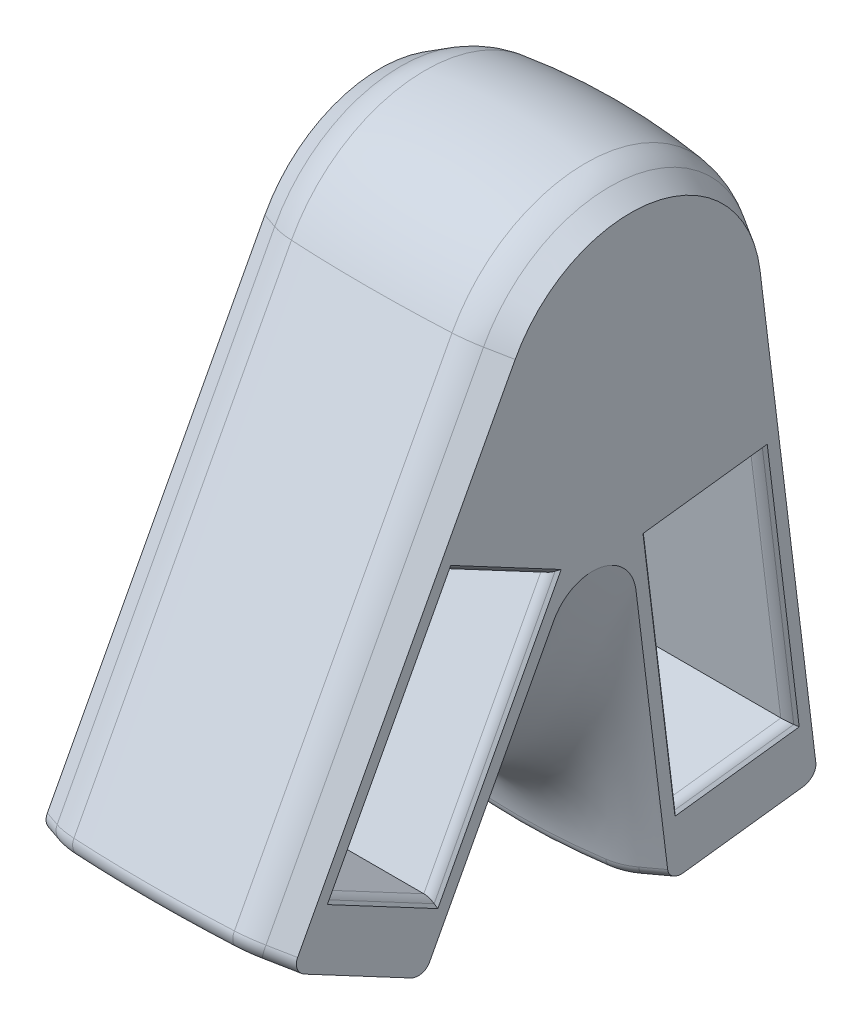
ISO-10303-21;
HEADER;
FILE_DESCRIPTION(('STEP AP214'),'2;1');
FILE_NAME('part.step','',(''),(''),'','','');
FILE_SCHEMA(('AUTOMOTIVE_DESIGN { 1 0 10303 214 1 1 1 1 }'));
ENDSEC;
DATA;
#1=APPLICATION_CONTEXT('core data for automotive mechanical design processes');
#2=APPLICATION_PROTOCOL_DEFINITION('international standard','automotive_design',2000,#1);
#3=PRODUCT_CONTEXT('',#1,'mechanical');
#4=PRODUCT('Part','Part','',(#3));
#5=PRODUCT_RELATED_PRODUCT_CATEGORY('part','',(#4));
#6=PRODUCT_DEFINITION_FORMATION('','',#4);
#7=PRODUCT_DEFINITION_CONTEXT('part definition',#1,'design');
#8=PRODUCT_DEFINITION('design','',#6,#7);
#9=PRODUCT_DEFINITION_SHAPE('','',#8);
#10=(LENGTH_UNIT() NAMED_UNIT(*) SI_UNIT(.MILLI.,.METRE.));
#11=(NAMED_UNIT(*) PLANE_ANGLE_UNIT() SI_UNIT($,.RADIAN.));
#12=(NAMED_UNIT(*) SI_UNIT($,.STERADIAN.) SOLID_ANGLE_UNIT());
#13=UNCERTAINTY_MEASURE_WITH_UNIT(LENGTH_MEASURE(1.E-05),#10,'distance_accuracy_value','');
#14=(GEOMETRIC_REPRESENTATION_CONTEXT(3) GLOBAL_UNCERTAINTY_ASSIGNED_CONTEXT((#13)) GLOBAL_UNIT_ASSIGNED_CONTEXT((#10,
#11,#12)) REPRESENTATION_CONTEXT('',''));
#15=CARTESIAN_POINT('',(0.,0.,0.));
#16=DIRECTION('',(0.,0.,1.));
#17=DIRECTION('',(1.,0.,0.));
#18=AXIS2_PLACEMENT_3D('',#15,#16,#17);
#19=CARTESIAN_POINT('',(562.823923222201,638.210169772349,-634.512188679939));
#20=DIRECTION('',(0.853358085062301,-0.0635335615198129,0.517439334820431));
#21=DIRECTION('',(0.518486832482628,0.,-0.855085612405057));
#22=AXIS2_PLACEMENT_3D('',#19,#20,#21);
#23=CYLINDRICAL_SURFACE('',#22,2.);
#24=CARTESIAN_POINT('',(563.913886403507,638.129020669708,-633.851282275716));
#25=DIRECTION('',(-0.853358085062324,0.0635335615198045,-0.517439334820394));
#26=DIRECTION('',(-0.518486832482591,0.,0.855085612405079));
#27=AXIS2_PLACEMENT_3D('',#24,#25,#26);
#28=CIRCLE('',#27,2.);
#29=CARTESIAN_POINT('',(563.913886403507,636.143928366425,-634.095020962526));
#30=VERTEX_POINT('',#29);
#31=CARTESIAN_POINT('',(562.871895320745,637.921156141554,-632.158361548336));
#32=VERTEX_POINT('',#31);
#33=EDGE_CURVE('E1211',#30,#32,#28,.T.);
#34=ORIENTED_EDGE('',*,*,#33,.T.);
#35=DIRECTION('',(-0.853358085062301,0.063533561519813,-0.517439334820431));
#36=VECTOR('',#35,1.);
#37=CARTESIAN_POINT('',(564.628055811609,637.790226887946,-631.092028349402));
#38=LINE('',#37,#36);
#39=CARTESIAN_POINT('',(560.,638.134791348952,-633.898280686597));
#40=VERTEX_POINT('',#39);
#41=EDGE_CURVE('E961',#32,#40,#38,.T.);
#42=ORIENTED_EDGE('',*,*,#41,.T.);
#43=CARTESIAN_POINT('',(560.,638.420414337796,-636.224493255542));
#44=DIRECTION('',(-1.,0.,0.));
#45=DIRECTION('',(0.,-0.121869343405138,0.992546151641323));
#46=AXIS2_PLACEMENT_3D('',#43,#44,#45);
#47=ELLIPSE('',#46,2.34368201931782,2.);
#48=CARTESIAN_POINT('',(560.,636.435322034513,-636.468231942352));
#49=VERTEX_POINT('',#48);
#50=EDGE_CURVE('E1120',#49,#40,#47,.T.);
#51=ORIENTED_EDGE('',*,*,#50,.F.);
#52=DIRECTION('',(0.853358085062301,-0.0635335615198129,0.517439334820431));
#53=VECTOR('',#52,1.);
#54=CARTESIAN_POINT('',(562.823923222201,636.225077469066,-634.75592736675));
#55=LINE('',#54,#53);
#56=EDGE_CURVE('E1138',#30,#49,#55,.F.);
#57=ORIENTED_EDGE('',*,*,#56,.F.);
#58=EDGE_LOOP('',(#34,#42,#51,#57));
#59=FACE_BOUND('',#58,.T.);
#60=ADVANCED_FACE('F40',(#59),#23,.T.);
#61=CARTESIAN_POINT('',(568.084488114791,638.961006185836,-640.62726054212));
#62=DIRECTION('',(0.,-0.992546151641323,-0.121869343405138));
#63=DIRECTION('',(0.,0.121869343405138,-0.992546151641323));
#64=AXIS2_PLACEMENT_3D('',#61,#62,#63);
#65=TOROIDAL_SURFACE('',#64,8.,2.);
#66=CARTESIAN_POINT('',(567.036970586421,637.994445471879,-632.755255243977));
#67=DIRECTION('',(-0.991390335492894,0.0159575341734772,-0.129963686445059));
#68=DIRECTION('',(-0.129980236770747,0.,0.991516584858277));
#69=AXIS2_PLACEMENT_3D('',#66,#67,#68);
#70=CIRCLE('',#69,2.);
#71=CARTESIAN_POINT('',(567.036970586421,636.009353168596,-632.998993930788));
#72=VERTEX_POINT('',#71);
#73=CARTESIAN_POINT('',(566.775473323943,637.753160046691,-630.790143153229));
#74=VERTEX_POINT('',#73);
#75=EDGE_CURVE('E1600',#72,#74,#70,.T.);
#76=ORIENTED_EDGE('',*,*,#75,.T.);
#77=CARTESIAN_POINT('',(568.084488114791,638.961006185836,-640.62726054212));
#78=DIRECTION('',(0.,-0.992546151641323,-0.121869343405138));
#79=DIRECTION('',(0.,0.121869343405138,-0.992546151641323));
#80=AXIS2_PLACEMENT_3D('',#77,#78,#79);
#81=CIRCLE('',#80,10.);
#82=EDGE_CURVE('E1221',#74,#32,#81,.T.);
#83=ORIENTED_EDGE('',*,*,#82,.T.);
#84=ORIENTED_EDGE('',*,*,#33,.F.);
#85=CARTESIAN_POINT('',(568.084488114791,636.975913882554,-640.870999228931));
#86=DIRECTION('',(0.,-0.992546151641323,-0.121869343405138));
#87=DIRECTION('',(0.,0.121869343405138,-0.992546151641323));
#88=AXIS2_PLACEMENT_3D('',#85,#86,#87);
#89=CIRCLE('',#88,8.);
#90=EDGE_CURVE('E1136',#72,#30,#89,.T.);
#91=ORIENTED_EDGE('',*,*,#90,.F.);
#92=EDGE_LOOP('',(#76,#83,#84,#91));
#93=FACE_BOUND('',#92,.T.);
#94=ADVANCED_FACE('F1582',(#93),#65,.T.);
#95=CARTESIAN_POINT('',(580.,649.955634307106,-730.171320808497));
#96=DIRECTION('',(0.,-0.992546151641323,-0.121869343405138));
#97=DIRECTION('',(0.,0.121869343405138,-0.992546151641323));
#98=AXIS2_PLACEMENT_3D('',#95,#96,#97);
#99=TOROIDAL_SURFACE('',#98,99.0000000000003,2.);
#100=CARTESIAN_POINT('',(592.96302941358,637.994445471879,-632.755255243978));
#101=DIRECTION('',(-0.991390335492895,-0.0159575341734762,0.129963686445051));
#102=DIRECTION('',(0.129980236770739,0.,0.991516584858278));
#103=AXIS2_PLACEMENT_3D('',#100,#101,#102);
#104=CIRCLE('',#103,2.);
#105=CARTESIAN_POINT('',(592.96302941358,636.009353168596,-632.998993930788));
#106=VERTEX_POINT('',#105);
#107=CARTESIAN_POINT('',(593.224526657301,637.753160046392,-630.790143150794));
#108=VERTEX_POINT('',#107);
#109=EDGE_CURVE('E1631',#106,#108,#104,.T.);
#110=ORIENTED_EDGE('',*,*,#109,.T.);
#111=CARTESIAN_POINT('',(580.,649.955634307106,-730.171320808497));
#112=DIRECTION('',(0.,-0.992546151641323,-0.121869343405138));
#113=DIRECTION('',(0.,0.121869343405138,-0.992546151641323));
#114=AXIS2_PLACEMENT_3D('',#111,#112,#113);
#115=CIRCLE('',#114,101.);
#116=EDGE_CURVE('E1223',#108,#74,#115,.T.);
#117=ORIENTED_EDGE('',*,*,#116,.T.);
#118=ORIENTED_EDGE('',*,*,#75,.F.);
#119=CARTESIAN_POINT('',(580.,647.970542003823,-730.415059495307));
#120=DIRECTION('',(0.,-0.992546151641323,-0.121869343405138));
#121=DIRECTION('',(0.,0.121869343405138,-0.992546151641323));
#122=AXIS2_PLACEMENT_3D('',#119,#120,#121);
#123=CIRCLE('',#122,99.0000000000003);
#124=EDGE_CURVE('E1130',#106,#72,#123,.T.);
#125=ORIENTED_EDGE('',*,*,#124,.F.);
#126=EDGE_LOOP('',(#110,#117,#118,#125));
#127=FACE_BOUND('',#126,.T.);
#128=ADVANCED_FACE('F1585',(#127),#99,.T.);
#129=CARTESIAN_POINT('',(591.91551188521,638.961006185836,-640.627260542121));
#130=DIRECTION('',(0.,-0.992546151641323,-0.121869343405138));
#131=DIRECTION('',(0.,0.121869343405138,-0.992546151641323));
#132=AXIS2_PLACEMENT_3D('',#129,#130,#131);
#133=TOROIDAL_SURFACE('',#132,8.,2.);
#134=CARTESIAN_POINT('',(596.086113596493,638.129020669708,-633.851282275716));
#135=DIRECTION('',(-0.853358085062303,-0.0635335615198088,0.517439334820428));
#136=DIRECTION('',(0.518486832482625,0.,0.855085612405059));
#137=AXIS2_PLACEMENT_3D('',#134,#135,#136);
#138=CIRCLE('',#137,2.);
#139=CARTESIAN_POINT('',(596.086113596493,636.143928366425,-634.095020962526));
#140=VERTEX_POINT('',#139);
#141=CARTESIAN_POINT('',(597.128104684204,637.921156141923,-632.158361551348));
#142=VERTEX_POINT('',#141);
#143=EDGE_CURVE('E626',#140,#142,#138,.T.);
#144=ORIENTED_EDGE('',*,*,#143,.T.);
#145=CARTESIAN_POINT('',(591.91551188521,638.961006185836,-640.627260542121));
#146=DIRECTION('',(0.,-0.992546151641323,-0.121869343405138));
#147=DIRECTION('',(0.,0.121869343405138,-0.992546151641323));
#148=AXIS2_PLACEMENT_3D('',#145,#146,#147);
#149=CIRCLE('',#148,10.);
#150=EDGE_CURVE('E1605',#142,#108,#149,.T.);
#151=ORIENTED_EDGE('',*,*,#150,.T.);
#152=ORIENTED_EDGE('',*,*,#109,.F.);
#153=CARTESIAN_POINT('',(591.91551188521,636.975913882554,-640.870999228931));
#154=DIRECTION('',(0.,-0.992546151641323,-0.121869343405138));
#155=DIRECTION('',(0.,0.121869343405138,-0.992546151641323));
#156=AXIS2_PLACEMENT_3D('',#153,#154,#155);
#157=CIRCLE('',#156,8.);
#158=EDGE_CURVE('E1132',#140,#106,#157,.T.);
#159=ORIENTED_EDGE('',*,*,#158,.F.);
#160=EDGE_LOOP('',(#144,#151,#152,#159));
#161=FACE_BOUND('',#160,.T.);
#162=ADVANCED_FACE('F639',(#161),#133,.T.);
#163=CARTESIAN_POINT('',(568.047275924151,636.041494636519,-616.849747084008));
#164=DIRECTION('',(0.8533580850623,0.0635335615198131,-0.517439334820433));
#165=DIRECTION('',(-0.51848683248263,0.,-0.855085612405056));
#166=AXIS2_PLACEMENT_3D('',#163,#164,#165);
#167=CYLINDRICAL_SURFACE('',#166,2.);
#168=CARTESIAN_POINT('',(600.,638.420414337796,-636.224493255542));
#169=DIRECTION('',(-1.,0.,0.));
#170=DIRECTION('',(0.,0.121869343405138,-0.992546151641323));
#171=AXIS2_PLACEMENT_3D('',#168,#169,#170);
#172=ELLIPSE('',#171,2.34368201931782,2.);
#173=CARTESIAN_POINT('',(600.,638.134791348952,-633.898280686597));
#174=VERTEX_POINT('',#173);
#175=CARTESIAN_POINT('',(600.,636.435322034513,-636.468231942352));
#176=VERTEX_POINT('',#175);
#177=EDGE_CURVE('E899',#174,#176,#172,.F.);
#178=ORIENTED_EDGE('',*,*,#177,.F.);
#179=DIRECTION('',(-0.8533580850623,-0.0635335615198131,0.517439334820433));
#180=VECTOR('',#179,1.);
#181=CARTESIAN_POINT('',(600.,638.134791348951,-633.898280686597));
#182=LINE('',#181,#180);
#183=EDGE_CURVE('E621',#174,#142,#182,.T.);
#184=ORIENTED_EDGE('',*,*,#183,.T.);
#185=ORIENTED_EDGE('',*,*,#143,.F.);
#186=DIRECTION('',(0.8533580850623,0.0635335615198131,-0.517439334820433));
#187=VECTOR('',#186,1.);
#188=CARTESIAN_POINT('',(568.047275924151,634.056402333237,-617.093485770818));
#189=LINE('',#188,#187);
#190=EDGE_CURVE('E1134',#176,#140,#189,.F.);
#191=ORIENTED_EDGE('',*,*,#190,.F.);
#192=EDGE_LOOP('',(#178,#184,#185,#191));
#193=FACE_BOUND('',#192,.T.);
#194=ADVANCED_FACE('F628',(#193),#167,.T.);
#195=CARTESIAN_POINT('',(581.776146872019,642.086566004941,-666.082902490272));
#196=DIRECTION('',(-0.858344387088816,0.0625279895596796,-0.509249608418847));
#197=DIRECTION('',(-0.510248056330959,0.,0.860027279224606));
#198=AXIS2_PLACEMENT_3D('',#195,#196,#197);
#199=CYLINDRICAL_SURFACE('',#198,2.);
#200=CARTESIAN_POINT('',(595.662409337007,641.07499059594,-657.844281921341));
#201=DIRECTION('',(0.858344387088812,-0.0625279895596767,0.509249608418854));
#202=DIRECTION('',(0.510248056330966,0.,-0.860027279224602));
#203=AXIS2_PLACEMENT_3D('',#200,#201,#202);
#204=CIRCLE('',#203,2.);
#205=CARTESIAN_POINT('',(595.662409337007,639.089898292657,-658.088020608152));
#206=VERTEX_POINT('',#205);
#207=CARTESIAN_POINT('',(596.688557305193,641.28420232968,-659.548174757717));
#208=VERTEX_POINT('',#207);
#209=EDGE_CURVE('E1176',#206,#208,#204,.T.);
#210=ORIENTED_EDGE('',*,*,#209,.T.);
#211=DIRECTION('',(0.858344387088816,-0.0625279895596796,0.509249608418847));
#212=VECTOR('',#211,1.);
#213=CARTESIAN_POINT('',(600.,641.042972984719,-657.583519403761));
#214=LINE('',#213,#212);
#215=CARTESIAN_POINT('',(600.,641.042972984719,-657.583519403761));
#216=VERTEX_POINT('',#215);
#217=EDGE_CURVE('E1152',#216,#208,#214,.F.);
#218=ORIENTED_EDGE('',*,*,#217,.F.);
#219=CARTESIAN_POINT('',(600.,640.759009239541,-655.270820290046));
#220=DIRECTION('',(-1.,0.,0.));
#221=DIRECTION('',(0.,0.121869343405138,-0.992546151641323));
#222=AXIS2_PLACEMENT_3D('',#219,#220,#221);
#223=ELLIPSE('',#222,2.33006708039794,2.);
#224=CARTESIAN_POINT('',(600.,638.773916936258,-655.514558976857));
#225=VERTEX_POINT('',#224);
#226=EDGE_CURVE('E566',#225,#216,#223,.F.);
#227=ORIENTED_EDGE('',*,*,#226,.F.);
#228=DIRECTION('',(-0.858344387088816,0.0625279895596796,-0.509249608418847));
#229=VECTOR('',#228,1.);
#230=CARTESIAN_POINT('',(581.776146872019,640.101473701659,-666.326641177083));
#231=LINE('',#230,#229);
#232=EDGE_CURVE('E1149',#206,#225,#231,.F.);
#233=ORIENTED_EDGE('',*,*,#232,.F.);
#234=EDGE_LOOP('',(#210,#218,#227,#233));
#235=FACE_BOUND('',#234,.T.);
#236=ADVANCED_FACE('F638',(#235),#199,.T.);
#237=CARTESIAN_POINT('',(591.557817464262,640.23814366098,-651.028710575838));
#238=DIRECTION('',(0.,-0.992546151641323,-0.121869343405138));
#239=DIRECTION('',(0.,0.121869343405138,-0.992546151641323));
#240=AXIS2_PLACEMENT_3D('',#237,#238,#239);
#241=TOROIDAL_SURFACE('',#240,8.,2.);
#242=CARTESIAN_POINT('',(592.573889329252,641.20520280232,-658.904775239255));
#243=DIRECTION('',(0.991901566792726,-0.0154785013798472,0.126062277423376));
#244=DIRECTION('',(0.126077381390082,0.,-0.992020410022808));
#245=AXIS2_PLACEMENT_3D('',#242,#243,#244);
#246=CIRCLE('',#245,2.);
#247=CARTESIAN_POINT('',(592.573889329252,639.220110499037,-659.148513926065));
#248=VERTEX_POINT('',#247);
#249=CARTESIAN_POINT('',(592.8279072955,641.446967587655,-660.873791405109));
#250=VERTEX_POINT('',#249);
#251=EDGE_CURVE('E1179',#248,#250,#246,.T.);
#252=ORIENTED_EDGE('',*,*,#251,.T.);
#253=CARTESIAN_POINT('',(591.557817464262,640.23814366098,-651.028710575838));
#254=DIRECTION('',(0.,-0.992546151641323,-0.121869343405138));
#255=DIRECTION('',(0.,0.121869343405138,-0.992546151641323));
#256=AXIS2_PLACEMENT_3D('',#253,#254,#255);
#257=CIRCLE('',#256,10.);
#258=EDGE_CURVE('E1154',#208,#250,#257,.F.);
#259=ORIENTED_EDGE('',*,*,#258,.F.);
#260=ORIENTED_EDGE('',*,*,#209,.F.);
#261=CARTESIAN_POINT('',(591.557817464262,638.253051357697,-651.272449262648));
#262=DIRECTION('',(0.,-0.992546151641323,-0.121869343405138));
#263=DIRECTION('',(0.,0.121869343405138,-0.992546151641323));
#264=AXIS2_PLACEMENT_3D('',#261,#262,#263);
#265=CIRCLE('',#264,8.);
#266=EDGE_CURVE('E1147',#248,#206,#265,.T.);
#267=ORIENTED_EDGE('',*,*,#266,.F.);
#268=EDGE_LOOP('',(#252,#259,#260,#267));
#269=FACE_BOUND('',#268,.T.);
#270=ADVANCED_FACE('F1568',(#269),#241,.T.);
#271=CARTESIAN_POINT('',(580.,629.237845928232,-561.43847502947));
#272=DIRECTION('',(0.,-0.992546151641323,-0.121869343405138));
#273=DIRECTION('',(0.,0.121869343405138,-0.992546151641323));
#274=AXIS2_PLACEMENT_3D('',#271,#272,#273);
#275=TOROIDAL_SURFACE('',#274,98.9999999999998,2.);
#276=CARTESIAN_POINT('',(567.426110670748,641.20520280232,-658.904775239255));
#277=DIRECTION('',(0.991901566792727,0.0154785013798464,-0.126062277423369));
#278=DIRECTION('',(-0.126077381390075,0.,-0.992020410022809));
#279=AXIS2_PLACEMENT_3D('',#276,#277,#278);
#280=CIRCLE('',#279,2.);
#281=CARTESIAN_POINT('',(567.426110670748,639.220110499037,-659.148513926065));
#282=VERTEX_POINT('',#281);
#283=CARTESIAN_POINT('',(567.1720927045,641.446967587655,-660.873791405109));
#284=VERTEX_POINT('',#283);
#285=EDGE_CURVE('E1181',#282,#284,#280,.T.);
#286=ORIENTED_EDGE('',*,*,#285,.T.);
#287=CARTESIAN_POINT('',(580.,629.237845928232,-561.43847502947));
#288=DIRECTION('',(0.,-0.992546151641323,-0.121869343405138));
#289=DIRECTION('',(0.,0.121869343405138,-0.992546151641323));
#290=AXIS2_PLACEMENT_3D('',#287,#288,#289);
#291=CIRCLE('',#290,101.);
#292=EDGE_CURVE('E1162',#250,#284,#291,.F.);
#293=ORIENTED_EDGE('',*,*,#292,.F.);
#294=ORIENTED_EDGE('',*,*,#251,.F.);
#295=CARTESIAN_POINT('',(580.,627.252753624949,-561.68221371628));
#296=DIRECTION('',(0.,-0.992546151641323,-0.121869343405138));
#297=DIRECTION('',(0.,0.121869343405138,-0.992546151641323));
#298=AXIS2_PLACEMENT_3D('',#295,#296,#297);
#299=CIRCLE('',#298,98.9999999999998);
#300=EDGE_CURVE('E1141',#282,#248,#299,.T.);
#301=ORIENTED_EDGE('',*,*,#300,.F.);
#302=EDGE_LOOP('',(#286,#293,#294,#301));
#303=FACE_BOUND('',#302,.T.);
#304=ADVANCED_FACE('F1572',(#303),#275,.T.);
#305=CARTESIAN_POINT('',(568.442182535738,640.23814366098,-651.028710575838));
#306=DIRECTION('',(0.,-0.992546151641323,-0.121869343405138));
#307=DIRECTION('',(0.,0.121869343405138,-0.992546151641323));
#308=AXIS2_PLACEMENT_3D('',#305,#306,#307);
#309=TOROIDAL_SURFACE('',#308,8.,2.);
#310=CARTESIAN_POINT('',(564.337590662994,641.07499059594,-657.844281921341));
#311=DIRECTION('',(0.85834438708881,0.062527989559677,-0.509249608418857));
#312=DIRECTION('',(-0.510248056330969,0.,-0.8600272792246));
#313=AXIS2_PLACEMENT_3D('',#310,#311,#312);
#314=CIRCLE('',#313,2.);
#315=CARTESIAN_POINT('',(564.337590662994,639.089898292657,-658.088020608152));
#316=VERTEX_POINT('',#315);
#317=CARTESIAN_POINT('',(563.311442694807,641.28420232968,-659.548174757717));
#318=VERTEX_POINT('',#317);
#319=EDGE_CURVE('E570',#316,#318,#314,.T.);
#320=ORIENTED_EDGE('',*,*,#319,.T.);
#321=CARTESIAN_POINT('',(568.442182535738,640.23814366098,-651.028710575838));
#322=DIRECTION('',(0.,-0.992546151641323,-0.121869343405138));
#323=DIRECTION('',(0.,0.121869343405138,-0.992546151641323));
#324=AXIS2_PLACEMENT_3D('',#321,#322,#323);
#325=CIRCLE('',#324,10.);
#326=EDGE_CURVE('E1158',#284,#318,#325,.F.);
#327=ORIENTED_EDGE('',*,*,#326,.F.);
#328=ORIENTED_EDGE('',*,*,#285,.F.);
#329=CARTESIAN_POINT('',(568.442182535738,638.253051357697,-651.272449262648));
#330=DIRECTION('',(0.,-0.992546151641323,-0.121869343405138));
#331=DIRECTION('',(0.,0.121869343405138,-0.992546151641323));
#332=AXIS2_PLACEMENT_3D('',#329,#330,#331);
#333=CIRCLE('',#332,8.);
#334=EDGE_CURVE('E1143',#316,#282,#333,.T.);
#335=ORIENTED_EDGE('',*,*,#334,.F.);
#336=EDGE_LOOP('',(#320,#327,#328,#335));
#337=FACE_BOUND('',#336,.T.);
#338=ADVANCED_FACE('F1192',(#337),#309,.T.);
#339=CARTESIAN_POINT('',(548.753649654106,639.939744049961,-648.598440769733));
#340=DIRECTION('',(-0.858344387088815,-0.0625279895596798,0.509249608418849));
#341=DIRECTION('',(0.510248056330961,0.,0.860027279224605));
#342=AXIS2_PLACEMENT_3D('',#339,#340,#341);
#343=CYLINDRICAL_SURFACE('',#342,2.);
#344=CARTESIAN_POINT('',(560.,640.759009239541,-655.270820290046));
#345=DIRECTION('',(-1.,0.,0.));
#346=DIRECTION('',(0.,-0.121869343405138,0.992546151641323));
#347=AXIS2_PLACEMENT_3D('',#344,#345,#346);
#348=ELLIPSE('',#347,2.33006708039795,2.);
#349=CARTESIAN_POINT('',(560.,641.042972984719,-657.583519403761));
#350=VERTEX_POINT('',#349);
#351=CARTESIAN_POINT('',(560.,638.773916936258,-655.514558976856));
#352=VERTEX_POINT('',#351);
#353=EDGE_CURVE('E1121',#350,#352,#348,.T.);
#354=ORIENTED_EDGE('',*,*,#353,.F.);
#355=DIRECTION('',(0.858344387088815,0.0625279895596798,-0.509249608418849));
#356=VECTOR('',#355,1.);
#357=CARTESIAN_POINT('',(565.053833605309,641.411130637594,-660.581922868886));
#358=LINE('',#357,#356);
#359=EDGE_CURVE('E1156',#318,#350,#358,.F.);
#360=ORIENTED_EDGE('',*,*,#359,.F.);
#361=ORIENTED_EDGE('',*,*,#319,.F.);
#362=DIRECTION('',(-0.858344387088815,-0.0625279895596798,0.509249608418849));
#363=VECTOR('',#362,1.);
#364=CARTESIAN_POINT('',(548.753649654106,637.954651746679,-648.842179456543));
#365=LINE('',#364,#363);
#366=EDGE_CURVE('E1145',#352,#316,#365,.F.);
#367=ORIENTED_EDGE('',*,*,#366,.F.);
#368=EDGE_LOOP('',(#354,#360,#361,#367));
#369=FACE_BOUND('',#368,.T.);
#370=ADVANCED_FACE('F1197',(#369),#343,.T.);
#371=CARTESIAN_POINT('',(548.753649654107,651.282056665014,-582.756398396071));
#372=DIRECTION('',(0.858344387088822,0.240873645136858,0.453017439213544));
#373=DIRECTION('',(0.466760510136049,0.,-0.884383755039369));
#374=AXIS2_PLACEMENT_3D('',#371,#372,#373);
#375=CYLINDRICAL_SURFACE('',#374,2.);
#376=CARTESIAN_POINT('',(564.337590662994,655.65531375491,-574.531498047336));
#377=DIRECTION('',(-0.858344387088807,-0.240873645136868,-0.453017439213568));
#378=DIRECTION('',(-0.466760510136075,0.,0.884383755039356));
#379=AXIS2_PLACEMENT_3D('',#376,#377,#378);
#380=CIRCLE('',#379,2.);
#381=CARTESIAN_POINT('',(564.337590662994,653.889418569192,-573.592554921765));
#382=VERTEX_POINT('',#381);
#383=CARTESIAN_POINT('',(563.311442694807,656.46125031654,-573.015751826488));
#384=VERTEX_POINT('',#383);
#385=EDGE_CURVE('E1165',#382,#384,#380,.T.);
#386=ORIENTED_EDGE('',*,*,#385,.T.);
#387=DIRECTION('',(-0.858344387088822,-0.240873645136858,-0.453017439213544));
#388=VECTOR('',#387,1.);
#389=CARTESIAN_POINT('',(565.053833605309,656.950210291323,-572.096151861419));
#390=LINE('',#389,#388);
#391=CARTESIAN_POINT('',(560.,655.531973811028,-574.763466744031));
#392=VERTEX_POINT('',#391);
#393=EDGE_CURVE('E562',#392,#384,#390,.F.);
#394=ORIENTED_EDGE('',*,*,#393,.F.);
#395=CARTESIAN_POINT('',(560.,654.438073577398,-576.820793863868));
#396=DIRECTION('',(-1.,0.,0.));
#397=DIRECTION('',(0.,0.469471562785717,0.882947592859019));
#398=AXIS2_PLACEMENT_3D('',#395,#396,#397);
#399=ELLIPSE('',#398,2.33006708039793,2.);
#400=CARTESIAN_POINT('',(560.,652.67217839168,-575.881850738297));
#401=VERTEX_POINT('',#400);
#402=EDGE_CURVE('E415',#401,#392,#399,.T.);
#403=ORIENTED_EDGE('',*,*,#402,.F.);
#404=DIRECTION('',(0.858344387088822,0.240873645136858,0.453017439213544));
#405=VECTOR('',#404,1.);
#406=CARTESIAN_POINT('',(548.753649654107,649.516161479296,-581.817455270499));
#407=LINE('',#406,#405);
#408=EDGE_CURVE('E1107',#382,#401,#407,.F.);
#409=ORIENTED_EDGE('',*,*,#408,.F.);
#410=EDGE_LOOP('',(#386,#394,#403,#409));
#411=FACE_BOUND('',#410,.T.);
#412=ADVANCED_FACE('F1004',(#411),#375,.T.);
#413=CARTESIAN_POINT('',(568.442182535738,652.431567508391,-580.594482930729));
#414=DIRECTION('',(0.,-0.882947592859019,0.469471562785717));
#415=DIRECTION('',(0.,-0.469471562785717,-0.882947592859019));
#416=AXIS2_PLACEMENT_3D('',#413,#414,#415);
#417=TOROIDAL_SURFACE('',#416,8.,2.);
#418=CARTESIAN_POINT('',(567.426110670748,656.156924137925,-573.588106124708));
#419=DIRECTION('',(-0.991901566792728,-0.0596271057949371,-0.112142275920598));
#420=DIRECTION('',(-0.112342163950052,0.,0.993669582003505));
#421=AXIS2_PLACEMENT_3D('',#418,#419,#420);
#422=CIRCLE('',#421,2.);
#423=CARTESIAN_POINT('',(567.426110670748,654.391028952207,-572.649162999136));
#424=VERTEX_POINT('',#423);
#425=CARTESIAN_POINT('',(567.1720927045,657.088263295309,-571.836511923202));
#426=VERTEX_POINT('',#425);
#427=EDGE_CURVE('E1168',#424,#426,#422,.T.);
#428=ORIENTED_EDGE('',*,*,#427,.T.);
#429=CARTESIAN_POINT('',(568.442182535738,652.431567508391,-580.594482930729));
#430=DIRECTION('',(0.,-0.882947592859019,0.469471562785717));
#431=DIRECTION('',(0.,-0.469471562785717,-0.882947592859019));
#432=AXIS2_PLACEMENT_3D('',#429,#430,#431);
#433=CIRCLE('',#432,10.);
#434=EDGE_CURVE('E564',#384,#426,#433,.F.);
#435=ORIENTED_EDGE('',*,*,#434,.F.);
#436=ORIENTED_EDGE('',*,*,#385,.F.);
#437=CARTESIAN_POINT('',(568.442182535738,650.665672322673,-579.655539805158));
#438=DIRECTION('',(0.,-0.882947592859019,0.469471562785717));
#439=DIRECTION('',(0.,-0.469471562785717,-0.882947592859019));
#440=AXIS2_PLACEMENT_3D('',#437,#438,#439);
#441=CIRCLE('',#440,8.);
#442=EDGE_CURVE('E1105',#424,#382,#441,.T.);
#443=ORIENTED_EDGE('',*,*,#442,.F.);
#444=EDGE_LOOP('',(#428,#435,#436,#443));
#445=FACE_BOUND('',#444,.T.);
#446=ADVANCED_FACE('F1541',(#445),#417,.T.);
#447=CARTESIAN_POINT('',(580.,610.055635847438,-660.292019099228));
#448=DIRECTION('',(0.,-0.882947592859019,0.469471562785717));
#449=DIRECTION('',(0.,-0.469471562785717,-0.882947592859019));
#450=AXIS2_PLACEMENT_3D('',#447,#448,#449);
#451=TOROIDAL_SURFACE('',#450,98.9999999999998,2.);
#452=CARTESIAN_POINT('',(592.573889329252,656.156924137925,-573.588106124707));
#453=DIRECTION('',(-0.991901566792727,0.05962710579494,0.112142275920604));
#454=DIRECTION('',(0.112342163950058,0.,0.993669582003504));
#455=AXIS2_PLACEMENT_3D('',#452,#453,#454);
#456=CIRCLE('',#455,2.);
#457=CARTESIAN_POINT('',(592.573889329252,654.391028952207,-572.649162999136));
#458=VERTEX_POINT('',#457);
#459=CARTESIAN_POINT('',(592.827907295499,657.088263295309,-571.836511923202));
#460=VERTEX_POINT('',#459);
#461=EDGE_CURVE('E1171',#458,#460,#456,.T.);
#462=ORIENTED_EDGE('',*,*,#461,.T.);
#463=CARTESIAN_POINT('',(580.,610.055635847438,-660.292019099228));
#464=DIRECTION('',(0.,-0.882947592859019,0.469471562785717));
#465=DIRECTION('',(0.,-0.469471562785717,-0.882947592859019));
#466=AXIS2_PLACEMENT_3D('',#463,#464,#465);
#467=CIRCLE('',#466,101.);
#468=EDGE_CURVE('E1160',#426,#460,#467,.F.);
#469=ORIENTED_EDGE('',*,*,#468,.F.);
#470=ORIENTED_EDGE('',*,*,#427,.F.);
#471=CARTESIAN_POINT('',(580.,608.28974066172,-659.353075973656));
#472=DIRECTION('',(0.,-0.882947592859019,0.469471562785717));
#473=DIRECTION('',(0.,-0.469471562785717,-0.882947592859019));
#474=AXIS2_PLACEMENT_3D('',#471,#472,#473);
#475=CIRCLE('',#474,98.9999999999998);
#476=EDGE_CURVE('E1089',#458,#424,#475,.T.);
#477=ORIENTED_EDGE('',*,*,#476,.F.);
#478=EDGE_LOOP('',(#462,#469,#470,#477));
#479=FACE_BOUND('',#478,.T.);
#480=ADVANCED_FACE('F1535',(#479),#451,.T.);
#481=CARTESIAN_POINT('',(591.557817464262,652.431567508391,-580.594482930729));
#482=DIRECTION('',(0.,-0.882947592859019,0.469471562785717));
#483=DIRECTION('',(0.,-0.469471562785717,-0.882947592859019));
#484=AXIS2_PLACEMENT_3D('',#481,#482,#483);
#485=TOROIDAL_SURFACE('',#484,8.,2.);
#486=CARTESIAN_POINT('',(595.662409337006,655.65531375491,-574.531498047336));
#487=DIRECTION('',(-0.858344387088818,0.240873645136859,0.453017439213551));
#488=DIRECTION('',(0.466760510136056,0.,0.884383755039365));
#489=AXIS2_PLACEMENT_3D('',#486,#487,#488);
#490=CIRCLE('',#489,2.);
#491=CARTESIAN_POINT('',(595.662409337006,653.889418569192,-573.592554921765));
#492=VERTEX_POINT('',#491);
#493=CARTESIAN_POINT('',(596.688557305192,656.46125031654,-573.015751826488));
#494=VERTEX_POINT('',#493);
#495=EDGE_CURVE('E943',#492,#494,#490,.T.);
#496=ORIENTED_EDGE('',*,*,#495,.T.);
#497=CARTESIAN_POINT('',(591.557817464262,652.431567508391,-580.594482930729));
#498=DIRECTION('',(0.,-0.882947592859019,0.469471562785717));
#499=DIRECTION('',(0.,-0.469471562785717,-0.882947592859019));
#500=AXIS2_PLACEMENT_3D('',#497,#498,#499);
#501=CIRCLE('',#500,10.);
#502=EDGE_CURVE('E1128',#460,#494,#501,.F.);
#503=ORIENTED_EDGE('',*,*,#502,.F.);
#504=ORIENTED_EDGE('',*,*,#461,.F.);
#505=CARTESIAN_POINT('',(591.557817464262,650.665672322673,-579.655539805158));
#506=DIRECTION('',(0.,-0.882947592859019,0.469471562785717));
#507=DIRECTION('',(0.,-0.469471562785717,-0.882947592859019));
#508=AXIS2_PLACEMENT_3D('',#505,#506,#507);
#509=CIRCLE('',#508,8.);
#510=EDGE_CURVE('E1101',#492,#458,#509,.T.);
#511=ORIENTED_EDGE('',*,*,#510,.F.);
#512=EDGE_LOOP('',(#496,#503,#504,#511));
#513=FACE_BOUND('',#512,.T.);
#514=ADVANCED_FACE('F1548',(#513),#485,.T.);
#515=CARTESIAN_POINT('',(581.776146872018,659.552158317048,-567.202599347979));
#516=DIRECTION('',(0.858344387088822,-0.240873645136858,-0.453017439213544));
#517=DIRECTION('',(-0.466760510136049,0.,-0.884383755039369));
#518=AXIS2_PLACEMENT_3D('',#515,#516,#517);
#519=CYLINDRICAL_SURFACE('',#518,2.);
#520=CARTESIAN_POINT('',(600.,654.438073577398,-576.820793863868));
#521=DIRECTION('',(-1.,0.,0.));
#522=DIRECTION('',(0.,-0.469471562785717,-0.882947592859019));
#523=AXIS2_PLACEMENT_3D('',#520,#521,#522);
#524=ELLIPSE('',#523,2.33006708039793,2.);
#525=CARTESIAN_POINT('',(600.,655.531973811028,-574.763466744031));
#526=VERTEX_POINT('',#525);
#527=CARTESIAN_POINT('',(600.,652.67217839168,-575.881850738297));
#528=VERTEX_POINT('',#527);
#529=EDGE_CURVE('E551',#526,#528,#524,.F.);
#530=ORIENTED_EDGE('',*,*,#529,.F.);
#531=DIRECTION('',(-0.858344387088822,0.240873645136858,0.453017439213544));
#532=VECTOR('',#531,1.);
#533=CARTESIAN_POINT('',(600.,655.531973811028,-574.763466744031));
#534=LINE('',#533,#532);
#535=EDGE_CURVE('E1126',#494,#526,#534,.F.);
#536=ORIENTED_EDGE('',*,*,#535,.F.);
#537=ORIENTED_EDGE('',*,*,#495,.F.);
#538=DIRECTION('',(0.858344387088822,-0.240873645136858,-0.453017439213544));
#539=VECTOR('',#538,1.);
#540=CARTESIAN_POINT('',(581.776146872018,657.78626313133,-566.263656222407));
#541=LINE('',#540,#539);
#542=EDGE_CURVE('E1103',#528,#492,#541,.F.);
#543=ORIENTED_EDGE('',*,*,#542,.F.);
#544=EDGE_LOOP('',(#530,#536,#537,#543));
#545=FACE_BOUND('',#544,.T.);
#546=ADVANCED_FACE('F917',(#545),#519,.T.);
#547=CARTESIAN_POINT('',(562.823923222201,644.619298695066,-595.287223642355));
#548=DIRECTION('',(-0.853358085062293,0.244747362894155,0.460302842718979));
#549=DIRECTION('',(0.4747412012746,0.,0.880125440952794));
#550=AXIS2_PLACEMENT_3D('',#547,#548,#549);
#551=CYLINDRICAL_SURFACE('',#550,2.);
#552=CARTESIAN_POINT('',(560.,645.429213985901,-593.763994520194));
#553=DIRECTION('',(-1.,0.,0.));
#554=DIRECTION('',(0.,0.469471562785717,0.882947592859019));
#555=AXIS2_PLACEMENT_3D('',#552,#553,#554);
#556=ELLIPSE('',#555,2.34368201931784,2.);
#557=CARTESIAN_POINT('',(560.,644.328921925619,-595.833342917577));
#558=VERTEX_POINT('',#557);
#559=CARTESIAN_POINT('',(560.,643.663318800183,-592.825051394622));
#560=VERTEX_POINT('',#559);
#561=EDGE_CURVE('E897',#558,#560,#556,.T.);
#562=ORIENTED_EDGE('',*,*,#561,.F.);
#563=DIRECTION('',(-0.853358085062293,0.244747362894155,0.460302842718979));
#564=VECTOR('',#563,1.);
#565=CARTESIAN_POINT('',(560.000000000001,644.328921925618,-595.833342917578));
#566=LINE('',#565,#564);
#567=CARTESIAN_POINT('',(562.871235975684,643.505437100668,-597.382092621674));
#568=VERTEX_POINT('',#567);
#569=EDGE_CURVE('E484',#568,#558,#566,.T.);
#570=ORIENTED_EDGE('',*,*,#569,.F.);
#571=CARTESIAN_POINT('',(563.913886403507,644.30669180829,-595.875151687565));
#572=DIRECTION('',(-0.853358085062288,0.244747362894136,0.460302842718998));
#573=DIRECTION('',(0.474741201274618,0.,0.880125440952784));
#574=AXIS2_PLACEMENT_3D('',#571,#572,#573);
#575=CIRCLE('',#574,2.);
#576=CARTESIAN_POINT('',(563.913886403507,642.540796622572,-594.936208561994));
#577=VERTEX_POINT('',#576);
#578=EDGE_CURVE('E935',#568,#577,#575,.T.);
#579=ORIENTED_EDGE('',*,*,#578,.T.);
#580=DIRECTION('',(-0.853358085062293,0.244747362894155,0.460302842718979));
#581=VECTOR('',#580,1.);
#582=CARTESIAN_POINT('',(562.823923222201,642.853403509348,-594.348280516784));
#583=LINE('',#582,#581);
#584=EDGE_CURVE('E1117',#560,#577,#583,.F.);
#585=ORIENTED_EDGE('',*,*,#584,.F.);
#586=EDGE_LOOP('',(#562,#570,#579,#585));
#587=FACE_BOUND('',#586,.T.);
#588=ADVANCED_FACE('F906',(#587),#551,.T.);
#589=CARTESIAN_POINT('',(568.084488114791,647.51171063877,-589.847387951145));
#590=DIRECTION('',(0.,-0.882947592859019,0.469471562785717));
#591=DIRECTION('',(0.,-0.469471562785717,-0.882947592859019));
#592=AXIS2_PLACEMENT_3D('',#589,#590,#591);
#593=TOROIDAL_SURFACE('',#592,8.,2.);
#594=CARTESIAN_POINT('',(567.036970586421,643.788274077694,-596.850153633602));
#595=DIRECTION('',(-0.991390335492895,0.0614724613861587,0.115612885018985));
#596=DIRECTION('',(0.115831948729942,0.,0.993268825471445));
#597=AXIS2_PLACEMENT_3D('',#594,#595,#596);
#598=CIRCLE('',#597,2.);
#599=CARTESIAN_POINT('',(566.775091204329,642.857414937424,-598.600845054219));
#600=VERTEX_POINT('',#599);
#601=CARTESIAN_POINT('',(567.036970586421,642.022378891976,-595.911210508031));
#602=VERTEX_POINT('',#601);
#603=EDGE_CURVE('E942',#600,#602,#598,.T.);
#604=ORIENTED_EDGE('',*,*,#603,.T.);
#605=CARTESIAN_POINT('',(568.084488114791,645.745815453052,-588.908444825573));
#606=DIRECTION('',(0.,-0.882947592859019,0.469471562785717));
#607=DIRECTION('',(0.,-0.469471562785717,-0.882947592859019));
#608=AXIS2_PLACEMENT_3D('',#605,#606,#607);
#609=CIRCLE('',#608,8.);
#610=EDGE_CURVE('E1115',#577,#602,#609,.T.);
#611=ORIENTED_EDGE('',*,*,#610,.F.);
#612=ORIENTED_EDGE('',*,*,#578,.F.);
#613=CARTESIAN_POINT('',(568.084488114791,647.51171063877,-589.847387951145));
#614=DIRECTION('',(0.,0.882947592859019,-0.469471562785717));
#615=DIRECTION('',(0.,-0.469471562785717,-0.882947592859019));
#616=AXIS2_PLACEMENT_3D('',#613,#614,#615);
#617=CIRCLE('',#616,10.);
#618=EDGE_CURVE('E493',#600,#568,#617,.T.);
#619=ORIENTED_EDGE('',*,*,#618,.F.);
#620=EDGE_LOOP('',(#604,#611,#612,#619));
#621=FACE_BOUND('',#620,.T.);
#622=ADVANCED_FACE('F916',(#621),#593,.T.);
#623=CARTESIAN_POINT('',(580.,689.86580152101,-510.190928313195));
#624=DIRECTION('',(0.,-0.882947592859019,0.469471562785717));
#625=DIRECTION('',(0.,-0.469471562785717,-0.882947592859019));
#626=AXIS2_PLACEMENT_3D('',#623,#624,#625);
#627=TOROIDAL_SURFACE('',#626,98.9999999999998,2.);
#628=CARTESIAN_POINT('',(592.96302941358,643.788274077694,-596.850153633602));
#629=DIRECTION('',(-0.991390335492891,-0.0614724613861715,-0.115612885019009));
#630=DIRECTION('',(-0.115831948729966,0.,0.993268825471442));
#631=AXIS2_PLACEMENT_3D('',#628,#629,#630);
#632=CIRCLE('',#631,2.);
#633=CARTESIAN_POINT('',(593.224908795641,642.857414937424,-598.600845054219));
#634=VERTEX_POINT('',#633);
#635=CARTESIAN_POINT('',(592.96302941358,642.022378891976,-595.91121050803));
#636=VERTEX_POINT('',#635);
#637=EDGE_CURVE('E969',#634,#636,#632,.T.);
#638=ORIENTED_EDGE('',*,*,#637,.T.);
#639=CARTESIAN_POINT('',(580.,688.099906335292,-509.251985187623));
#640=DIRECTION('',(0.,-0.882947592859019,0.469471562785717));
#641=DIRECTION('',(0.,-0.469471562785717,-0.882947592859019));
#642=AXIS2_PLACEMENT_3D('',#639,#640,#641);
#643=CIRCLE('',#642,98.9999999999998);
#644=EDGE_CURVE('E1110',#602,#636,#643,.T.);
#645=ORIENTED_EDGE('',*,*,#644,.F.);
#646=ORIENTED_EDGE('',*,*,#603,.F.);
#647=CARTESIAN_POINT('',(580.,689.86580152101,-510.190928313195));
#648=DIRECTION('',(0.,-0.882947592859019,0.469471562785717));
#649=DIRECTION('',(0.,-0.469471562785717,-0.882947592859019));
#650=AXIS2_PLACEMENT_3D('',#647,#648,#649);
#651=CIRCLE('',#650,101.);
#652=EDGE_CURVE('E894',#634,#600,#651,.F.);
#653=ORIENTED_EDGE('',*,*,#652,.F.);
#654=EDGE_LOOP('',(#638,#645,#646,#653));
#655=FACE_BOUND('',#654,.T.);
#656=ADVANCED_FACE('F924',(#655),#627,.T.);
#657=CARTESIAN_POINT('',(591.91551188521,647.51171063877,-589.847387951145));
#658=DIRECTION('',(0.,-0.882947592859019,0.469471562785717));
#659=DIRECTION('',(0.,-0.469471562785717,-0.882947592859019));
#660=AXIS2_PLACEMENT_3D('',#657,#658,#659);
#661=TOROIDAL_SURFACE('',#660,8.,2.);
#662=CARTESIAN_POINT('',(596.086113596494,644.30669180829,-595.875151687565));
#663=DIRECTION('',(-0.853358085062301,-0.244747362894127,-0.46030284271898));
#664=DIRECTION('',(-0.474741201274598,0.,0.880125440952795));
#665=AXIS2_PLACEMENT_3D('',#662,#663,#664);
#666=CIRCLE('',#665,2.);
#667=CARTESIAN_POINT('',(597.128764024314,643.505437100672,-597.382092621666));
#668=VERTEX_POINT('',#667);
#669=CARTESIAN_POINT('',(596.086113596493,642.540796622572,-594.936208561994));
#670=VERTEX_POINT('',#669);
#671=EDGE_CURVE('E985',#668,#670,#666,.T.);
#672=ORIENTED_EDGE('',*,*,#671,.T.);
#673=CARTESIAN_POINT('',(591.91551188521,645.745815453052,-588.908444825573));
#674=DIRECTION('',(0.,-0.882947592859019,0.469471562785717));
#675=DIRECTION('',(0.,-0.469471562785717,-0.882947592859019));
#676=AXIS2_PLACEMENT_3D('',#673,#674,#675);
#677=CIRCLE('',#676,8.);
#678=EDGE_CURVE('E1112',#636,#670,#677,.T.);
#679=ORIENTED_EDGE('',*,*,#678,.F.);
#680=ORIENTED_EDGE('',*,*,#637,.F.);
#681=CARTESIAN_POINT('',(591.91551188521,647.51171063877,-589.847387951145));
#682=DIRECTION('',(0.,0.882947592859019,-0.469471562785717));
#683=DIRECTION('',(0.,-0.469471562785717,-0.882947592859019));
#684=AXIS2_PLACEMENT_3D('',#681,#682,#683);
#685=CIRCLE('',#684,10.);
#686=EDGE_CURVE('E946',#668,#634,#685,.T.);
#687=ORIENTED_EDGE('',*,*,#686,.F.);
#688=EDGE_LOOP('',(#672,#679,#680,#687));
#689=FACE_BOUND('',#688,.T.);
#690=ADVANCED_FACE('F990',(#689),#661,.T.);
#691=CARTESIAN_POINT('',(568.047275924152,636.26501305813,-610.999349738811));
#692=DIRECTION('',(-0.853358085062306,-0.244747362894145,-0.46030284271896));
#693=DIRECTION('',(-0.47474120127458,0.,0.880125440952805));
#694=AXIS2_PLACEMENT_3D('',#691,#692,#693);
#695=CYLINDRICAL_SURFACE('',#694,2.);
#696=CARTESIAN_POINT('',(600.,645.4292139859,-593.763994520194));
#697=DIRECTION('',(-1.,0.,0.));
#698=DIRECTION('',(0.,-0.469471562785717,-0.882947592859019));
#699=AXIS2_PLACEMENT_3D('',#696,#697,#698);
#700=ELLIPSE('',#699,2.3436820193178,2.);
#701=CARTESIAN_POINT('',(600.,643.663318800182,-592.825051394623));
#702=VERTEX_POINT('',#701);
#703=CARTESIAN_POINT('',(600.,644.328921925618,-595.833342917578));
#704=VERTEX_POINT('',#703);
#705=EDGE_CURVE('E547',#702,#704,#700,.F.);
#706=ORIENTED_EDGE('',*,*,#705,.F.);
#707=DIRECTION('',(-0.853358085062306,-0.244747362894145,-0.46030284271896));
#708=VECTOR('',#707,1.);
#709=CARTESIAN_POINT('',(568.047275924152,634.499117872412,-610.06040661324));
#710=LINE('',#709,#708);
#711=EDGE_CURVE('E558',#670,#702,#710,.F.);
#712=ORIENTED_EDGE('',*,*,#711,.F.);
#713=ORIENTED_EDGE('',*,*,#671,.F.);
#714=DIRECTION('',(-0.853358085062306,-0.244747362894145,-0.46030284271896));
#715=VECTOR('',#714,1.);
#716=CARTESIAN_POINT('',(595.371944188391,643.00157239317,-598.329724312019));
#717=LINE('',#716,#715);
#718=EDGE_CURVE('E560',#704,#668,#717,.T.);
#719=ORIENTED_EDGE('',*,*,#718,.F.);
#720=EDGE_LOOP('',(#706,#712,#713,#719));
#721=FACE_BOUND('',#720,.T.);
#722=ADVANCED_FACE('F556',(#721),#695,.T.);
#723=CARTESIAN_POINT('',(591.557817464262,638.253051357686,-651.272449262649));
#724=DIRECTION('',(0.,0.992546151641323,0.121869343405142));
#725=DIRECTION('',(0.,-0.121869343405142,0.992546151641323));
#726=AXIS2_PLACEMENT_3D('',#723,#724,#725);
#727=CYLINDRICAL_SURFACE('',#726,10.);
#728=DIRECTION('',(0.,-0.992546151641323,-0.121869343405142));
#729=VECTOR('',#728,1.);
#730=CARTESIAN_POINT('',(596.688557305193,639.299110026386,-659.791913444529));
#731=LINE('',#730,#729);
#732=CARTESIAN_POINT('',(596.688557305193,713.907015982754,-650.631214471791));
#733=VERTEX_POINT('',#732);
#734=EDGE_CURVE('E1076',#208,#733,#731,.F.);
#735=ORIENTED_EDGE('',*,*,#734,.F.);
#736=ORIENTED_EDGE('',*,*,#258,.T.);
#737=DIRECTION('',(0.,0.992546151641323,0.121869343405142));
#738=VECTOR('',#737,1.);
#739=CARTESIAN_POINT('',(592.8279072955,639.461875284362,-661.117530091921));
#740=LINE('',#739,#738);
#741=CARTESIAN_POINT('',(592.8279072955,714.06978124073,-651.956831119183));
#742=VERTEX_POINT('',#741);
#743=EDGE_CURVE('E1062',#742,#250,#740,.F.);
#744=ORIENTED_EDGE('',*,*,#743,.F.);
#745=CARTESIAN_POINT('',(591.557817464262,712.860957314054,-642.111750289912));
#746=DIRECTION('',(0.,-0.992546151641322,-0.121869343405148));
#747=DIRECTION('',(0.,0.121869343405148,-0.992546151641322));
#748=AXIS2_PLACEMENT_3D('',#745,#746,#747);
#749=CIRCLE('',#748,10.);
#750=EDGE_CURVE('E1017',#742,#733,#749,.T.);
#751=ORIENTED_EDGE('',*,*,#750,.T.);
#752=EDGE_LOOP('',(#735,#736,#744,#751));
#753=FACE_BOUND('',#752,.T.);
#754=ADVANCED_FACE('F1003',(#753),#727,.T.);
#755=CARTESIAN_POINT('',(591.557817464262,711.122729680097,-627.955022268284));
#756=DIRECTION('',(1.,0.,0.));
#757=DIRECTION('',(0.,0.,-1.));
#758=AXIS2_PLACEMENT_3D('',#755,#756,#757);
#759=TOROIDAL_SURFACE('',#758,14.2630425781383,10.);
#760=CARTESIAN_POINT('',(591.557817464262,717.818822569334,-615.361503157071));
#761=DIRECTION('',(0.,0.882947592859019,-0.469471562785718));
#762=DIRECTION('',(0.,0.469471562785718,0.882947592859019));
#763=AXIS2_PLACEMENT_3D('',#760,#761,#762);
#764=CIRCLE('',#763,10.);
#765=CARTESIAN_POINT('',(592.827907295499,722.475518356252,-606.603532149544));
#766=VERTEX_POINT('',#765);
#767=CARTESIAN_POINT('',(596.688557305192,721.848505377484,-607.78277205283));
#768=VERTEX_POINT('',#767);
#769=EDGE_CURVE('E1093',#766,#768,#764,.T.);
#770=ORIENTED_EDGE('',*,*,#769,.T.);
#771=CARTESIAN_POINT('',(596.688557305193,711.122729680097,-627.955022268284));
#772=DIRECTION('',(1.,0.,0.));
#773=DIRECTION('',(0.,0.,-1.));
#774=AXIS2_PLACEMENT_3D('',#771,#772,#773);
#775=CIRCLE('',#774,22.8464864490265);
#776=EDGE_CURVE('E1078',#733,#768,#775,.T.);
#777=ORIENTED_EDGE('',*,*,#776,.F.);
#778=ORIENTED_EDGE('',*,*,#750,.F.);
#779=CARTESIAN_POINT('',(592.8279072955,711.122729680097,-627.955022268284));
#780=DIRECTION('',(-1.,0.,0.));
#781=DIRECTION('',(0.,0.,1.));
#782=AXIS2_PLACEMENT_3D('',#779,#780,#781);
#783=CIRCLE('',#782,24.1820582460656);
#784=EDGE_CURVE('E1070',#766,#742,#783,.T.);
#785=ORIENTED_EDGE('',*,*,#784,.F.);
#786=EDGE_LOOP('',(#770,#777,#778,#785));
#787=FACE_BOUND('',#786,.T.);
#788=ADVANCED_FACE('F1686',(#787),#759,.T.);
#789=CARTESIAN_POINT('',(591.557817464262,717.818822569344,-615.361503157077));
#790=DIRECTION('',(0.,-0.882947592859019,0.469471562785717));
#791=DIRECTION('',(0.,-0.469471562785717,-0.882947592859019));
#792=AXIS2_PLACEMENT_3D('',#789,#790,#791);
#793=CYLINDRICAL_SURFACE('',#792,10.);
#794=DIRECTION('',(0.,-0.882947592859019,0.469471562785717));
#795=VECTOR('',#794,1.);
#796=CARTESIAN_POINT('',(592.827907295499,722.475518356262,-606.603532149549));
#797=LINE('',#796,#795);
#798=EDGE_CURVE('E1080',#460,#766,#797,.F.);
#799=ORIENTED_EDGE('',*,*,#798,.F.);
#800=ORIENTED_EDGE('',*,*,#502,.T.);
#801=DIRECTION('',(0.,0.882947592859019,-0.469471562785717));
#802=VECTOR('',#801,1.);
#803=CARTESIAN_POINT('',(596.688557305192,721.848505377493,-607.782772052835));
#804=LINE('',#803,#802);
#805=EDGE_CURVE('E1086',#768,#494,#804,.F.);
#806=ORIENTED_EDGE('',*,*,#805,.F.);
#807=ORIENTED_EDGE('',*,*,#769,.F.);
#808=EDGE_LOOP('',(#799,#800,#806,#807));
#809=FACE_BOUND('',#808,.T.);
#810=ADVANCED_FACE('F919',(#809),#793,.T.);
#811=CARTESIAN_POINT('',(568.442182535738,638.253051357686,-651.272449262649));
#812=DIRECTION('',(0.,0.992546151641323,0.121869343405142));
#813=DIRECTION('',(0.,-0.121869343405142,0.992546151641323));
#814=AXIS2_PLACEMENT_3D('',#811,#812,#813);
#815=CYLINDRICAL_SURFACE('',#814,10.);
#816=DIRECTION('',(0.,0.992546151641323,0.121869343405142));
#817=VECTOR('',#816,1.);
#818=CARTESIAN_POINT('',(567.1720927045,639.461875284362,-661.117530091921));
#819=LINE('',#818,#817);
#820=CARTESIAN_POINT('',(567.1720927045,714.06978124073,-651.956831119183));
#821=VERTEX_POINT('',#820);
#822=EDGE_CURVE('E1065',#284,#821,#819,.T.);
#823=ORIENTED_EDGE('',*,*,#822,.F.);
#824=ORIENTED_EDGE('',*,*,#326,.T.);
#825=DIRECTION('',(0.,-0.992546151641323,-0.121869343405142));
#826=VECTOR('',#825,1.);
#827=CARTESIAN_POINT('',(563.311442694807,639.299110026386,-659.791913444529));
#828=LINE('',#827,#826);
#829=CARTESIAN_POINT('',(563.311442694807,713.907015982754,-650.631214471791));
#830=VERTEX_POINT('',#829);
#831=EDGE_CURVE('E1067',#830,#318,#828,.T.);
#832=ORIENTED_EDGE('',*,*,#831,.F.);
#833=CARTESIAN_POINT('',(568.442182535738,712.860957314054,-642.111750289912));
#834=DIRECTION('',(0.,-0.992546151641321,-0.121869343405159));
#835=DIRECTION('',(0.,0.121869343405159,-0.992546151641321));
#836=AXIS2_PLACEMENT_3D('',#833,#834,#835);
#837=CIRCLE('',#836,10.);
#838=EDGE_CURVE('E1090',#830,#821,#837,.T.);
#839=ORIENTED_EDGE('',*,*,#838,.T.);
#840=EDGE_LOOP('',(#823,#824,#832,#839));
#841=FACE_BOUND('',#840,.T.);
#842=ADVANCED_FACE('F1700',(#841),#815,.T.);
#843=CARTESIAN_POINT('',(568.442182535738,711.122729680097,-627.955022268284));
#844=DIRECTION('',(-1.,0.,0.));
#845=DIRECTION('',(0.,0.,1.));
#846=AXIS2_PLACEMENT_3D('',#843,#844,#845);
#847=TOROIDAL_SURFACE('',#846,14.2630425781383,10.);
#848=CARTESIAN_POINT('',(568.442182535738,717.818822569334,-615.361503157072));
#849=DIRECTION('',(0.,0.882947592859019,-0.469471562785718));
#850=DIRECTION('',(0.,0.469471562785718,0.882947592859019));
#851=AXIS2_PLACEMENT_3D('',#848,#849,#850);
#852=CIRCLE('',#851,10.);
#853=CARTESIAN_POINT('',(563.311442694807,721.848505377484,-607.78277205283));
#854=VERTEX_POINT('',#853);
#855=CARTESIAN_POINT('',(567.1720927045,722.475518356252,-606.603532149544));
#856=VERTEX_POINT('',#855);
#857=EDGE_CURVE('E1060',#854,#856,#852,.T.);
#858=ORIENTED_EDGE('',*,*,#857,.T.);
#859=CARTESIAN_POINT('',(567.1720927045,711.122729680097,-627.955022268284));
#860=DIRECTION('',(1.,0.,0.));
#861=DIRECTION('',(0.,0.,-1.));
#862=AXIS2_PLACEMENT_3D('',#859,#860,#861);
#863=CIRCLE('',#862,24.1820582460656);
#864=EDGE_CURVE('E1072',#821,#856,#863,.T.);
#865=ORIENTED_EDGE('',*,*,#864,.F.);
#866=ORIENTED_EDGE('',*,*,#838,.F.);
#867=CARTESIAN_POINT('',(563.311442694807,711.122729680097,-627.955022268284));
#868=DIRECTION('',(-1.,0.,0.));
#869=DIRECTION('',(0.,0.,1.));
#870=AXIS2_PLACEMENT_3D('',#867,#868,#869);
#871=CIRCLE('',#870,22.8464864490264);
#872=EDGE_CURVE('E1074',#854,#830,#871,.T.);
#873=ORIENTED_EDGE('',*,*,#872,.F.);
#874=EDGE_LOOP('',(#858,#865,#866,#873));
#875=FACE_BOUND('',#874,.T.);
#876=ADVANCED_FACE('F1703',(#875),#847,.T.);
#877=CARTESIAN_POINT('',(568.442182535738,717.818822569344,-615.361503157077));
#878=DIRECTION('',(0.,-0.882947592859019,0.469471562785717));
#879=DIRECTION('',(0.,-0.469471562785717,-0.882947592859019));
#880=AXIS2_PLACEMENT_3D('',#877,#878,#879);
#881=CYLINDRICAL_SURFACE('',#880,10.);
#882=DIRECTION('',(0.,0.882947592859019,-0.469471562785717));
#883=VECTOR('',#882,1.);
#884=CARTESIAN_POINT('',(563.311442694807,721.848505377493,-607.782772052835));
#885=LINE('',#884,#883);
#886=EDGE_CURVE('E424',#384,#854,#885,.T.);
#887=ORIENTED_EDGE('',*,*,#886,.F.);
#888=ORIENTED_EDGE('',*,*,#434,.T.);
#889=DIRECTION('',(0.,-0.882947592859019,0.469471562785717));
#890=VECTOR('',#889,1.);
#891=CARTESIAN_POINT('',(567.1720927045,722.475518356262,-606.603532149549));
#892=LINE('',#891,#890);
#893=EDGE_CURVE('E1082',#856,#426,#892,.T.);
#894=ORIENTED_EDGE('',*,*,#893,.F.);
#895=ORIENTED_EDGE('',*,*,#857,.F.);
#896=EDGE_LOOP('',(#887,#888,#894,#895));
#897=FACE_BOUND('',#896,.T.);
#898=ADVANCED_FACE('F1696',(#897),#881,.T.);
#899=CARTESIAN_POINT('',(600.,639.057880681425,-657.827258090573));
#900=DIRECTION('',(-0.513073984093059,-0.104605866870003,0.851946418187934));
#901=DIRECTION('',(0.,0.992546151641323,0.121869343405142));
#902=AXIS2_PLACEMENT_3D('',#899,#900,#901);
#903=PLANE('',#902);
#904=DIRECTION('',(0.,0.992546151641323,0.121869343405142));
#905=VECTOR('',#904,1.);
#906=CARTESIAN_POINT('',(600.,713.665786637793,-648.666559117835));
#907=LINE('',#906,#905);
#908=CARTESIAN_POINT('',(600.,713.665786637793,-648.666559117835));
#909=VERTEX_POINT('',#908);
#910=EDGE_CURVE('E1027',#216,#909,#907,.T.);
#911=ORIENTED_EDGE('',*,*,#910,.F.);
#912=ORIENTED_EDGE('',*,*,#217,.T.);
#913=ORIENTED_EDGE('',*,*,#734,.T.);
#914=DIRECTION('',(0.858344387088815,-0.062527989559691,0.509249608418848));
#915=VECTOR('',#914,1.);
#916=CARTESIAN_POINT('',(594.946166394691,714.033944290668,-651.66496258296));
#917=LINE('',#916,#915);
#918=EDGE_CURVE('E1057',#733,#909,#917,.T.);
#919=ORIENTED_EDGE('',*,*,#918,.T.);
#920=EDGE_LOOP('',(#911,#912,#913,#919));
#921=FACE_BOUND('',#920,.T.);
#922=ADVANCED_FACE('F1669',(#921),#903,.F.);
#923=CARTESIAN_POINT('',(600.,711.122729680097,-627.955022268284));
#924=DIRECTION('',(-1.,0.,0.));
#925=DIRECTION('',(0.,0.,1.));
#926=AXIS2_PLACEMENT_3D('',#923,#924,#925);
#927=CONICAL_SURFACE('',#926,20.8670768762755,0.538762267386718);
#928=ORIENTED_EDGE('',*,*,#918,.F.);
#929=ORIENTED_EDGE('',*,*,#776,.T.);
#930=DIRECTION('',(0.858344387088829,-0.240873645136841,-0.453017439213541));
#931=VECTOR('',#930,1.);
#932=CARTESIAN_POINT('',(594.946166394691,722.337465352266,-606.863172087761));
#933=LINE('',#932,#931);
#934=CARTESIAN_POINT('',(600.,720.919228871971,-609.530486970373));
#935=VERTEX_POINT('',#934);
#936=EDGE_CURVE('E1055',#768,#935,#933,.T.);
#937=ORIENTED_EDGE('',*,*,#936,.T.);
#938=CARTESIAN_POINT('',(600.,711.122729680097,-627.955022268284));
#939=DIRECTION('',(-1.,0.,0.));
#940=DIRECTION('',(0.,0.,1.));
#941=AXIS2_PLACEMENT_3D('',#938,#939,#940);
#942=CIRCLE('',#941,20.8670768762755);
#943=EDGE_CURVE('E1673',#909,#935,#942,.F.);
#944=ORIENTED_EDGE('',*,*,#943,.F.);
#945=EDGE_LOOP('',(#928,#929,#937,#944));
#946=FACE_BOUND('',#945,.T.);
#947=ADVANCED_FACE('F1688',(#946),#927,.T.);
#948=CARTESIAN_POINT('',(600.,720.919228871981,-609.530486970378));
#949=DIRECTION('',(-0.513073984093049,-0.402968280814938,-0.757873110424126));
#950=DIRECTION('',(0.,-0.882947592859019,0.469471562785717));
#951=AXIS2_PLACEMENT_3D('',#948,#949,#950);
#952=PLANE('',#951);
#953=ORIENTED_EDGE('',*,*,#805,.T.);
#954=ORIENTED_EDGE('',*,*,#535,.T.);
#955=DIRECTION('',(0.,-0.882947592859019,0.469471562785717));
#956=VECTOR('',#955,1.);
#957=CARTESIAN_POINT('',(600.,653.76607862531,-573.824523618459));
#958=LINE('',#957,#956);
#959=EDGE_CURVE('E435',#935,#526,#958,.T.);
#960=ORIENTED_EDGE('',*,*,#959,.F.);
#961=ORIENTED_EDGE('',*,*,#936,.F.);
#962=EDGE_LOOP('',(#953,#954,#960,#961));
#963=FACE_BOUND('',#962,.T.);
#964=ADVANCED_FACE('F1555',(#963),#952,.F.);
#965=CARTESIAN_POINT('',(565.053833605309,639.4260383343,-660.825661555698));
#966=DIRECTION('',(0.513073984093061,-0.104605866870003,0.851946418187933));
#967=DIRECTION('',(0.,0.992546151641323,0.121869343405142));
#968=AXIS2_PLACEMENT_3D('',#965,#966,#967);
#969=PLANE('',#968);
#970=ORIENTED_EDGE('',*,*,#831,.T.);
#971=ORIENTED_EDGE('',*,*,#359,.T.);
#972=DIRECTION('',(0.,-0.992546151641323,-0.121869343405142));
#973=VECTOR('',#972,1.);
#974=CARTESIAN_POINT('',(560.,89.0627837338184,-725.358164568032));
#975=LINE('',#974,#973);
#976=CARTESIAN_POINT('',(560.,713.665786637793,-648.666559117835));
#977=VERTEX_POINT('',#976);
#978=EDGE_CURVE('E433',#977,#350,#975,.T.);
#979=ORIENTED_EDGE('',*,*,#978,.F.);
#980=DIRECTION('',(0.858344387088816,0.0625279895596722,-0.509249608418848));
#981=VECTOR('',#980,1.);
#982=CARTESIAN_POINT('',(560.,713.665786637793,-648.666559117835));
#983=LINE('',#982,#981);
#984=EDGE_CURVE('E428',#977,#830,#983,.T.);
#985=ORIENTED_EDGE('',*,*,#984,.T.);
#986=EDGE_LOOP('',(#970,#971,#979,#985));
#987=FACE_BOUND('',#986,.T.);
#988=ADVANCED_FACE('F1199',(#987),#969,.F.);
#989=CARTESIAN_POINT('',(565.053833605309,711.122729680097,-627.955022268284));
#990=DIRECTION('',(1.,0.,0.));
#991=DIRECTION('',(0.,0.,-1.));
#992=AXIS2_PLACEMENT_3D('',#989,#990,#991);
#993=CONICAL_SURFACE('',#992,23.8879978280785,0.538762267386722);
#994=DIRECTION('',(0.858344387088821,0.240873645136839,0.453017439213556));
#995=VECTOR('',#994,1.);
#996=CARTESIAN_POINT('',(560.,720.919228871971,-609.530486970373));
#997=LINE('',#996,#995);
#998=CARTESIAN_POINT('',(560.,720.919228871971,-609.530486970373));
#999=VERTEX_POINT('',#998);
#1000=EDGE_CURVE('E421',#999,#854,#997,.T.);
#1001=ORIENTED_EDGE('',*,*,#1000,.T.);
#1002=ORIENTED_EDGE('',*,*,#872,.T.);
#1003=ORIENTED_EDGE('',*,*,#984,.F.);
#1004=CARTESIAN_POINT('',(560.,711.122729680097,-627.955022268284));
#1005=DIRECTION('',(-1.,0.,0.));
#1006=DIRECTION('',(0.,0.,1.));
#1007=AXIS2_PLACEMENT_3D('',#1004,#1005,#1006);
#1008=CIRCLE('',#1007,20.8670768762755);
#1009=EDGE_CURVE('E412',#999,#977,#1008,.T.);
#1010=ORIENTED_EDGE('',*,*,#1009,.F.);
#1011=EDGE_LOOP('',(#1001,#1002,#1003,#1010));
#1012=FACE_BOUND('',#1011,.T.);
#1013=ADVANCED_FACE('F431',(#1012),#993,.T.);
#1014=CARTESIAN_POINT('',(565.053833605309,722.337465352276,-606.863172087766));
#1015=DIRECTION('',(0.513073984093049,-0.402968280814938,-0.757873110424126));
#1016=DIRECTION('',(0.,-0.882947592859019,0.469471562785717));
#1017=AXIS2_PLACEMENT_3D('',#1014,#1015,#1016);
#1018=PLANE('',#1017);
#1019=DIRECTION('',(0.,0.882947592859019,-0.469471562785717));
#1020=VECTOR('',#1019,1.);
#1021=CARTESIAN_POINT('',(560.,-93.7686816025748,-176.35324111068));
#1022=LINE('',#1021,#1020);
#1023=EDGE_CURVE('E406',#392,#999,#1022,.T.);
#1024=ORIENTED_EDGE('',*,*,#1023,.F.);
#1025=ORIENTED_EDGE('',*,*,#393,.T.);
#1026=ORIENTED_EDGE('',*,*,#886,.T.);
#1027=ORIENTED_EDGE('',*,*,#1000,.F.);
#1028=EDGE_LOOP('',(#1024,#1025,#1026,#1027));
#1029=FACE_BOUND('',#1028,.T.);
#1030=ADVANCED_FACE('F422',(#1029),#1018,.F.);
#1031=CARTESIAN_POINT('',(560.,0.,0.));
#1032=DIRECTION('',(-1.,0.,0.));
#1033=DIRECTION('',(0.,0.,1.));
#1034=AXIS2_PLACEMENT_3D('',#1031,#1032,#1033);
#1035=PLANE('',#1034);
#1036=DIRECTION('',(0.,-0.882947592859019,0.469471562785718));
#1037=VECTOR('',#1036,1.);
#1038=CARTESIAN_POINT('',(560.,661.36583601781,-579.979981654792));
#1039=LINE('',#1038,#1037);
#1040=CARTESIAN_POINT('',(560.,697.56668732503,-599.228315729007));
#1041=VERTEX_POINT('',#1040);
#1042=CARTESIAN_POINT('',(560.,660.482888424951,-579.510510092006));
#1043=VERTEX_POINT('',#1042);
#1044=EDGE_CURVE('E1284',#1041,#1043,#1039,.T.);
#1045=ORIENTED_EDGE('',*,*,#1044,.T.);
#1046=DIRECTION('',(0.,-0.469471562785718,-0.882947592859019));
#1047=VECTOR('',#1046,1.);
#1048=CARTESIAN_POINT('',(560.,651.562928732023,-596.286514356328));
#1049=LINE('',#1048,#1047);
#1050=CARTESIAN_POINT('',(560.,651.093457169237,-597.169461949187));
#1051=VERTEX_POINT('',#1050);
#1052=EDGE_CURVE('E1286',#1043,#1051,#1049,.T.);
#1053=ORIENTED_EDGE('',*,*,#1052,.T.);
#1054=DIRECTION('',(0.,0.882947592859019,-0.469471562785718));
#1055=VECTOR('',#1054,1.);
#1056=CARTESIAN_POINT('',(560.,687.294308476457,-616.417796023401));
#1057=LINE('',#1056,#1055);
#1058=CARTESIAN_POINT('',(560.,688.177256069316,-616.887267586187));
#1059=VERTEX_POINT('',#1058);
#1060=EDGE_CURVE('E1279',#1051,#1059,#1057,.T.);
#1061=ORIENTED_EDGE('',*,*,#1060,.T.);
#1062=DIRECTION('',(0.,0.469471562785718,0.882947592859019));
#1063=VECTOR('',#1062,1.);
#1064=CARTESIAN_POINT('',(560.,697.097215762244,-600.111263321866));
#1065=LINE('',#1064,#1063);
#1066=EDGE_CURVE('E1282',#1059,#1041,#1065,.T.);
#1067=ORIENTED_EDGE('',*,*,#1066,.T.);
#1068=EDGE_LOOP('',(#1045,#1053,#1061,#1067));
#1069=FACE_BOUND('',#1068,.T.);
#1070=DIRECTION('',(0.,-0.12186934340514,0.992546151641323));
#1071=VECTOR('',#1070,1.);
#1072=CARTESIAN_POINT('',(560.,686.737658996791,-630.94913246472));
#1073=LINE('',#1072,#1071);
#1074=CARTESIAN_POINT('',(560.,689.053176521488,-649.807509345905));
#1075=VERTEX_POINT('',#1074);
#1076=CARTESIAN_POINT('',(560.,686.615789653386,-629.956586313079));
#1077=VERTEX_POINT('',#1076);
#1078=EDGE_CURVE('E1020',#1075,#1077,#1073,.T.);
#1079=ORIENTED_EDGE('',*,*,#1078,.T.);
#1080=DIRECTION('',(0.,-0.992546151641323,-0.121869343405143));
#1081=VECTOR('',#1080,1.);
#1082=CARTESIAN_POINT('',(560.,645.921397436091,-634.95322939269));
#1083=LINE('',#1082,#1081);
#1084=CARTESIAN_POINT('',(560.,644.92885128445,-635.075098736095));
#1085=VERTEX_POINT('',#1084);
#1086=EDGE_CURVE('E1276',#1077,#1085,#1083,.T.);
#1087=ORIENTED_EDGE('',*,*,#1086,.T.);
#1088=DIRECTION('',(0.,0.121869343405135,-0.992546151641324));
#1089=VECTOR('',#1088,1.);
#1090=CARTESIAN_POINT('',(560.,647.244368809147,-653.93347561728));
#1091=LINE('',#1090,#1089);
#1092=CARTESIAN_POINT('',(560.,647.366238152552,-654.926021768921));
#1093=VERTEX_POINT('',#1092);
#1094=EDGE_CURVE('E1273',#1085,#1093,#1091,.T.);
#1095=ORIENTED_EDGE('',*,*,#1094,.T.);
#1096=DIRECTION('',(0.,0.992546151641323,0.12186934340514));
#1097=VECTOR('',#1096,1.);
#1098=CARTESIAN_POINT('',(560.,688.060630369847,-649.929378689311));
#1099=LINE('',#1098,#1097);
#1100=EDGE_CURVE('E1271',#1093,#1075,#1099,.T.);
#1101=ORIENTED_EDGE('',*,*,#1100,.T.);
#1102=EDGE_LOOP('',(#1079,#1087,#1095,#1101));
#1103=FACE_BOUND('',#1102,.T.);
#1104=DIRECTION('',(0.,0.882947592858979,-0.469471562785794));
#1105=VECTOR('',#1104,1.);
#1106=CARTESIAN_POINT('',(560.,-104.971733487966,-197.423117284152));
#1107=LINE('',#1106,#1105);
#1108=CARTESIAN_POINT('',(560.,669.051452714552,-608.978550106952));
#1109=VERTEX_POINT('',#1108);
#1110=EDGE_CURVE('E494',#558,#1109,#1107,.T.);
#1111=ORIENTED_EDGE('',*,*,#1110,.F.);
#1112=ORIENTED_EDGE('',*,*,#561,.T.);
#1113=DIRECTION('',(0.,-0.469471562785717,-0.882947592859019));
#1114=VECTOR('',#1113,1.);
#1115=CARTESIAN_POINT('',(560.,640.683278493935,-598.429692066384));
#1116=LINE('',#1115,#1114);
#1117=EDGE_CURVE('E418',#401,#560,#1116,.T.);
#1118=ORIENTED_EDGE('',*,*,#1117,.F.);
#1119=ORIENTED_EDGE('',*,*,#402,.T.);
#1120=ORIENTED_EDGE('',*,*,#1023,.T.);
#1121=ORIENTED_EDGE('',*,*,#1009,.T.);
#1122=ORIENTED_EDGE('',*,*,#978,.T.);
#1123=ORIENTED_EDGE('',*,*,#353,.T.);
#1124=DIRECTION('',(0.,0.121869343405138,-0.992546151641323));
#1125=VECTOR('',#1124,1.);
#1126=CARTESIAN_POINT('',(560.,635.661738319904,-630.167898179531));
#1127=LINE('',#1126,#1125);
#1128=EDGE_CURVE('E534',#49,#352,#1127,.T.);
#1129=ORIENTED_EDGE('',*,*,#1128,.F.);
#1130=ORIENTED_EDGE('',*,*,#50,.T.);
#1131=DIRECTION('',(0.,-0.992546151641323,-0.121869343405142));
#1132=VECTOR('',#1131,1.);
#1133=CARTESIAN_POINT('',(560.,665.926083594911,-630.485939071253));
#1134=LINE('',#1133,#1132);
#1135=CARTESIAN_POINT('',(560.,665.926083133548,-630.485935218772));
#1136=VERTEX_POINT('',#1135);
#1137=EDGE_CURVE('E1164',#1136,#40,#1134,.T.);
#1138=ORIENTED_EDGE('',*,*,#1137,.F.);
#1139=CARTESIAN_POINT('',(560.,644.328921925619,-595.833342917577));
#1140=CARTESIAN_POINT('',(560.,646.388965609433,-596.928687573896));
#1141=CARTESIAN_POINT('',(560.,650.526264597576,-599.128528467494));
#1142=CARTESIAN_POINT('',(560.,656.745647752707,-602.435433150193));
#1143=CARTESIAN_POINT('',(560.,662.938689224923,-605.728379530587));
#1144=CARTESIAN_POINT('',(560.,668.071589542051,-608.457481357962));
#1145=CARTESIAN_POINT('',(560.,672.157009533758,-610.629930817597));
#1146=CARTESIAN_POINT('',(560.000000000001,675.268360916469,-612.284753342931));
#1147=CARTESIAN_POINT('',(560.,678.430280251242,-613.966285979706));
#1148=CARTESIAN_POINT('',(560.,680.600987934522,-615.12068064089));
#1149=CARTESIAN_POINT('',(560.,682.340421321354,-616.045730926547));
#1150=CARTESIAN_POINT('',(560.,683.511089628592,-616.918514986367));
#1151=CARTESIAN_POINT('',(560.,684.80816544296,-618.741718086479));
#1152=CARTESIAN_POINT('',(560.,685.480421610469,-620.910813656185));
#1153=CARTESIAN_POINT('',(560.,685.430261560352,-623.198444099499));
#1154=CARTESIAN_POINT('',(560.,684.654538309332,-625.350354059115));
#1155=CARTESIAN_POINT('',(559.999999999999,683.248671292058,-627.131187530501));
#1156=CARTESIAN_POINT('',(560.000000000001,681.385924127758,-628.364917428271));
#1157=CARTESIAN_POINT('',(560.,679.982606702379,-628.758923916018));
#1158=CARTESIAN_POINT('',(560.,678.10845765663,-628.989151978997));
#1159=CARTESIAN_POINT('',(560.,675.821639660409,-629.270137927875));
#1160=CARTESIAN_POINT('',(560.,672.486428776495,-629.679910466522));
#1161=CARTESIAN_POINT('',(560.,669.203663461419,-630.083415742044));
#1162=CARTESIAN_POINT('',(560.,664.751717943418,-630.630187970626));
#1163=CARTESIAN_POINT('',(560.,659.052802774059,-631.329831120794));
#1164=CARTESIAN_POINT('',(560.,652.091354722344,-632.184630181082));
#1165=CARTESIAN_POINT('',(560.,645.100896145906,-633.0429505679));
#1166=CARTESIAN_POINT('',(560.,640.450493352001,-633.613948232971));
#1167=CARTESIAN_POINT('',(560.,638.134791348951,-633.898280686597));
#1168=B_SPLINE_CURVE_WITH_KNOTS('',3,(#1139,#1140,#1141,#1142,#1143,#1144,#1145,#1146,#1147,
#1148,#1149,#1150,#1151,#1152,#1153,#1154,#1155,#1156,#1157,#1158,#1159,#1160,#1161,#1162,#1163,
#1164,#1165,#1166,#1167),.UNSPECIFIED.,.F.,.F.,(4,1,1,1,1,1,1,1,2,1,1,1,1,1,1,1,2,1,1,1,1,1,1,1,
4),(0.,0.0699833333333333,0.139966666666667,0.20995,0.279933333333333,0.315783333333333,
0.351633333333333,0.387483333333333,0.423333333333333,0.443604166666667,0.463875,
0.484145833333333,0.504416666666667,0.5246875,0.544958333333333,0.565229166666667,0.5855,
0.619141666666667,0.652783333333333,0.686425,0.720066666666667,0.79005,0.860033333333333,
0.930016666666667,1.),.UNSPECIFIED.);
#1169=CARTESIAN_POINT('',(560.,679.277935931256,-628.845488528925));
#1170=VERTEX_POINT('',#1169);
#1171=EDGE_CURVE('E443',#1170,#1136,#1168,.T.);
#1172=ORIENTED_EDGE('',*,*,#1171,.F.);
#1173=CARTESIAN_POINT('',(560.,681.712138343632,-615.711602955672));
#1174=VERTEX_POINT('',#1173);
#1175=EDGE_CURVE('E1252',#1174,#1170,#1168,.T.);
#1176=ORIENTED_EDGE('',*,*,#1175,.F.);
#1177=EDGE_CURVE('E1245',#1109,#1174,#1168,.T.);
#1178=ORIENTED_EDGE('',*,*,#1177,.F.);
#1179=EDGE_LOOP('',(#1111,#1112,#1118,#1119,#1120,#1121,#1122,#1123,#1129,#1130,#1138,#1172,
#1176,#1178));
#1180=FACE_BOUND('',#1179,.T.);
#1181=ADVANCED_FACE('F409',(#1069,#1103,#1180),#1035,.T.);
#1182=CARTESIAN_POINT('',(560.,640.683278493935,-598.429692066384));
#1183=DIRECTION('',(0.,-0.882947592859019,0.469471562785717));
#1184=DIRECTION('',(0.,-0.469471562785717,-0.882947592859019));
#1185=AXIS2_PLACEMENT_3D('',#1182,#1183,#1184);
#1186=PLANE('',#1185);
#1187=ORIENTED_EDGE('',*,*,#1117,.T.);
#1188=ORIENTED_EDGE('',*,*,#584,.T.);
#1189=ORIENTED_EDGE('',*,*,#610,.T.);
#1190=ORIENTED_EDGE('',*,*,#644,.T.);
#1191=ORIENTED_EDGE('',*,*,#678,.T.);
#1192=ORIENTED_EDGE('',*,*,#711,.T.);
#1193=DIRECTION('',(0.,-0.469471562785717,-0.882947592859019));
#1194=VECTOR('',#1193,1.);
#1195=CARTESIAN_POINT('',(600.,640.683278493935,-598.429692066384));
#1196=LINE('',#1195,#1194);
#1197=EDGE_CURVE('E537',#528,#702,#1196,.T.);
#1198=ORIENTED_EDGE('',*,*,#1197,.F.);
#1199=ORIENTED_EDGE('',*,*,#542,.T.);
#1200=ORIENTED_EDGE('',*,*,#510,.T.);
#1201=ORIENTED_EDGE('',*,*,#476,.T.);
#1202=ORIENTED_EDGE('',*,*,#442,.T.);
#1203=ORIENTED_EDGE('',*,*,#408,.T.);
#1204=EDGE_LOOP('',(#1187,#1188,#1189,#1190,#1191,#1192,#1198,#1199,#1200,#1201,#1202,#1203));
#1205=FACE_BOUND('',#1204,.T.);
#1206=ADVANCED_FACE('F458',(#1205),#1186,.T.);
#1207=CARTESIAN_POINT('',(600.,0.,0.));
#1208=DIRECTION('',(-1.,0.,0.));
#1209=DIRECTION('',(0.,0.,1.));
#1210=AXIS2_PLACEMENT_3D('',#1207,#1208,#1209);
#1211=PLANE('',#1210);
#1212=DIRECTION('',(0.,-0.992546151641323,-0.12186934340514));
#1213=VECTOR('',#1212,1.);
#1214=CARTESIAN_POINT('',(600.,88.8352443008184,-723.505004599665));
#1215=LINE('',#1214,#1213);
#1216=CARTESIAN_POINT('',(600.,689.053176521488,-649.807509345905));
#1217=VERTEX_POINT('',#1216);
#1218=CARTESIAN_POINT('',(600.,647.366238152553,-654.926021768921));
#1219=VERTEX_POINT('',#1218);
#1220=EDGE_CURVE('E1304',#1217,#1219,#1215,.T.);
#1221=ORIENTED_EDGE('',*,*,#1220,.T.);
#1222=DIRECTION('',(0.,-0.121869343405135,0.992546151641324));
#1223=VECTOR('',#1222,1.);
#1224=CARTESIAN_POINT('',(600.,558.530993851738,68.5789828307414));
#1225=LINE('',#1224,#1223);
#1226=CARTESIAN_POINT('',(600.,644.92885128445,-635.075098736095));
#1227=VERTEX_POINT('',#1226);
#1228=EDGE_CURVE('E1306',#1219,#1227,#1225,.T.);
#1229=ORIENTED_EDGE('',*,*,#1228,.T.);
#1230=DIRECTION('',(0.,0.992546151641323,0.121869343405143));
#1231=VECTOR('',#1230,1.);
#1232=CARTESIAN_POINT('',(600.,86.397857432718,-703.654081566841));
#1233=LINE('',#1232,#1231);
#1234=CARTESIAN_POINT('',(600.,686.615789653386,-629.956586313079));
#1235=VERTEX_POINT('',#1234);
#1236=EDGE_CURVE('E1299',#1227,#1235,#1233,.T.);
#1237=ORIENTED_EDGE('',*,*,#1236,.T.);
#1238=DIRECTION('',(0.,0.12186934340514,-0.992546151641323));
#1239=VECTOR('',#1238,1.);
#1240=CARTESIAN_POINT('',(600.,600.21793222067,73.6974952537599));
#1241=LINE('',#1240,#1239);
#1242=EDGE_CURVE('E1302',#1235,#1217,#1241,.T.);
#1243=ORIENTED_EDGE('',*,*,#1242,.T.);
#1244=EDGE_LOOP('',(#1221,#1229,#1237,#1243));
#1245=FACE_BOUND('',#1244,.T.);
#1246=DIRECTION('',(0.,-0.469471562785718,-0.882947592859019));
#1247=VECTOR('',#1246,1.);
#1248=CARTESIAN_POINT('',(600.,792.211908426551,-421.226543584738));
#1249=LINE('',#1248,#1247);
#1250=CARTESIAN_POINT('',(600.,697.56668732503,-599.228315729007));
#1251=VERTEX_POINT('',#1250);
#1252=CARTESIAN_POINT('',(600.,688.177256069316,-616.887267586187));
#1253=VERTEX_POINT('',#1252);
#1254=EDGE_CURVE('E1294',#1251,#1253,#1249,.T.);
#1255=ORIENTED_EDGE('',*,*,#1254,.T.);
#1256=DIRECTION('',(0.,-0.882947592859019,0.469471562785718));
#1257=VECTOR('',#1256,1.);
#1258=CARTESIAN_POINT('',(600.,-104.034652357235,-195.660724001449));
#1259=LINE('',#1258,#1257);
#1260=CARTESIAN_POINT('',(600.,651.093457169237,-597.169461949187));
#1261=VERTEX_POINT('',#1260);
#1262=EDGE_CURVE('E1296',#1253,#1261,#1259,.T.);
#1263=ORIENTED_EDGE('',*,*,#1262,.T.);
#1264=DIRECTION('',(0.,0.469471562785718,0.882947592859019));
#1265=VECTOR('',#1264,1.);
#1266=CARTESIAN_POINT('',(600.,755.128109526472,-401.508737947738));
#1267=LINE('',#1266,#1265);
#1268=CARTESIAN_POINT('',(600.,660.482888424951,-579.510510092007));
#1269=VERTEX_POINT('',#1268);
#1270=EDGE_CURVE('E1289',#1261,#1269,#1267,.T.);
#1271=ORIENTED_EDGE('',*,*,#1270,.T.);
#1272=DIRECTION('',(0.,0.882947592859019,-0.469471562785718));
#1273=VECTOR('',#1272,1.);
#1274=CARTESIAN_POINT('',(600.,-94.6452211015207,-178.001772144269));
#1275=LINE('',#1274,#1273);
#1276=EDGE_CURVE('E1292',#1269,#1251,#1275,.T.);
#1277=ORIENTED_EDGE('',*,*,#1276,.T.);
#1278=EDGE_LOOP('',(#1255,#1263,#1271,#1277));
#1279=FACE_BOUND('',#1278,.T.);
#1280=ORIENTED_EDGE('',*,*,#1197,.T.);
#1281=ORIENTED_EDGE('',*,*,#705,.T.);
#1282=DIRECTION('',(0.,0.882947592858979,-0.469471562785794));
#1283=VECTOR('',#1282,1.);
#1284=CARTESIAN_POINT('',(600.,669.051454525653,-608.978546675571));
#1285=LINE('',#1284,#1283);
#1286=CARTESIAN_POINT('',(600.,669.051452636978,-608.978550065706));
#1287=VERTEX_POINT('',#1286);
#1288=EDGE_CURVE('E576',#704,#1287,#1285,.T.);
#1289=ORIENTED_EDGE('',*,*,#1288,.T.);
#1290=CARTESIAN_POINT('',(600.,644.328921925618,-595.833342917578));
#1291=CARTESIAN_POINT('',(600.,646.388965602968,-596.928687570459));
#1292=CARTESIAN_POINT('',(600.,650.52626457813,-599.128528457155));
#1293=CARTESIAN_POINT('',(600.,656.745647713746,-602.435433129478));
#1294=CARTESIAN_POINT('',(600.,662.938696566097,-605.728383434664));
#1295=CARTESIAN_POINT('',(600.,668.07158007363,-608.457476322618));
#1296=CARTESIAN_POINT('',(600.,672.157025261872,-610.629939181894));
#1297=CARTESIAN_POINT('',(600.,675.268448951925,-612.284800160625));
#1298=CARTESIAN_POINT('',(600.,678.43041310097,-613.966356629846));
#1299=CARTESIAN_POINT('',(600.,680.601154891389,-615.120787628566));
#1300=CARTESIAN_POINT('',(600.,682.340607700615,-616.045819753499));
#1301=CARTESIAN_POINT('',(600.,683.511165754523,-616.918674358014));
#1302=CARTESIAN_POINT('',(600.,684.808182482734,-618.741805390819));
#1303=CARTESIAN_POINT('',(600.,685.480369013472,-620.910887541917));
#1304=CARTESIAN_POINT('',(600.,685.430212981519,-623.198429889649));
#1305=CARTESIAN_POINT('',(600.,684.654530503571,-625.350315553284));
#1306=CARTESIAN_POINT('',(600.000000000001,683.248730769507,-627.13108787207));
#1307=CARTESIAN_POINT('',(599.999999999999,681.386063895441,-628.364891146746));
#1308=CARTESIAN_POINT('',(600.,679.982812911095,-628.758876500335));
#1309=CARTESIAN_POINT('',(600.,678.10866283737,-628.98916295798));
#1310=CARTESIAN_POINT('',(600.,675.821792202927,-629.270119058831));
#1311=CARTESIAN_POINT('',(600.,672.486529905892,-629.679897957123));
#1312=CARTESIAN_POINT('',(600.,669.203679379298,-630.08341377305));
#1313=CARTESIAN_POINT('',(600.,664.751707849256,-630.630189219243));
#1314=CARTESIAN_POINT('',(600.,659.052810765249,-631.329830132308));
#1315=CARTESIAN_POINT('',(600.,652.091354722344,-632.184630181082));
#1316=CARTESIAN_POINT('',(600.,645.100896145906,-633.042950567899));
#1317=CARTESIAN_POINT('',(600.,640.450493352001,-633.613948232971));
#1318=CARTESIAN_POINT('',(600.,638.134791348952,-633.898280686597));
#1319=B_SPLINE_CURVE_WITH_KNOTS('',3,(#1290,#1291,#1292,#1293,#1294,#1295,#1296,#1297,#1298,
#1299,#1300,#1301,#1302,#1303,#1304,#1305,#1306,#1307,#1308,#1309,#1310,#1311,#1312,#1313,#1314,
#1315,#1316,#1317,#1318),.UNSPECIFIED.,.F.,.F.,(4,1,1,1,1,1,1,1,2,1,1,1,1,1,1,1,2,1,1,1,1,1,1,1,
4),(0.,0.0699833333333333,0.139966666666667,0.20995,0.279933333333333,0.315783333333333,
0.351633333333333,0.387483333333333,0.423333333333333,0.443604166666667,0.463875,
0.484145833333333,0.504416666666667,0.5246875,0.544958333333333,0.565229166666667,0.5855,
0.619141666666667,0.652783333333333,0.686425,0.720066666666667,0.79005,0.860033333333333,
0.930016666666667,1.),.UNSPECIFIED.);
#1320=CARTESIAN_POINT('',(600.,681.712317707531,-615.711698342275));
#1321=VERTEX_POINT('',#1320);
#1322=EDGE_CURVE('E580',#1287,#1321,#1319,.T.);
#1323=ORIENTED_EDGE('',*,*,#1322,.T.);
#1324=CARTESIAN_POINT('',(600.,679.278141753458,-628.845463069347));
#1325=VERTEX_POINT('',#1324);
#1326=EDGE_CURVE('E589',#1321,#1325,#1319,.T.);
#1327=ORIENTED_EDGE('',*,*,#1326,.T.);
#1328=CARTESIAN_POINT('',(600.,665.9260831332,-630.485935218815));
#1329=VERTEX_POINT('',#1328);
#1330=EDGE_CURVE('E607',#1325,#1329,#1319,.T.);
#1331=ORIENTED_EDGE('',*,*,#1330,.T.);
#1332=DIRECTION('',(0.,-0.992546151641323,-0.121869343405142));
#1333=VECTOR('',#1332,1.);
#1334=CARTESIAN_POINT('',(600.,86.1546020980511,-701.672925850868));
#1335=LINE('',#1334,#1333);
#1336=EDGE_CURVE('E612',#1329,#174,#1335,.T.);
#1337=ORIENTED_EDGE('',*,*,#1336,.T.);
#1338=ORIENTED_EDGE('',*,*,#177,.T.);
#1339=DIRECTION('',(0.,0.121869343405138,-0.992546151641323));
#1340=VECTOR('',#1339,1.);
#1341=CARTESIAN_POINT('',(600.,635.661738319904,-630.167898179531));
#1342=LINE('',#1341,#1340);
#1343=EDGE_CURVE('E525',#176,#225,#1342,.T.);
#1344=ORIENTED_EDGE('',*,*,#1343,.T.);
#1345=ORIENTED_EDGE('',*,*,#226,.T.);
#1346=ORIENTED_EDGE('',*,*,#910,.T.);
#1347=ORIENTED_EDGE('',*,*,#943,.T.);
#1348=ORIENTED_EDGE('',*,*,#959,.T.);
#1349=ORIENTED_EDGE('',*,*,#529,.T.);
#1350=EDGE_LOOP('',(#1280,#1281,#1289,#1323,#1327,#1331,#1337,#1338,#1344,#1345,#1346,#1347,
#1348,#1349));
#1351=FACE_BOUND('',#1350,.T.);
#1352=ADVANCED_FACE('F463',(#1245,#1279,#1351),#1211,.F.);
#1353=CARTESIAN_POINT('',(560.,635.661738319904,-630.167898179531));
#1354=DIRECTION('',(0.,-0.992546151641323,-0.121869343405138));
#1355=DIRECTION('',(0.,0.121869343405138,-0.992546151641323));
#1356=AXIS2_PLACEMENT_3D('',#1353,#1354,#1355);
#1357=PLANE('',#1356);
#1358=ORIENTED_EDGE('',*,*,#266,.T.);
#1359=ORIENTED_EDGE('',*,*,#232,.T.);
#1360=ORIENTED_EDGE('',*,*,#1343,.F.);
#1361=ORIENTED_EDGE('',*,*,#190,.T.);
#1362=ORIENTED_EDGE('',*,*,#158,.T.);
#1363=ORIENTED_EDGE('',*,*,#124,.T.);
#1364=ORIENTED_EDGE('',*,*,#90,.T.);
#1365=ORIENTED_EDGE('',*,*,#56,.T.);
#1366=ORIENTED_EDGE('',*,*,#1128,.T.);
#1367=ORIENTED_EDGE('',*,*,#366,.T.);
#1368=ORIENTED_EDGE('',*,*,#334,.T.);
#1369=ORIENTED_EDGE('',*,*,#300,.T.);
#1370=EDGE_LOOP('',(#1358,#1359,#1360,#1361,#1362,#1363,#1364,#1365,#1366,#1367,#1368,#1369));
#1371=FACE_BOUND('',#1370,.T.);
#1372=ADVANCED_FACE('F1204',(#1371),#1357,.T.);
#1373=CARTESIAN_POINT('',(560.,646.043266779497,-635.945775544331));
#1374=DIRECTION('',(0.,-0.121869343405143,0.992546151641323));
#1375=DIRECTION('',(0.,-0.992546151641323,-0.121869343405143));
#1376=AXIS2_PLACEMENT_3D('',#1373,#1374,#1375);
#1377=PLANE('',#1376);
#1378=DIRECTION('',(1.,0.,0.));
#1379=VECTOR('',#1378,1.);
#1380=CARTESIAN_POINT('',(560.,685.745112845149,-631.071001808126));
#1381=LINE('',#1380,#1379);
#1382=CARTESIAN_POINT('',(561.828427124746,685.745112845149,-631.071001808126));
#1383=VERTEX_POINT('',#1382);
#1384=CARTESIAN_POINT('',(598.171572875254,685.745112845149,-631.071001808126));
#1385=VERTEX_POINT('',#1384);
#1386=EDGE_CURVE('E522',#1383,#1385,#1381,.T.);
#1387=ORIENTED_EDGE('',*,*,#1386,.T.);
#1388=DIRECTION('',(0.,0.992546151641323,0.121869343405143));
#1389=VECTOR('',#1388,1.);
#1390=CARTESIAN_POINT('',(598.171572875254,646.043266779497,-635.945775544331));
#1391=LINE('',#1390,#1389);
#1392=CARTESIAN_POINT('',(598.171572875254,646.043266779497,-635.945775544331));
#1393=VERTEX_POINT('',#1392);
#1394=EDGE_CURVE('E1386',#1385,#1393,#1391,.F.);
#1395=ORIENTED_EDGE('',*,*,#1394,.T.);
#1396=DIRECTION('',(1.,0.,0.));
#1397=VECTOR('',#1396,1.);
#1398=CARTESIAN_POINT('',(560.,646.043266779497,-635.945775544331));
#1399=LINE('',#1398,#1397);
#1400=CARTESIAN_POINT('',(561.828427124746,646.043266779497,-635.945775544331));
#1401=VERTEX_POINT('',#1400);
#1402=EDGE_CURVE('E513',#1401,#1393,#1399,.T.);
#1403=ORIENTED_EDGE('',*,*,#1402,.F.);
#1404=DIRECTION('',(0.,0.992546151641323,0.121869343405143));
#1405=VECTOR('',#1404,1.);
#1406=CARTESIAN_POINT('',(561.828427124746,685.745112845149,-631.071001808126));
#1407=LINE('',#1406,#1405);
#1408=EDGE_CURVE('E1383',#1401,#1383,#1407,.T.);
#1409=ORIENTED_EDGE('',*,*,#1408,.T.);
#1410=EDGE_LOOP('',(#1387,#1395,#1403,#1409));
#1411=FACE_BOUND('',#1410,.T.);
#1412=ADVANCED_FACE('F461',(#1411),#1377,.F.);
#1413=CARTESIAN_POINT('',(560.,685.745112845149,-631.071001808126));
#1414=DIRECTION('',(0.,0.992546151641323,0.12186934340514));
#1415=DIRECTION('',(0.,-0.12186934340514,0.992546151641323));
#1416=AXIS2_PLACEMENT_3D('',#1413,#1414,#1415);
#1417=PLANE('',#1416);
#1418=DIRECTION('',(1.,0.,0.));
#1419=VECTOR('',#1418,1.);
#1420=CARTESIAN_POINT('',(560.,687.938761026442,-648.936832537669));
#1421=LINE('',#1420,#1419);
#1422=CARTESIAN_POINT('',(561.828427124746,687.938761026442,-648.936832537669));
#1423=VERTEX_POINT('',#1422);
#1424=CARTESIAN_POINT('',(598.171572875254,687.938761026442,-648.936832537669));
#1425=VERTEX_POINT('',#1424);
#1426=EDGE_CURVE('E526',#1423,#1425,#1421,.T.);
#1427=ORIENTED_EDGE('',*,*,#1426,.T.);
#1428=DIRECTION('',(0.,0.12186934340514,-0.992546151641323));
#1429=VECTOR('',#1428,1.);
#1430=CARTESIAN_POINT('',(598.171572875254,685.745112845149,-631.071001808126));
#1431=LINE('',#1430,#1429);
#1432=EDGE_CURVE('E1359',#1425,#1385,#1431,.F.);
#1433=ORIENTED_EDGE('',*,*,#1432,.T.);
#1434=ORIENTED_EDGE('',*,*,#1386,.F.);
#1435=DIRECTION('',(0.,0.12186934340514,-0.992546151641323));
#1436=VECTOR('',#1435,1.);
#1437=CARTESIAN_POINT('',(561.828427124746,687.938761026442,-648.936832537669));
#1438=LINE('',#1437,#1436);
#1439=EDGE_CURVE('E1357',#1383,#1423,#1438,.T.);
#1440=ORIENTED_EDGE('',*,*,#1439,.T.);
#1441=EDGE_LOOP('',(#1427,#1433,#1434,#1440));
#1442=FACE_BOUND('',#1441,.T.);
#1443=ADVANCED_FACE('F1469',(#1442),#1417,.F.);
#1444=CARTESIAN_POINT('',(560.,687.938761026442,-648.936832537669));
#1445=DIRECTION('',(0.,0.12186934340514,-0.992546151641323));
#1446=DIRECTION('',(0.,0.992546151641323,0.12186934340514));
#1447=AXIS2_PLACEMENT_3D('',#1444,#1445,#1446);
#1448=PLANE('',#1447);
#1449=DIRECTION('',(1.,0.,0.));
#1450=VECTOR('',#1449,1.);
#1451=CARTESIAN_POINT('',(560.,648.236914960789,-653.811606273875));
#1452=LINE('',#1451,#1450);
#1453=CARTESIAN_POINT('',(561.828427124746,648.236914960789,-653.811606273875));
#1454=VERTEX_POINT('',#1453);
#1455=CARTESIAN_POINT('',(598.171572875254,648.236914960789,-653.811606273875));
#1456=VERTEX_POINT('',#1455);
#1457=EDGE_CURVE('E529',#1454,#1456,#1452,.T.);
#1458=ORIENTED_EDGE('',*,*,#1457,.T.);
#1459=DIRECTION('',(0.,-0.992546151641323,-0.12186934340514));
#1460=VECTOR('',#1459,1.);
#1461=CARTESIAN_POINT('',(598.171572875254,687.938761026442,-648.936832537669));
#1462=LINE('',#1461,#1460);
#1463=EDGE_CURVE('E1351',#1456,#1425,#1462,.F.);
#1464=ORIENTED_EDGE('',*,*,#1463,.T.);
#1465=ORIENTED_EDGE('',*,*,#1426,.F.);
#1466=DIRECTION('',(0.,-0.992546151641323,-0.12186934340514));
#1467=VECTOR('',#1466,1.);
#1468=CARTESIAN_POINT('',(561.828427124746,648.236914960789,-653.811606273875));
#1469=LINE('',#1468,#1467);
#1470=EDGE_CURVE('E1309',#1423,#1454,#1469,.T.);
#1471=ORIENTED_EDGE('',*,*,#1470,.T.);
#1472=EDGE_LOOP('',(#1458,#1464,#1465,#1471));
#1473=FACE_BOUND('',#1472,.T.);
#1474=ADVANCED_FACE('F1477',(#1473),#1448,.F.);
#1475=CARTESIAN_POINT('',(560.,648.236914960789,-653.811606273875));
#1476=DIRECTION('',(0.,-0.992546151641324,-0.121869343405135));
#1477=DIRECTION('',(0.,0.121869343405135,-0.992546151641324));
#1478=AXIS2_PLACEMENT_3D('',#1475,#1476,#1477);
#1479=PLANE('',#1478);
#1480=ORIENTED_EDGE('',*,*,#1402,.T.);
#1481=DIRECTION('',(0.,-0.121869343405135,0.992546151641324));
#1482=VECTOR('',#1481,1.);
#1483=CARTESIAN_POINT('',(598.171572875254,648.236914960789,-653.811606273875));
#1484=LINE('',#1483,#1482);
#1485=EDGE_CURVE('E1379',#1393,#1456,#1484,.F.);
#1486=ORIENTED_EDGE('',*,*,#1485,.T.);
#1487=ORIENTED_EDGE('',*,*,#1457,.F.);
#1488=DIRECTION('',(0.,-0.121869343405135,0.992546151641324));
#1489=VECTOR('',#1488,1.);
#1490=CARTESIAN_POINT('',(561.828427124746,646.043266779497,-635.945775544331));
#1491=LINE('',#1490,#1489);
#1492=EDGE_CURVE('E1377',#1454,#1401,#1491,.T.);
#1493=ORIENTED_EDGE('',*,*,#1492,.T.);
#1494=EDGE_LOOP('',(#1480,#1486,#1487,#1493));
#1495=FACE_BOUND('',#1494,.T.);
#1496=ADVANCED_FACE('F1496',(#1495),#1479,.F.);
#1497=CARTESIAN_POINT('',(560.,660.896364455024,-580.862929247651));
#1498=DIRECTION('',(0.,0.469471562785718,0.882947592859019));
#1499=DIRECTION('',(0.,-0.882947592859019,0.469471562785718));
#1500=AXIS2_PLACEMENT_3D('',#1497,#1498,#1499);
#1501=PLANE('',#1500);
#1502=DIRECTION('',(1.,0.,0.));
#1503=VECTOR('',#1502,1.);
#1504=CARTESIAN_POINT('',(560.,696.214268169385,-599.64179175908));
#1505=LINE('',#1504,#1503);
#1506=CARTESIAN_POINT('',(561.828427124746,696.214268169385,-599.64179175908));
#1507=VERTEX_POINT('',#1506);
#1508=CARTESIAN_POINT('',(598.171572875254,696.214268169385,-599.64179175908));
#1509=VERTEX_POINT('',#1508);
#1510=EDGE_CURVE('E510',#1507,#1509,#1505,.T.);
#1511=ORIENTED_EDGE('',*,*,#1510,.T.);
#1512=DIRECTION('',(0.,0.882947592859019,-0.469471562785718));
#1513=VECTOR('',#1512,1.);
#1514=CARTESIAN_POINT('',(598.171572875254,660.896364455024,-580.862929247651));
#1515=LINE('',#1514,#1513);
#1516=CARTESIAN_POINT('',(598.171572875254,660.896364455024,-580.862929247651));
#1517=VERTEX_POINT('',#1516);
#1518=EDGE_CURVE('E1392',#1509,#1517,#1515,.F.);
#1519=ORIENTED_EDGE('',*,*,#1518,.T.);
#1520=DIRECTION('',(1.,0.,0.));
#1521=VECTOR('',#1520,1.);
#1522=CARTESIAN_POINT('',(560.,660.896364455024,-580.862929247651));
#1523=LINE('',#1522,#1521);
#1524=CARTESIAN_POINT('',(561.828427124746,660.896364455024,-580.862929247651));
#1525=VERTEX_POINT('',#1524);
#1526=EDGE_CURVE('E509',#1525,#1517,#1523,.T.);
#1527=ORIENTED_EDGE('',*,*,#1526,.F.);
#1528=DIRECTION('',(0.,0.882947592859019,-0.469471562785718));
#1529=VECTOR('',#1528,1.);
#1530=CARTESIAN_POINT('',(561.828427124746,696.214268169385,-599.64179175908));
#1531=LINE('',#1530,#1529);
#1532=EDGE_CURVE('E1390',#1525,#1507,#1531,.T.);
#1533=ORIENTED_EDGE('',*,*,#1532,.T.);
#1534=EDGE_LOOP('',(#1511,#1519,#1527,#1533));
#1535=FACE_BOUND('',#1534,.T.);
#1536=ADVANCED_FACE('F1498',(#1535),#1501,.F.);
#1537=CARTESIAN_POINT('',(560.,696.214268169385,-599.64179175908));
#1538=DIRECTION('',(0.,0.882947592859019,-0.469471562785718));
#1539=DIRECTION('',(0.,0.469471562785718,0.882947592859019));
#1540=AXIS2_PLACEMENT_3D('',#1537,#1538,#1539);
#1541=PLANE('',#1540);
#1542=DIRECTION('',(1.,0.,0.));
#1543=VECTOR('',#1542,1.);
#1544=CARTESIAN_POINT('',(560.,687.763780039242,-615.534848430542));
#1545=LINE('',#1544,#1543);
#1546=CARTESIAN_POINT('',(561.828427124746,687.763780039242,-615.534848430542));
#1547=VERTEX_POINT('',#1546);
#1548=CARTESIAN_POINT('',(598.171572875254,687.763780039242,-615.534848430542));
#1549=VERTEX_POINT('',#1548);
#1550=EDGE_CURVE('E514',#1547,#1549,#1545,.T.);
#1551=ORIENTED_EDGE('',*,*,#1550,.T.);
#1552=DIRECTION('',(0.,-0.469471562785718,-0.882947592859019));
#1553=VECTOR('',#1552,1.);
#1554=CARTESIAN_POINT('',(598.171572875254,696.214268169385,-599.64179175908));
#1555=LINE('',#1554,#1553);
#1556=EDGE_CURVE('E1373',#1549,#1509,#1555,.F.);
#1557=ORIENTED_EDGE('',*,*,#1556,.T.);
#1558=ORIENTED_EDGE('',*,*,#1510,.F.);
#1559=DIRECTION('',(0.,-0.469471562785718,-0.882947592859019));
#1560=VECTOR('',#1559,1.);
#1561=CARTESIAN_POINT('',(561.828427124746,687.763780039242,-615.534848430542));
#1562=LINE('',#1561,#1560);
#1563=EDGE_CURVE('E1371',#1507,#1547,#1562,.T.);
#1564=ORIENTED_EDGE('',*,*,#1563,.T.);
#1565=EDGE_LOOP('',(#1551,#1557,#1558,#1564));
#1566=FACE_BOUND('',#1565,.T.);
#1567=ADVANCED_FACE('F1503',(#1566),#1541,.F.);
#1568=CARTESIAN_POINT('',(560.,687.763780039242,-615.534848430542));
#1569=DIRECTION('',(0.,-0.469471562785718,-0.882947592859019));
#1570=DIRECTION('',(0.,0.882947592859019,-0.469471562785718));
#1571=AXIS2_PLACEMENT_3D('',#1568,#1569,#1570);
#1572=PLANE('',#1571);
#1573=DIRECTION('',(1.,0.,0.));
#1574=VECTOR('',#1573,1.);
#1575=CARTESIAN_POINT('',(560.,652.445876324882,-596.755985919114));
#1576=LINE('',#1575,#1574);
#1577=CARTESIAN_POINT('',(561.828427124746,652.445876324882,-596.755985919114));
#1578=VERTEX_POINT('',#1577);
#1579=CARTESIAN_POINT('',(598.171572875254,652.445876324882,-596.755985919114));
#1580=VERTEX_POINT('',#1579);
#1581=EDGE_CURVE('E517',#1578,#1580,#1576,.T.);
#1582=ORIENTED_EDGE('',*,*,#1581,.T.);
#1583=DIRECTION('',(0.,-0.882947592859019,0.469471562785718));
#1584=VECTOR('',#1583,1.);
#1585=CARTESIAN_POINT('',(598.171572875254,687.763780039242,-615.534848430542));
#1586=LINE('',#1585,#1584);
#1587=EDGE_CURVE('E1365',#1580,#1549,#1586,.F.);
#1588=ORIENTED_EDGE('',*,*,#1587,.T.);
#1589=ORIENTED_EDGE('',*,*,#1550,.F.);
#1590=DIRECTION('',(0.,-0.882947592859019,0.469471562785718));
#1591=VECTOR('',#1590,1.);
#1592=CARTESIAN_POINT('',(561.828427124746,652.445876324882,-596.755985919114));
#1593=LINE('',#1592,#1591);
#1594=EDGE_CURVE('E1363',#1547,#1578,#1593,.T.);
#1595=ORIENTED_EDGE('',*,*,#1594,.T.);
#1596=EDGE_LOOP('',(#1582,#1588,#1589,#1595));
#1597=FACE_BOUND('',#1596,.T.);
#1598=ADVANCED_FACE('F1514',(#1597),#1572,.F.);
#1599=CARTESIAN_POINT('',(560.,652.445876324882,-596.755985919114));
#1600=DIRECTION('',(0.,-0.882947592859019,0.469471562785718));
#1601=DIRECTION('',(0.,-0.469471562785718,-0.882947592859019));
#1602=AXIS2_PLACEMENT_3D('',#1599,#1600,#1601);
#1603=PLANE('',#1602);
#1604=ORIENTED_EDGE('',*,*,#1526,.T.);
#1605=DIRECTION('',(0.,0.469471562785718,0.882947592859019));
#1606=VECTOR('',#1605,1.);
#1607=CARTESIAN_POINT('',(598.171572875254,652.445876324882,-596.755985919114));
#1608=LINE('',#1607,#1606);
#1609=EDGE_CURVE('E1399',#1517,#1580,#1608,.F.);
#1610=ORIENTED_EDGE('',*,*,#1609,.T.);
#1611=ORIENTED_EDGE('',*,*,#1581,.F.);
#1612=DIRECTION('',(0.,0.469471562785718,0.882947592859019));
#1613=VECTOR('',#1612,1.);
#1614=CARTESIAN_POINT('',(561.828427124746,660.896364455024,-580.862929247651));
#1615=LINE('',#1614,#1613);
#1616=EDGE_CURVE('E1396',#1578,#1525,#1615,.T.);
#1617=ORIENTED_EDGE('',*,*,#1616,.T.);
#1618=EDGE_LOOP('',(#1604,#1610,#1611,#1617));
#1619=FACE_BOUND('',#1618,.T.);
#1620=ADVANCED_FACE('F1510',(#1619),#1603,.F.);
#1621=CARTESIAN_POINT('',(580.,675.442890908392,-695.059039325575));
#1622=DIRECTION('',(0.,-0.882947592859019,0.469471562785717));
#1623=DIRECTION('',(0.,-0.469471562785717,-0.882947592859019));
#1624=AXIS2_PLACEMENT_3D('',#1621,#1622,#1623);
#1625=CYLINDRICAL_SURFACE('',#1624,101.);
#1626=ORIENTED_EDGE('',*,*,#893,.T.);
#1627=ORIENTED_EDGE('',*,*,#468,.T.);
#1628=ORIENTED_EDGE('',*,*,#798,.T.);
#1629=CARTESIAN_POINT('',(580.,675.442890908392,-695.059039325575));
#1630=DIRECTION('',(0.,-0.882947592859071,0.46947156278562));
#1631=DIRECTION('',(0.,-0.46947156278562,-0.882947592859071));
#1632=AXIS2_PLACEMENT_3D('',#1629,#1630,#1631);
#1633=CIRCLE('',#1632,101.);
#1634=EDGE_CURVE('E506',#766,#856,#1633,.T.);
#1635=ORIENTED_EDGE('',*,*,#1634,.T.);
#1636=EDGE_LOOP('',(#1626,#1627,#1628,#1635));
#1637=FACE_BOUND('',#1636,.T.);
#1638=ADVANCED_FACE('F1513',(#1637),#1625,.T.);
#1639=CARTESIAN_POINT('',(580.,627.252753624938,-561.682213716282));
#1640=DIRECTION('',(0.,0.992546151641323,0.121869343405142));
#1641=DIRECTION('',(0.,-0.121869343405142,0.992546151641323));
#1642=AXIS2_PLACEMENT_3D('',#1639,#1640,#1641);
#1643=CYLINDRICAL_SURFACE('',#1642,101.);
#1644=ORIENTED_EDGE('',*,*,#743,.T.);
#1645=ORIENTED_EDGE('',*,*,#292,.T.);
#1646=ORIENTED_EDGE('',*,*,#822,.T.);
#1647=CARTESIAN_POINT('',(580.,701.860659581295,-552.521514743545));
#1648=DIRECTION('',(0.,0.992546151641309,0.121869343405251));
#1649=DIRECTION('',(0.,-0.121869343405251,0.992546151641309));
#1650=AXIS2_PLACEMENT_3D('',#1647,#1648,#1649);
#1651=CIRCLE('',#1650,101.);
#1652=EDGE_CURVE('E427',#742,#821,#1651,.T.);
#1653=ORIENTED_EDGE('',*,*,#1652,.F.);
#1654=EDGE_LOOP('',(#1644,#1645,#1646,#1653));
#1655=FACE_BOUND('',#1654,.T.);
#1656=ADVANCED_FACE('F773',(#1655),#1643,.T.);
#1657=CARTESIAN_POINT('',(580.,711.122729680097,-627.955022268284));
#1658=DIRECTION('',(1.,0.,0.));
#1659=DIRECTION('',(0.,0.,-1.));
#1660=AXIS2_PLACEMENT_3D('',#1657,#1658,#1659);
#1661=DEGENERATE_TOROIDAL_SURFACE('',#1660,75.9999999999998,101.,.F.);
#1662=ORIENTED_EDGE('',*,*,#1652,.T.);
#1663=ORIENTED_EDGE('',*,*,#864,.T.);
#1664=ORIENTED_EDGE('',*,*,#1634,.F.);
#1665=ORIENTED_EDGE('',*,*,#784,.T.);
#1666=EDGE_LOOP('',(#1662,#1663,#1664,#1665));
#1667=FACE_BOUND('',#1666,.T.);
#1668=ADVANCED_FACE('F768',(#1667),#1661,.F.);
#1669=CARTESIAN_POINT('',(600.,644.328921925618,-595.833342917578));
#1670=CARTESIAN_POINT('',(599.760730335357,644.260298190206,-595.962405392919));
#1671=CARTESIAN_POINT('',(599.282191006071,644.12305071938,-596.220530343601));
#1672=CARTESIAN_POINT('',(598.564382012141,643.917179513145,-596.607717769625));
#1673=CARTESIAN_POINT('',(597.846573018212,643.711308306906,-596.994905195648));
#1674=CARTESIAN_POINT('',(597.368012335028,643.574054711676,-597.253041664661));
#1675=CARTESIAN_POINT('',(596.832143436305,643.420364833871,-597.542090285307));
#1676=CARTESIAN_POINT('',(596.220045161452,643.264766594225,-597.834728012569));
#1677=CARTESIAN_POINT('',(595.255108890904,643.077498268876,-598.186928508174));
#1678=CARTESIAN_POINT('',(594.253897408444,642.938395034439,-598.448543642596));
#1679=CARTESIAN_POINT('',(593.569631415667,642.878789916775,-598.560644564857));
#1680=CARTESIAN_POINT('',(592.129220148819,642.789475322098,-598.728620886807));
#1681=CARTESIAN_POINT('',(589.932956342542,642.670476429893,-598.952425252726));
#1682=CARTESIAN_POINT('',(586.62792370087,642.542845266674,-599.192464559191));
#1683=CARTESIAN_POINT('',(583.315748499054,642.466208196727,-599.336597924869));
#1684=CARTESIAN_POINT('',(580.000000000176,642.440656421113,-599.384653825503));
#1685=CARTESIAN_POINT('',(576.684251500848,642.466208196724,-599.336597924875));
#1686=CARTESIAN_POINT('',(573.372076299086,642.54284526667,-599.192464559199));
#1687=CARTESIAN_POINT('',(570.067043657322,642.670476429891,-598.952425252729));
#1688=CARTESIAN_POINT('',(567.870779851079,642.789475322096,-598.728620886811));
#1689=CARTESIAN_POINT('',(566.430368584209,642.878789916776,-598.560644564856));
#1690=CARTESIAN_POINT('',(565.74610259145,642.938395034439,-598.448543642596));
#1691=CARTESIAN_POINT('',(564.744891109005,643.077498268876,-598.186928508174));
#1692=CARTESIAN_POINT('',(563.779954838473,643.264766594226,-597.834728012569));
#1693=CARTESIAN_POINT('',(563.16785656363,643.42036483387,-597.542090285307));
#1694=CARTESIAN_POINT('',(562.631987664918,643.574054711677,-597.253041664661));
#1695=CARTESIAN_POINT('',(562.153426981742,643.711308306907,-596.994905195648));
#1696=CARTESIAN_POINT('',(561.435617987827,643.917179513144,-596.607717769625));
#1697=CARTESIAN_POINT('',(560.717808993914,644.123050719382,-596.220530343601));
#1698=CARTESIAN_POINT('',(560.239269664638,644.260298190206,-595.962405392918));
#1699=CARTESIAN_POINT('',(560.,644.328921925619,-595.833342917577));
#1700=CARTESIAN_POINT('',(600.,646.388965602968,-596.928687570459));
#1701=CARTESIAN_POINT('',(599.760730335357,646.288314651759,-597.038694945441));
#1702=CARTESIAN_POINT('',(599.282191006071,646.088360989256,-597.259195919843));
#1703=CARTESIAN_POINT('',(598.564382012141,645.792475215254,-597.591406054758));
#1704=CARTESIAN_POINT('',(597.846573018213,645.500634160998,-597.925074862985));
#1705=CARTESIAN_POINT('',(597.368012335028,645.308763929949,-598.148504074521));
#1706=CARTESIAN_POINT('',(596.832143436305,645.095418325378,-598.399230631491));
#1707=CARTESIAN_POINT('',(596.220045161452,644.875573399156,-598.651681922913));
#1708=CARTESIAN_POINT('',(595.255108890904,644.597275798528,-598.950573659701));
#1709=CARTESIAN_POINT('',(594.253897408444,644.372445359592,-599.166059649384));
#1710=CARTESIAN_POINT('',(593.569631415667,644.259204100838,-599.25229881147));
#1711=CARTESIAN_POINT('',(592.129220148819,644.061491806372,-599.371415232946));
#1712=CARTESIAN_POINT('',(589.932956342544,643.7981974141,-599.530167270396));
#1713=CARTESIAN_POINT('',(586.627923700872,643.515966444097,-599.700494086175));
#1714=CARTESIAN_POINT('',(583.315748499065,643.346570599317,-599.802793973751));
#1715=CARTESIAN_POINT('',(580.000000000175,643.290099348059,-599.83690475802));
#1716=CARTESIAN_POINT('',(576.684251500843,643.346570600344,-599.802793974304));
#1717=CARTESIAN_POINT('',(573.372076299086,643.515966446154,-599.700494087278));
#1718=CARTESIAN_POINT('',(570.067043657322,643.798197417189,-599.530167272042));
#1719=CARTESIAN_POINT('',(567.870779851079,644.061491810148,-599.371415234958));
#1720=CARTESIAN_POINT('',(566.430368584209,644.259204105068,-599.252298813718));
#1721=CARTESIAN_POINT('',(565.74610259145,644.372445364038,-599.166059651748));
#1722=CARTESIAN_POINT('',(564.744891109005,644.597275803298,-598.950573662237));
#1723=CARTESIAN_POINT('',(563.779954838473,644.875573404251,-598.651681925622));
#1724=CARTESIAN_POINT('',(563.16785656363,645.095418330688,-598.399230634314));
#1725=CARTESIAN_POINT('',(562.631987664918,645.308763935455,-598.148504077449));
#1726=CARTESIAN_POINT('',(562.153426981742,645.500634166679,-597.925074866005));
#1727=CARTESIAN_POINT('',(561.435617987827,645.792475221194,-597.591406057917));
#1728=CARTESIAN_POINT('',(560.717808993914,646.08836099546,-597.25919592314));
#1729=CARTESIAN_POINT('',(560.239269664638,646.288314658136,-597.038694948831));
#1730=CARTESIAN_POINT('',(560.,646.388965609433,-596.928687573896));
#1731=CARTESIAN_POINT('',(600.,650.52626457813,-599.128528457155));
#1732=CARTESIAN_POINT('',(599.760730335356,650.358336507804,-599.204095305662));
#1733=CARTESIAN_POINT('',(599.28219100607,650.026653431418,-599.356550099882));
#1734=CARTESIAN_POINT('',(598.564382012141,649.541648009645,-599.58919558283));
#1735=CARTESIAN_POINT('',(597.846573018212,649.069161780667,-599.825804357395));
#1736=CARTESIAN_POINT('',(597.368012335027,648.762511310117,-599.986195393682));
#1737=CARTESIAN_POINT('',(596.832143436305,648.423785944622,-600.167264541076));
#1738=CARTESIAN_POINT('',(596.220045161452,648.068937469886,-600.346809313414));
#1739=CARTESIAN_POINT('',(595.255108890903,647.599441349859,-600.549468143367));
#1740=CARTESIAN_POINT('',(594.253897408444,647.194643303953,-600.682257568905));
#1741=CARTESIAN_POINT('',(593.569631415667,646.968872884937,-600.722595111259));
#1742=CARTESIAN_POINT('',(592.129220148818,646.543820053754,-600.755575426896));
#1743=CARTESIAN_POINT('',(589.932956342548,645.977897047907,-600.799643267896));
#1744=CARTESIAN_POINT('',(586.627923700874,645.371426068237,-600.84706754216));
#1745=CARTESIAN_POINT('',(583.315748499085,645.007488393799,-600.875614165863));
#1746=CARTESIAN_POINT('',(580.000000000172,644.886170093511,-600.885139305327));
#1747=CARTESIAN_POINT('',(576.684251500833,645.007488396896,-600.875614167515));
#1748=CARTESIAN_POINT('',(573.372076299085,645.371426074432,-600.847067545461));
#1749=CARTESIAN_POINT('',(570.067043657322,645.977897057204,-600.799643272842));
#1750=CARTESIAN_POINT('',(567.870779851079,646.543820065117,-600.755575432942));
#1751=CARTESIAN_POINT('',(566.430368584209,646.968872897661,-600.722595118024));
#1752=CARTESIAN_POINT('',(565.74610259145,647.194643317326,-600.682257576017));
#1753=CARTESIAN_POINT('',(564.744891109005,647.599441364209,-600.549468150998));
#1754=CARTESIAN_POINT('',(563.779954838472,648.068937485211,-600.346809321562));
#1755=CARTESIAN_POINT('',(563.16785656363,648.423785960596,-600.167264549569));
#1756=CARTESIAN_POINT('',(562.631987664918,648.762511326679,-599.986195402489));
#1757=CARTESIAN_POINT('',(562.153426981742,649.069161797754,-599.82580436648));
#1758=CARTESIAN_POINT('',(561.435617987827,649.541648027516,-599.589195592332));
#1759=CARTESIAN_POINT('',(560.717808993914,650.026653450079,-599.356550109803));
#1760=CARTESIAN_POINT('',(560.239269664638,650.358336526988,-599.204095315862));
#1761=CARTESIAN_POINT('',(560.,650.526264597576,-599.128528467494));
#1762=CARTESIAN_POINT('',(600.,656.745647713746,-602.435433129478));
#1763=CARTESIAN_POINT('',(599.760730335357,656.467678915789,-602.469697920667));
#1764=CARTESIAN_POINT('',(599.282191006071,655.920515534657,-602.540409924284));
#1765=CARTESIAN_POINT('',(598.564382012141,655.126093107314,-602.653025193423));
#1766=CARTESIAN_POINT('',(597.846573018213,654.35799332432,-602.772187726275));
#1767=CARTESIAN_POINT('',(597.368012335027,653.863469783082,-602.856002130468));
#1768=CARTESIAN_POINT('',(596.832143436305,653.319496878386,-602.952283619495));
#1769=CARTESIAN_POINT('',(596.220045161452,652.743712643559,-603.043528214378));
#1770=CARTESIAN_POINT('',(595.255108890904,651.96153753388,-603.131158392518));
#1771=CARTESIAN_POINT('',(594.253897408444,651.262675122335,-603.166934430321));
#1772=CARTESIAN_POINT('',(593.569631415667,650.853216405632,-603.154904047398));
#1773=CARTESIAN_POINT('',(592.129220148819,650.057269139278,-603.091509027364));
#1774=CARTESIAN_POINT('',(589.932956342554,648.997622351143,-603.007252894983));
#1775=CARTESIAN_POINT('',(586.627923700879,647.862168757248,-602.917148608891));
#1776=CARTESIAN_POINT('',(583.315748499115,647.180844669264,-602.863161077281));
#1777=CARTESIAN_POINT('',(580.000000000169,646.953731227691,-602.845173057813));
#1778=CARTESIAN_POINT('',(576.684251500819,647.180844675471,-602.863161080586));
#1779=CARTESIAN_POINT('',(573.372076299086,647.862168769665,-602.9171486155));
#1780=CARTESIAN_POINT('',(570.067043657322,648.997622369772,-603.00725290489));
#1781=CARTESIAN_POINT('',(567.870779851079,650.057269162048,-603.091509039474));
#1782=CARTESIAN_POINT('',(566.430368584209,650.853216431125,-603.154904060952));
#1783=CARTESIAN_POINT('',(565.74610259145,651.26267514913,-603.166934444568));
#1784=CARTESIAN_POINT('',(564.744891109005,651.96153756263,-603.131158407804));
#1785=CARTESIAN_POINT('',(563.779954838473,652.743712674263,-603.043528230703));
#1786=CARTESIAN_POINT('',(563.16785656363,653.319496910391,-602.952283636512));
#1787=CARTESIAN_POINT('',(562.631987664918,653.863469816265,-602.856002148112));
#1788=CARTESIAN_POINT('',(562.153426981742,654.357993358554,-602.772187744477));
#1789=CARTESIAN_POINT('',(561.435617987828,655.126093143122,-602.653025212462));
#1790=CARTESIAN_POINT('',(560.717808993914,655.920515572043,-602.540409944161));
#1791=CARTESIAN_POINT('',(560.239269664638,656.467678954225,-602.469697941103));
#1792=CARTESIAN_POINT('',(560.,656.745647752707,-602.435433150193));
#1793=CARTESIAN_POINT('',(600.,662.938696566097,-605.728383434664));
#1794=CARTESIAN_POINT('',(599.760730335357,662.541676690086,-605.73168189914));
#1795=CARTESIAN_POINT('',(599.282191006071,661.761372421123,-605.740927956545));
#1796=CARTESIAN_POINT('',(598.564382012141,660.632122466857,-605.762744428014));
#1797=CARTESIAN_POINT('',(597.846573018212,659.544078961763,-605.792508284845));
#1798=CARTESIAN_POINT('',(597.368012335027,658.846182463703,-605.817655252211));
#1799=CARTESIAN_POINT('',(596.832143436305,658.080007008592,-605.848763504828));
#1800=CARTESIAN_POINT('',(596.220045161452,657.265093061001,-605.872692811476));
#1801=CARTESIAN_POINT('',(595.255108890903,656.144680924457,-605.874562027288));
#1802=CARTESIAN_POINT('',(594.253897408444,655.127932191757,-605.840365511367));
#1803=CARTESIAN_POINT('',(593.569631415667,654.52006286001,-605.79250123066));
#1804=CARTESIAN_POINT('',(592.129220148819,653.323674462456,-605.665709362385));
#1805=CARTESIAN_POINT('',(589.932956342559,651.730971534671,-605.497030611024));
#1806=CARTESIAN_POINT('',(586.627923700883,650.024393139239,-605.316435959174));
#1807=CARTESIAN_POINT('',(583.315748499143,649.000396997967,-605.208137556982));
#1808=CARTESIAN_POINT('',(580.000000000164,648.659059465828,-605.172043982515));
#1809=CARTESIAN_POINT('',(576.684251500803,649.000395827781,-605.208136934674));
#1810=CARTESIAN_POINT('',(573.372076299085,650.024390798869,-605.316434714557));
#1811=CARTESIAN_POINT('',(570.067043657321,651.730968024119,-605.497028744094));
#1812=CARTESIAN_POINT('',(567.870779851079,653.323670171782,-605.665707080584));
#1813=CARTESIAN_POINT('',(566.430368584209,654.520058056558,-605.792498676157));
#1814=CARTESIAN_POINT('',(565.74610259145,655.127927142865,-605.840362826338));
#1815=CARTESIAN_POINT('',(564.744891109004,656.144675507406,-605.87455914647));
#1816=CARTESIAN_POINT('',(563.779954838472,657.265087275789,-605.872689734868));
#1817=CARTESIAN_POINT('',(563.16785656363,658.08000097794,-605.848760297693));
#1818=CARTESIAN_POINT('',(562.631987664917,658.846176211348,-605.817651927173));
#1819=CARTESIAN_POINT('',(562.153426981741,659.544072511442,-605.792504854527));
#1820=CARTESIAN_POINT('',(561.435617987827,660.632115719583,-605.762740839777));
#1821=CARTESIAN_POINT('',(560.717808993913,661.761365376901,-605.740924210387));
#1822=CARTESIAN_POINT('',(560.239269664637,662.541669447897,-605.731678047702));
#1823=CARTESIAN_POINT('',(560.,662.938689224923,-605.728379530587));
#1824=CARTESIAN_POINT('',(600.,668.07158007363,-608.457476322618));
#1825=CARTESIAN_POINT('',(599.760730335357,667.567238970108,-608.443567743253));
#1826=CARTESIAN_POINT('',(599.282191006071,666.576752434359,-608.418453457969));
#1827=CARTESIAN_POINT('',(598.564382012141,665.145609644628,-608.388890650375));
#1828=CARTESIAN_POINT('',(597.846573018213,663.769053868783,-608.367436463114));
#1829=CARTESIAN_POINT('',(597.368012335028,662.887736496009,-608.358544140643));
#1830=CARTESIAN_POINT('',(596.832143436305,661.921141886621,-608.351596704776));
#1831=CARTESIAN_POINT('',(596.220045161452,660.890583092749,-608.33684431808));
#1832=CARTESIAN_POINT('',(595.255108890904,659.465292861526,-608.291612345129));
#1833=CARTESIAN_POINT('',(594.253897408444,658.162167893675,-608.221707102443));
#1834=CARTESIAN_POINT('',(593.569631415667,657.375671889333,-608.157868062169));
#1835=CARTESIAN_POINT('',(592.129220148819,655.818904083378,-608.006021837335));
#1836=CARTESIAN_POINT('',(589.932956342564,653.746473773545,-607.803966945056));
#1837=CARTESIAN_POINT('',(586.627923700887,651.525907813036,-607.587581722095));
#1838=CARTESIAN_POINT('',(583.315748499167,650.193522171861,-607.457795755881));
#1839=CARTESIAN_POINT('',(580.000000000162,649.749389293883,-607.414538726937));
#1840=CARTESIAN_POINT('',(576.684251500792,650.193523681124,-607.457796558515));
#1841=CARTESIAN_POINT('',(573.372076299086,651.525910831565,-607.587583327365));
#1842=CARTESIAN_POINT('',(570.067043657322,653.746478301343,-607.803969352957));
#1843=CARTESIAN_POINT('',(567.870779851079,655.818909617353,-608.006024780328));
#1844=CARTESIAN_POINT('',(566.430368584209,657.375678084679,-608.157871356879));
#1845=CARTESIAN_POINT('',(565.74610259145,658.162174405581,-608.221710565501));
#1846=CARTESIAN_POINT('',(564.744891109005,659.465299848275,-608.29161606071));
#1847=CARTESIAN_POINT('',(563.779954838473,660.890590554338,-608.336848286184));
#1848=CARTESIAN_POINT('',(563.16785656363,661.921149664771,-608.351600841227));
#1849=CARTESIAN_POINT('',(562.631987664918,662.887744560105,-608.358548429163));
#1850=CARTESIAN_POINT('',(562.153426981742,663.769062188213,-608.36744088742));
#1851=CARTESIAN_POINT('',(561.435617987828,665.145618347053,-608.388895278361));
#1852=CARTESIAN_POINT('',(560.717808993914,666.576761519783,-608.418458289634));
#1853=CARTESIAN_POINT('',(560.239269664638,667.567248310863,-608.443572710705));
#1854=CARTESIAN_POINT('',(560.,668.071589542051,-608.457481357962));
#1855=CARTESIAN_POINT('',(600.,672.157025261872,-610.629939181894));
#1856=CARTESIAN_POINT('',(599.760730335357,671.560986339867,-610.607805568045));
#1857=CARTESIAN_POINT('',(599.282191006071,670.390907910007,-610.566063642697));
#1858=CARTESIAN_POINT('',(598.564382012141,668.70178850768,-610.511026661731));
#1859=CARTESIAN_POINT('',(597.846573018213,667.078667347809,-610.463565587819));
#1860=CARTESIAN_POINT('',(597.368012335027,666.040580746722,-610.436979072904));
#1861=CARTESIAN_POINT('',(596.832143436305,664.902679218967,-610.41002081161));
#1862=CARTESIAN_POINT('',(596.220045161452,663.687823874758,-610.375516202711));
#1863=CARTESIAN_POINT('',(595.255108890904,662.002057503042,-610.308316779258));
#1864=CARTESIAN_POINT('',(594.253897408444,660.454355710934,-610.224479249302));
#1865=CARTESIAN_POINT('',(593.569631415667,659.515373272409,-610.156896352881));
#1866=CARTESIAN_POINT('',(592.129220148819,657.651041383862,-610.003131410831));
#1867=CARTESIAN_POINT('',(589.932956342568,655.169189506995,-609.79850303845));
#1868=CARTESIAN_POINT('',(586.62792370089,652.509961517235,-609.579335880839));
#1869=CARTESIAN_POINT('',(583.315748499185,650.914379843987,-609.447869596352));
#1870=CARTESIAN_POINT('',(580.000000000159,650.38251382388,-609.404050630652));
#1871=CARTESIAN_POINT('',(576.684251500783,650.914377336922,-609.447868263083));
#1872=CARTESIAN_POINT('',(573.372076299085,652.509956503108,-609.579333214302));
#1873=CARTESIAN_POINT('',(570.067043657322,655.169181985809,-609.798499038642));
#1874=CARTESIAN_POINT('',(567.870779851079,657.651032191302,-610.003126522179));
#1875=CARTESIAN_POINT('',(566.430368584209,659.515362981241,-610.156890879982));
#1876=CARTESIAN_POINT('',(565.74610259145,660.454344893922,-610.224473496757));
#1877=CARTESIAN_POINT('',(564.744891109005,662.002045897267,-610.308310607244));
#1878=CARTESIAN_POINT('',(563.779954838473,663.687811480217,-610.375509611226));
#1879=CARTESIAN_POINT('',(563.16785656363,664.902666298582,-610.410013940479));
#1880=CARTESIAN_POINT('',(562.631987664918,666.040567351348,-610.436971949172));
#1881=CARTESIAN_POINT('',(562.153426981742,667.078653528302,-610.46355823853));
#1882=CARTESIAN_POINT('',(561.435617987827,668.701774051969,-610.511018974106));
#1883=CARTESIAN_POINT('',(560.717808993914,670.390892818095,-610.566055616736));
#1884=CARTESIAN_POINT('',(560.239269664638,671.560970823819,-610.607797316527));
#1885=CARTESIAN_POINT('',(560.,672.157009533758,-610.629930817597));
#1886=CARTESIAN_POINT('',(600.,675.268448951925,-612.284800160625));
#1887=CARTESIAN_POINT('',(599.760730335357,674.598286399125,-612.256814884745));
#1888=CARTESIAN_POINT('',(599.282191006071,673.283030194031,-612.203222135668));
#1889=CARTESIAN_POINT('',(598.564382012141,671.385352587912,-612.1299664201));
#1890=CARTESIAN_POINT('',(597.846573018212,669.562881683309,-612.063844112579));
#1891=CARTESIAN_POINT('',(597.368012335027,668.39803438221,-612.02452092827));
#1892=CARTESIAN_POINT('',(596.832143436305,667.121610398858,-611.983136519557));
#1893=CARTESIAN_POINT('',(596.220045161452,665.757746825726,-611.934447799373));
#1894=CARTESIAN_POINT('',(595.255108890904,663.861439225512,-611.851676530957));
#1895=CARTESIAN_POINT('',(594.253897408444,662.116115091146,-611.758253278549));
#1896=CARTESIAN_POINT('',(593.569631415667,661.053970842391,-611.688411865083));
#1897=CARTESIAN_POINT('',(592.129220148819,658.941279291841,-611.534328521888));
#1898=CARTESIAN_POINT('',(589.932956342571,656.128816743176,-611.329261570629));
#1899=CARTESIAN_POINT('',(586.627923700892,653.115364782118,-611.109605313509));
#1900=CARTESIAN_POINT('',(583.315748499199,651.307247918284,-610.977836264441));
#1901=CARTESIAN_POINT('',(580.000000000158,650.704533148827,-610.933913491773));
#1902=CARTESIAN_POINT('',(576.684251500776,651.30723388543,-610.9778288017));
#1903=CARTESIAN_POINT('',(573.372076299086,653.115336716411,-611.109590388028));
#1904=CARTESIAN_POINT('',(570.067043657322,656.128774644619,-611.329239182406));
#1905=CARTESIAN_POINT('',(567.870779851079,658.941227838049,-611.534301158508));
#1906=CARTESIAN_POINT('',(566.43036858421,661.053913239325,-611.688381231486));
#1907=CARTESIAN_POINT('',(565.746102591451,662.11605454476,-611.758221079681));
#1908=CARTESIAN_POINT('',(564.744891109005,663.861374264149,-611.851641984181));
#1909=CARTESIAN_POINT('',(563.779954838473,665.757677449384,-611.93441090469));
#1910=CARTESIAN_POINT('',(563.167856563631,667.121538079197,-611.983098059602));
#1911=CARTESIAN_POINT('',(562.631987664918,668.397959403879,-612.024481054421));
#1912=CARTESIAN_POINT('',(562.153426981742,669.562804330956,-612.063802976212));
#1913=CARTESIAN_POINT('',(561.435617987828,671.385271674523,-612.129923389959));
#1914=CARTESIAN_POINT('',(560.717808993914,673.282945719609,-612.20317721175));
#1915=CARTESIAN_POINT('',(560.239269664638,674.59819955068,-612.25676869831));
#1916=CARTESIAN_POINT('',(560.000000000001,675.268360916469,-612.284753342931));
#1917=CARTESIAN_POINT('',(600.,678.43041310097,-613.966356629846));
#1918=CARTESIAN_POINT('',(599.760730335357,677.680597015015,-613.930248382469));
#1919=CARTESIAN_POINT('',(599.28219100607,676.209326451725,-613.86035660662));
#1920=CARTESIAN_POINT('',(598.564382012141,674.087505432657,-613.762493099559));
#1921=CARTESIAN_POINT('',(597.846573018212,672.050769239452,-613.671603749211));
#1922=CARTESIAN_POINT('',(597.368012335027,670.749663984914,-613.615662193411));
#1923=CARTESIAN_POINT('',(596.832143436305,669.32433155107,-613.555610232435));
#1924=CARTESIAN_POINT('',(596.220045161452,667.800307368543,-613.488173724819));
#1925=CARTESIAN_POINT('',(595.255108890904,665.677767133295,-613.383378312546));
#1926=CARTESIAN_POINT('',(594.253897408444,663.72016675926,-613.274308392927));
#1927=CARTESIAN_POINT('',(593.569631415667,662.525783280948,-613.198427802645));
#1928=CARTESIAN_POINT('',(592.129220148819,660.146490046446,-613.036398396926));
#1929=CARTESIAN_POINT('',(589.932956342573,656.979133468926,-612.8207392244));
#1930=CARTESIAN_POINT('',(586.627923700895,653.585440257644,-612.589715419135));
#1931=CARTESIAN_POINT('',(583.315748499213,651.549178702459,-612.451117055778));
#1932=CARTESIAN_POINT('',(580.000000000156,650.870413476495,-612.404915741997));
#1933=CARTESIAN_POINT('',(576.684251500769,651.549157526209,-612.451105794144));
#1934=CARTESIAN_POINT('',(573.372076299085,653.585397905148,-612.589692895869));
#1935=CARTESIAN_POINT('',(570.067043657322,656.979069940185,-612.8207054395));
#1936=CARTESIAN_POINT('',(567.870779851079,660.146412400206,-613.036357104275));
#1937=CARTESIAN_POINT('',(566.430368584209,662.525696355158,-613.19838157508));
#1938=CARTESIAN_POINT('',(565.74610259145,663.720075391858,-613.274259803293));
#1939=CARTESIAN_POINT('',(564.744891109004,665.677669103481,-613.383326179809));
#1940=CARTESIAN_POINT('',(563.779954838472,667.800202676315,-613.488118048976));
#1941=CARTESIAN_POINT('',(563.16785656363,669.324222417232,-613.555552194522));
#1942=CARTESIAN_POINT('',(562.631987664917,670.749550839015,-613.615602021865));
#1943=CARTESIAN_POINT('',(562.153426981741,672.05065251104,-613.671541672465));
#1944=CARTESIAN_POINT('',(561.435617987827,674.087383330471,-613.762428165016));
#1945=CARTESIAN_POINT('',(560.717808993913,676.209198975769,-613.860288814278));
#1946=CARTESIAN_POINT('',(560.239269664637,677.680465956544,-613.930178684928));
#1947=CARTESIAN_POINT('',(560.,678.430280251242,-613.966285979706));
#1948=CARTESIAN_POINT('',(600.,680.601154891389,-615.120787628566));
#1949=CARTESIAN_POINT('',(599.760730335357,679.7941173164,-615.076542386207));
#1950=CARTESIAN_POINT('',(599.282191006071,678.210765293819,-614.990452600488));
#1951=CARTESIAN_POINT('',(598.564382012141,675.927906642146,-614.868520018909));
#1952=CARTESIAN_POINT('',(597.846573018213,673.737217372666,-614.753789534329));
#1953=CARTESIAN_POINT('',(597.368012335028,672.338199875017,-614.682105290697));
#1954=CARTESIAN_POINT('',(596.832143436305,670.805859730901,-614.604510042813));
#1955=CARTESIAN_POINT('',(596.220045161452,669.166755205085,-614.519095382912));
#1956=CARTESIAN_POINT('',(595.255108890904,666.88170449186,-614.391890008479));
#1957=CARTESIAN_POINT('',(594.253897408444,664.771669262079,-614.26515307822));
#1958=CARTESIAN_POINT('',(593.569631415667,663.482362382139,-614.180749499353));
#1959=CARTESIAN_POINT('',(592.129220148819,660.911740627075,-614.004369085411));
#1960=CARTESIAN_POINT('',(589.932956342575,657.4896917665,-613.769596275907));
#1961=CARTESIAN_POINT('',(586.627923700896,653.823115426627,-613.518080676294));
#1962=CARTESIAN_POINT('',(583.315748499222,651.623123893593,-613.367180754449));
#1963=CARTESIAN_POINT('',(580.000000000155,650.889780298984,-613.316876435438));
#1964=CARTESIAN_POINT('',(576.684251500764,651.623097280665,-613.367163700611));
#1965=CARTESIAN_POINT('',(573.372076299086,653.823062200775,-613.518046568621));
#1966=CARTESIAN_POINT('',(570.067043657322,657.489611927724,-613.769545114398));
#1967=CARTESIAN_POINT('',(567.870779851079,660.911643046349,-614.004306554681));
#1968=CARTESIAN_POINT('',(566.430368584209,663.482253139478,-614.180679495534));
#1969=CARTESIAN_POINT('',(565.74610259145,664.771554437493,-614.265079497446));
#1970=CARTESIAN_POINT('',(564.744891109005,666.881581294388,-614.391811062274));
#1971=CARTESIAN_POINT('',(563.779954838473,669.166623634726,-614.519011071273));
#1972=CARTESIAN_POINT('',(563.16785656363,670.805722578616,-614.60442215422));
#1973=CARTESIAN_POINT('',(562.631987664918,672.338057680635,-614.682014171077));
#1974=CARTESIAN_POINT('',(562.153426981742,673.737070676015,-614.753695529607));
#1975=CARTESIAN_POINT('',(561.435617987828,675.927753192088,-614.868421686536));
#1976=CARTESIAN_POINT('',(560.717808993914,678.210605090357,-614.990349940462));
#1977=CARTESIAN_POINT('',(560.239269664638,679.793952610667,-615.076436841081));
#1978=CARTESIAN_POINT('',(560.,680.600987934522,-615.12068064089));
#1979=CARTESIAN_POINT('',(600.,682.340607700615,-616.045819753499));
#1980=CARTESIAN_POINT('',(599.760730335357,681.486957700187,-615.993777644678));
#1981=CARTESIAN_POINT('',(599.282191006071,679.81230295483,-615.89221171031));
#1982=CARTESIAN_POINT('',(598.564382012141,677.398256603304,-615.747417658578));
#1983=CARTESIAN_POINT('',(597.846573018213,675.082146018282,-615.610178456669));
#1984=CARTESIAN_POINT('',(597.368012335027,673.603358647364,-615.52372313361));
#1985=CARTESIAN_POINT('',(596.832143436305,671.98383645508,-615.429718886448));
#1986=CARTESIAN_POINT('',(596.220045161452,670.250978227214,-615.327355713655));
#1987=CARTESIAN_POINT('',(595.255108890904,667.8335512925,-615.178556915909));
#1988=CARTESIAN_POINT('',(594.253897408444,665.599367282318,-615.0342009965));
#1989=CARTESIAN_POINT('',(593.569631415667,664.232766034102,-614.940773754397));
#1990=CARTESIAN_POINT('',(592.129220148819,661.506365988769,-614.748427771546));
#1991=CARTESIAN_POINT('',(589.932956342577,657.876948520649,-614.492394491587));
#1992=CARTESIAN_POINT('',(586.627923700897,653.988192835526,-614.218090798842));
#1993=CARTESIAN_POINT('',(583.315748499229,651.654893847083,-614.053514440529));
#1994=CARTESIAN_POINT('',(580.000000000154,650.877113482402,-613.998651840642));
#1995=CARTESIAN_POINT('',(576.684251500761,651.654864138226,-614.05350028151));
#1996=CARTESIAN_POINT('',(573.372076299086,653.988133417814,-614.218062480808));
#1997=CARTESIAN_POINT('',(570.067043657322,657.876859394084,-614.492352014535));
#1998=CARTESIAN_POINT('',(567.870779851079,661.506257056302,-614.748375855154));
#1999=CARTESIAN_POINT('',(566.430368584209,664.232644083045,-614.940715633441));
#2000=CARTESIAN_POINT('',(565.74610259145,665.59923909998,-615.034139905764));
#2001=CARTESIAN_POINT('',(564.744891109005,667.833413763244,-615.178491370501));
#2002=CARTESIAN_POINT('',(563.779954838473,670.250831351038,-615.327285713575));
#2003=CARTESIAN_POINT('',(563.16785656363,671.983683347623,-615.429645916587));
#2004=CARTESIAN_POINT('',(562.631987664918,673.603199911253,-615.523647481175));
#2005=CARTESIAN_POINT('',(562.153426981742,675.081982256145,-615.610100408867));
#2006=CARTESIAN_POINT('',(561.435617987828,677.398085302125,-615.747336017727));
#2007=CARTESIAN_POINT('',(560.717808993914,679.81212411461,-615.892126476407));
#2008=CARTESIAN_POINT('',(560.239269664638,681.486773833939,-615.993690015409));
#2009=CARTESIAN_POINT('',(560.,682.340421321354,-616.045730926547));
#2010=CARTESIAN_POINT('',(600.,683.511165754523,-616.918674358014));
#2011=CARTESIAN_POINT('',(599.760730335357,682.625865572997,-616.855153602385));
#2012=CARTESIAN_POINT('',(599.282191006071,680.88921720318,-616.730951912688));
#2013=CARTESIAN_POINT('',(598.564382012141,678.386100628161,-616.553168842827));
#2014=CARTESIAN_POINT('',(597.846573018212,675.984840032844,-616.38390523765));
#2015=CARTESIAN_POINT('',(597.368012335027,674.451899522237,-616.276743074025));
#2016=CARTESIAN_POINT('',(596.832143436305,672.77319438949,-616.159910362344));
#2017=CARTESIAN_POINT('',(596.220045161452,670.976686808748,-616.033516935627));
#2018=CARTESIAN_POINT('',(595.255108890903,668.469371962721,-615.852527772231));
#2019=CARTESIAN_POINT('',(594.253897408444,666.150866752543,-615.67994121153));
#2020=CARTESIAN_POINT('',(593.569631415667,664.731752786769,-615.570385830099));
#2021=CARTESIAN_POINT('',(592.129220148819,661.899502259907,-615.347187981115));
#2022=CARTESIAN_POINT('',(589.932956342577,658.129179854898,-615.050079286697));
#2023=CARTESIAN_POINT('',(586.627923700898,654.08945836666,-614.73175780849));
#2024=CARTESIAN_POINT('',(583.315748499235,651.665583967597,-614.540765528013));
#2025=CARTESIAN_POINT('',(580.000000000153,650.857617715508,-614.477093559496));
#2026=CARTESIAN_POINT('',(576.684251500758,651.665571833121,-614.54074012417));
#2027=CARTESIAN_POINT('',(573.372076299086,654.08943409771,-614.731707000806));
#2028=CARTESIAN_POINT('',(570.067043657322,658.129143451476,-615.050003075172));
#2029=CARTESIAN_POINT('',(567.870779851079,661.899457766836,-615.3470948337));
#2030=CARTESIAN_POINT('',(566.430368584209,664.731702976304,-615.570281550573));
#2031=CARTESIAN_POINT('',(565.746102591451,666.150814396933,-615.679831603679));
#2032=CARTESIAN_POINT('',(564.744891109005,668.469315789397,-615.852410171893));
#2033=CARTESIAN_POINT('',(563.779954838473,670.976626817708,-616.0333913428));
#2034=CARTESIAN_POINT('',(563.16785656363,672.773131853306,-616.159779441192));
#2035=CARTESIAN_POINT('',(562.631987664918,674.45183468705,-616.27660733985));
#2036=CARTESIAN_POINT('',(562.153426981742,675.984773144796,-616.383765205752));
#2037=CARTESIAN_POINT('',(561.435617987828,678.386030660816,-616.553022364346));
#2038=CARTESIAN_POINT('',(560.717808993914,680.889144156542,-616.730798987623));
#2039=CARTESIAN_POINT('',(560.239269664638,682.625790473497,-616.854996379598));
#2040=CARTESIAN_POINT('',(560.,683.511089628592,-616.918514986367));
#2041=CARTESIAN_POINT('',(600.,684.808182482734,-618.741805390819));
#2042=CARTESIAN_POINT('',(599.760730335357,683.886969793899,-618.646495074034));
#2043=CARTESIAN_POINT('',(599.282191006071,682.079988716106,-618.459786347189));
#2044=CARTESIAN_POINT('',(598.564382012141,679.475849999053,-618.191458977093));
#2045=CARTESIAN_POINT('',(597.846573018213,676.978044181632,-617.934867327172));
#2046=CARTESIAN_POINT('',(597.368012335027,675.383724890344,-617.771630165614));
#2047=CARTESIAN_POINT('',(596.832143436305,673.637952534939,-617.593201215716));
#2048=CARTESIAN_POINT('',(596.220045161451,671.769283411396,-617.401385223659));
#2049=CARTESIAN_POINT('',(595.255108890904,669.159949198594,-617.130759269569));
#2050=CARTESIAN_POINT('',(594.253897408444,666.745618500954,-616.877189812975));
#2051=CARTESIAN_POINT('',(593.569631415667,665.266735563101,-616.719493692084));
#2052=CARTESIAN_POINT('',(592.129220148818,662.313903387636,-616.401874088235));
#2053=CARTESIAN_POINT('',(589.932956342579,658.383066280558,-615.979064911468));
#2054=CARTESIAN_POINT('',(586.627923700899,654.171367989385,-615.526055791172));
#2055=CARTESIAN_POINT('',(583.315748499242,651.644310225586,-615.25424872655));
#2056=CARTESIAN_POINT('',(580.000000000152,650.801952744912,-615.16364185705));
#2057=CARTESIAN_POINT('',(576.684251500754,651.644307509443,-615.254234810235));
#2058=CARTESIAN_POINT('',(573.372076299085,654.171362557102,-615.526027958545));
#2059=CARTESIAN_POINT('',(570.067043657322,658.383058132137,-615.979023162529));
#2060=CARTESIAN_POINT('',(567.870779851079,662.313893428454,-616.401823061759));
#2061=CARTESIAN_POINT('',(566.430368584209,665.266724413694,-616.7194365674));
#2062=CARTESIAN_POINT('',(565.74610259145,666.745606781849,-616.877129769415));
#2063=CARTESIAN_POINT('',(564.744891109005,669.159936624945,-617.130694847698));
#2064=CARTESIAN_POINT('',(563.779954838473,671.769269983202,-617.401316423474));
#2065=CARTESIAN_POINT('',(563.16785656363,673.637938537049,-617.593129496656));
#2066=CARTESIAN_POINT('',(562.631987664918,675.383710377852,-617.771555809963));
#2067=CARTESIAN_POINT('',(562.153426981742,676.978029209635,-617.934790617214));
#2068=CARTESIAN_POINT('',(561.435617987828,679.475834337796,-618.191378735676));
#2069=CARTESIAN_POINT('',(560.717808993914,682.079972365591,-618.459702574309));
#2070=CARTESIAN_POINT('',(560.239269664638,683.886952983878,-618.646408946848));
#2071=CARTESIAN_POINT('',(560.,684.80816544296,-618.741718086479));
#2072=CARTESIAN_POINT('',(600.,685.480369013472,-620.910887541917));
#2073=CARTESIAN_POINT('',(599.760730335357,684.539360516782,-620.774014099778));
#2074=CARTESIAN_POINT('',(599.282191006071,682.693628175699,-620.505646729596));
#2075=CARTESIAN_POINT('',(598.564382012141,680.033883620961,-620.119234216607));
#2076=CARTESIAN_POINT('',(597.846573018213,677.482993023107,-619.748960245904));
#2077=CARTESIAN_POINT('',(597.368012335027,675.854964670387,-619.512869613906));
#2078=CARTESIAN_POINT('',(596.832143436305,674.072382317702,-619.25449714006));
#2079=CARTESIAN_POINT('',(596.220045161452,672.164046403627,-618.977553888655));
#2080=CARTESIAN_POINT('',(595.255108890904,669.498429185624,-618.589554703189));
#2081=CARTESIAN_POINT('',(594.253897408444,667.031003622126,-618.229086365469));
#2082=CARTESIAN_POINT('',(593.569631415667,665.518834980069,-618.007185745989));
#2083=CARTESIAN_POINT('',(592.129220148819,662.498657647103,-617.562851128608));
#2084=CARTESIAN_POINT('',(589.932956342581,658.478173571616,-616.971352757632));
#2085=CARTESIAN_POINT('',(586.6279237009,654.170428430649,-616.337595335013));
#2086=CARTESIAN_POINT('',(583.31574849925,651.585745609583,-615.95733522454));
#2087=CARTESIAN_POINT('',(580.000000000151,650.724183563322,-615.830577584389));
#2088=CARTESIAN_POINT('',(576.68425150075,651.585753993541,-615.95732344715));
#2089=CARTESIAN_POINT('',(573.372076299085,654.170445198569,-616.337571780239));
#2090=CARTESIAN_POINT('',(570.067043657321,658.478198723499,-616.97131742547));
#2091=CARTESIAN_POINT('',(567.870779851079,662.498688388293,-617.562807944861));
#2092=CARTESIAN_POINT('',(566.430368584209,665.518869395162,-618.007137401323));
#2093=CARTESIAN_POINT('',(565.74610259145,667.03103979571,-618.229035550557));
#2094=CARTESIAN_POINT('',(564.744891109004,669.498467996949,-618.589500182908));
#2095=CARTESIAN_POINT('',(563.779954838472,672.16408785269,-618.977495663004));
#2096=CARTESIAN_POINT('',(563.16785656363,674.072425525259,-619.254436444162));
#2097=CARTESIAN_POINT('',(562.631987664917,675.855009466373,-619.512806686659));
#2098=CARTESIAN_POINT('',(562.153426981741,677.483039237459,-619.748895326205));
#2099=CARTESIAN_POINT('',(561.435617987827,680.033931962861,-620.119166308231));
#2100=CARTESIAN_POINT('',(560.717808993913,682.693678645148,-620.505575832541));
#2101=CARTESIAN_POINT('',(560.239269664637,684.539412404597,-620.773941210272));
#2102=CARTESIAN_POINT('',(560.,685.480421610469,-620.910813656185));
#2103=CARTESIAN_POINT('',(600.,685.430212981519,-623.198429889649));
#2104=CARTESIAN_POINT('',(599.760730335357,684.488153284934,-623.016517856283));
#2105=CARTESIAN_POINT('',(599.282191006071,682.64040064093,-622.659681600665));
#2106=CARTESIAN_POINT('',(598.564382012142,679.977871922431,-622.145390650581));
#2107=CARTESIAN_POINT('',(597.846573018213,677.424443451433,-621.65206313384));
#2108=CARTESIAN_POINT('',(597.368012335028,675.794887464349,-621.337152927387));
#2109=CARTESIAN_POINT('',(596.832143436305,674.010685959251,-620.99231304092));
#2110=CARTESIAN_POINT('',(596.220045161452,672.100476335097,-620.623235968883));
#2111=CARTESIAN_POINT('',(595.255108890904,669.431769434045,-620.10800103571));
#2112=CARTESIAN_POINT('',(594.253897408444,666.960946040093,-619.631418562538));
#2113=CARTESIAN_POINT('',(593.569631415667,665.446292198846,-619.339601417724));
#2114=CARTESIAN_POINT('',(592.129220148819,662.420684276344,-618.757068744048));
#2115=CARTESIAN_POINT('',(589.932956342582,658.39297254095,-617.981595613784));
#2116=CARTESIAN_POINT('',(586.627923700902,654.077485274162,-617.150714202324));
#2117=CARTESIAN_POINT('',(583.315748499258,651.488157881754,-616.652178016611));
#2118=CARTESIAN_POINT('',(580.00000000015,650.625047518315,-616.485999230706));
#2119=CARTESIAN_POINT('',(576.684251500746,651.488165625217,-616.652180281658));
#2120=CARTESIAN_POINT('',(573.372076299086,654.077500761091,-617.15071873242));
#2121=CARTESIAN_POINT('',(570.067043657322,658.392995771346,-617.98160240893));
#2122=CARTESIAN_POINT('',(567.870779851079,662.420712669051,-618.757077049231));
#2123=CARTESIAN_POINT('',(566.430368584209,665.446323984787,-619.339610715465));
#2124=CARTESIAN_POINT('',(565.74610259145,666.960979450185,-619.631428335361));
#2125=CARTESIAN_POINT('',(564.744891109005,669.431805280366,-620.108011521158));
#2126=CARTESIAN_POINT('',(563.779954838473,672.100514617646,-620.623247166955));
#2127=CARTESIAN_POINT('',(563.16785656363,674.010725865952,-620.992324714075));
#2128=CARTESIAN_POINT('',(562.631987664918,675.794928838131,-621.337165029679));
#2129=CARTESIAN_POINT('',(562.153426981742,677.424486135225,-621.652075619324));
#2130=CARTESIAN_POINT('',(561.435617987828,679.977916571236,-622.145403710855));
#2131=CARTESIAN_POINT('',(560.717808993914,682.640447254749,-622.659695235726));
#2132=CARTESIAN_POINT('',(560.239269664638,684.488201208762,-623.016531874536));
#2133=CARTESIAN_POINT('',(560.,685.430261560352,-623.198444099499));
#2134=CARTESIAN_POINT('',(600.,684.654530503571,-625.350315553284));
#2135=CARTESIAN_POINT('',(599.760730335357,683.730247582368,-625.126907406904));
#2136=CARTESIAN_POINT('',(599.282191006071,681.917368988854,-624.688543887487));
#2137=CARTESIAN_POINT('',(598.564382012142,679.305112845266,-624.056356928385));
#2138=CARTESIAN_POINT('',(597.846573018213,676.799918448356,-623.44952828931));
#2139=CARTESIAN_POINT('',(597.368012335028,675.201159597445,-623.061880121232));
#2140=CARTESIAN_POINT('',(596.832143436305,673.450686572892,-622.637223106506));
#2141=CARTESIAN_POINT('',(596.220045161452,671.57656464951,-622.183154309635));
#2142=CARTESIAN_POINT('',(595.255108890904,668.958198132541,-621.550736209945));
#2143=CARTESIAN_POINT('',(594.253897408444,666.533894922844,-620.967431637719));
#2144=CARTESIAN_POINT('',(593.569631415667,665.04769318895,-620.61151897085));
#2145=CARTESIAN_POINT('',(592.129220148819,662.07884406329,-619.902489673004));
#2146=CARTESIAN_POINT('',(589.932956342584,658.126690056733,-618.958618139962));
#2147=CARTESIAN_POINT('',(586.627923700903,653.892158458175,-617.947300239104));
#2148=CARTESIAN_POINT('',(583.315748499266,651.351403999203,-617.340498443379));
#2149=CARTESIAN_POINT('',(580.000000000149,650.504482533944,-617.138231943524));
#2150=CARTESIAN_POINT('',(576.684251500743,651.351405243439,-617.340504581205));
#2151=CARTESIAN_POINT('',(573.372076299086,653.892160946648,-617.947312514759));
#2152=CARTESIAN_POINT('',(570.067043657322,658.126693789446,-618.958636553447));
#2153=CARTESIAN_POINT('',(567.870779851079,662.078848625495,-619.902512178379));
#2154=CARTESIAN_POINT('',(566.430368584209,665.04769829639,-620.611544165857));
#2155=CARTESIAN_POINT('',(565.746102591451,666.533900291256,-620.967458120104));
#2156=CARTESIAN_POINT('',(564.744891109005,668.958203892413,-621.550764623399));
#2157=CARTESIAN_POINT('',(563.779954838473,671.57657080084,-622.183184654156));
#2158=CARTESIAN_POINT('',(563.16785656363,673.450692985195,-622.637254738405));
#2159=CARTESIAN_POINT('',(562.631987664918,675.201166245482,-623.061912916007));
#2160=CARTESIAN_POINT('',(562.153426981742,676.799925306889,-623.449562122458));
#2161=CARTESIAN_POINT('',(561.435617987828,679.305120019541,-624.056392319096));
#2162=CARTESIAN_POINT('',(560.717808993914,681.917376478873,-624.688580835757));
#2163=CARTESIAN_POINT('',(560.239269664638,683.730255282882,-625.126945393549));
#2164=CARTESIAN_POINT('',(560.,684.654538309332,-625.350354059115));
#2165=CARTESIAN_POINT('',(600.000000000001,683.248730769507,-627.13108787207));
#2166=CARTESIAN_POINT('',(599.760730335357,682.358425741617,-626.876231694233));
#2167=CARTESIAN_POINT('',(599.282191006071,680.612168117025,-626.37603050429));
#2168=CARTESIAN_POINT('',(598.564382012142,678.095838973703,-625.654262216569));
#2169=CARTESIAN_POINT('',(597.846573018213,675.682567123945,-624.961027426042));
#2170=CARTESIAN_POINT('',(597.368012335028,674.142420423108,-624.517891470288));
#2171=CARTESIAN_POINT('',(596.832143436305,672.456092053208,-624.032280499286));
#2172=CARTESIAN_POINT('',(596.220045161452,670.650723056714,-623.513478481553));
#2173=CARTESIAN_POINT('',(595.255108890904,668.12867246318,-622.792392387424));
#2174=CARTESIAN_POINT('',(594.253897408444,665.793842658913,-622.12900840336));
#2175=CARTESIAN_POINT('',(593.569631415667,664.362713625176,-621.725513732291));
#2176=CARTESIAN_POINT('',(592.129220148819,661.504135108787,-620.923184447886));
#2177=CARTESIAN_POINT('',(589.932956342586,657.698772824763,-619.855105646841));
#2178=CARTESIAN_POINT('',(586.627923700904,653.621518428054,-618.710699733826));
#2179=CARTESIAN_POINT('',(583.315748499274,651.175128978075,-618.024042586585));
#2180=CARTESIAN_POINT('',(580.000000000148,650.359659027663,-617.795160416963));
#2181=CARTESIAN_POINT('',(576.684251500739,651.175119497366,-618.024058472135));
#2182=CARTESIAN_POINT('',(573.372076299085,653.621499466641,-618.710731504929));
#2183=CARTESIAN_POINT('',(570.067043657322,657.698744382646,-619.855153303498));
#2184=CARTESIAN_POINT('',(567.870779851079,661.504100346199,-620.923242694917));
#2185=CARTESIAN_POINT('',(566.430368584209,664.362674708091,-621.725578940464));
#2186=CARTESIAN_POINT('',(565.74610259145,665.793801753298,-622.129076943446));
#2187=CARTESIAN_POINT('',(564.744891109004,668.128628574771,-622.792465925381));
#2188=CARTESIAN_POINT('',(563.779954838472,670.650676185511,-623.51355701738));
#2189=CARTESIAN_POINT('',(563.16785656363,672.456043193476,-624.032362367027));
#2190=CARTESIAN_POINT('',(562.631987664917,674.142369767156,-624.517976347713));
#2191=CARTESIAN_POINT('',(562.153426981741,675.682514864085,-624.961114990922));
#2192=CARTESIAN_POINT('',(561.435617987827,678.09578430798,-625.654353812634));
#2193=CARTESIAN_POINT('',(560.717808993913,680.61211104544,-626.376126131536));
#2194=CARTESIAN_POINT('',(560.239269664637,682.358367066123,-626.876330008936));
#2195=CARTESIAN_POINT('',(559.999999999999,683.248671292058,-627.131187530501));
#2196=CARTESIAN_POINT('',(599.999999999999,681.386063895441,-628.364891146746));
#2197=CARTESIAN_POINT('',(599.760730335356,680.541211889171,-628.093535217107));
#2198=CARTESIAN_POINT('',(599.28219100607,678.884061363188,-627.560787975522));
#2199=CARTESIAN_POINT('',(598.56438201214,676.495996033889,-626.791560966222));
#2200=CARTESIAN_POINT('',(597.846573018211,674.205591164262,-626.052227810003));
#2201=CARTESIAN_POINT('',(597.368012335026,672.743757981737,-625.579266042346));
#2202=CARTESIAN_POINT('',(596.832143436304,671.143118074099,-625.060762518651));
#2203=CARTESIAN_POINT('',(596.220045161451,669.429638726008,-624.507364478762));
#2204=CARTESIAN_POINT('',(595.255108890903,667.036468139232,-623.740030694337));
#2205=CARTESIAN_POINT('',(594.253897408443,664.821534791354,-623.036202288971));
#2206=CARTESIAN_POINT('',(593.569631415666,663.464333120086,-622.60969215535));
#2207=CARTESIAN_POINT('',(592.129220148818,660.753925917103,-621.763448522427));
#2208=CARTESIAN_POINT('',(589.932956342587,657.145808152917,-620.636903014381));
#2209=CARTESIAN_POINT('',(586.627923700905,653.279887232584,-619.429842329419));
#2210=CARTESIAN_POINT('',(583.315748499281,650.960296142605,-618.705585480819));
#2211=CARTESIAN_POINT('',(580.000000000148,650.187088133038,-618.464165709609));
#2212=CARTESIAN_POINT('',(576.684251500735,650.960273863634,-618.705589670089));
#2213=CARTESIAN_POINT('',(573.372076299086,653.279842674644,-619.429850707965));
#2214=CARTESIAN_POINT('',(570.067043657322,657.14574131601,-620.636915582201));
#2215=CARTESIAN_POINT('',(567.870779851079,660.753844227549,-621.763463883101));
#2216=CARTESIAN_POINT('',(566.43036858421,663.464241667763,-622.60970935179));
#2217=CARTESIAN_POINT('',(565.746102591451,664.821438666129,-623.03622036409));
#2218=CARTESIAN_POINT('',(564.744891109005,667.03636500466,-623.740050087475));
#2219=CARTESIAN_POINT('',(563.779954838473,669.429528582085,-624.507385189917));
#2220=CARTESIAN_POINT('',(563.167856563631,671.143003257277,-625.060784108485));
#2221=CARTESIAN_POINT('',(562.631987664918,672.74363894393,-625.579288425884));
#2222=CARTESIAN_POINT('',(562.153426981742,674.205468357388,-626.052250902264));
#2223=CARTESIAN_POINT('',(561.435617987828,676.495867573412,-626.791585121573));
#2224=CARTESIAN_POINT('',(560.717808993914,678.883927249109,-627.560813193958));
#2225=CARTESIAN_POINT('',(560.239269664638,680.541074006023,-628.09356114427));
#2226=CARTESIAN_POINT('',(560.000000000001,681.385924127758,-628.364917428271));
#2227=CARTESIAN_POINT('',(600.,679.982812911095,-628.758876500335));
#2228=CARTESIAN_POINT('',(599.760730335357,679.171941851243,-628.488366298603));
#2229=CARTESIAN_POINT('',(599.282191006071,677.581405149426,-627.957133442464));
#2230=CARTESIAN_POINT('',(598.564382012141,675.28921635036,-627.189646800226));
#2231=CARTESIAN_POINT('',(597.846573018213,673.090643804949,-626.45152279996));
#2232=CARTESIAN_POINT('',(597.368012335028,671.687336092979,-625.979012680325));
#2233=CARTESIAN_POINT('',(596.832143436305,670.150729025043,-625.460817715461));
#2234=CARTESIAN_POINT('',(596.220045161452,668.505927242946,-624.908237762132));
#2235=CARTESIAN_POINT('',(595.255108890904,666.209116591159,-624.143688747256));
#2236=CARTESIAN_POINT('',(594.253897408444,664.083867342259,-623.444307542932));
#2237=CARTESIAN_POINT('',(593.569631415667,662.781994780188,-623.021923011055));
#2238=CARTESIAN_POINT('',(592.129220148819,660.18251786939,-622.18554249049));
#2239=CARTESIAN_POINT('',(589.932956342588,656.72206949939,-621.072121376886));
#2240=CARTESIAN_POINT('',(586.627923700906,653.014365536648,-619.87911621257));
#2241=CARTESIAN_POINT('',(583.315748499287,650.789703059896,-619.163290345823));
#2242=CARTESIAN_POINT('',(580.000000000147,650.048134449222,-618.92468171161));
#2243=CARTESIAN_POINT('',(576.684251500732,650.789670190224,-619.163297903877));
#2244=CARTESIAN_POINT('',(573.372076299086,653.014299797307,-619.879131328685));
#2245=CARTESIAN_POINT('',(570.067043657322,656.721970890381,-621.072144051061));
#2246=CARTESIAN_POINT('',(567.870779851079,660.182397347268,-622.185570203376));
#2247=CARTESIAN_POINT('',(566.430368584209,662.781859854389,-623.021954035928));
#2248=CARTESIAN_POINT('',(565.74610259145,664.083725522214,-623.444340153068));
#2249=CARTESIAN_POINT('',(564.744891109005,666.208964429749,-624.14372373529));
#2250=CARTESIAN_POINT('',(563.779954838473,668.505764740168,-624.908275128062));
#2251=CARTESIAN_POINT('',(563.16785656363,670.15055962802,-625.460856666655));
#2252=CARTESIAN_POINT('',(562.631987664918,671.687160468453,-625.979053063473));
#2253=CARTESIAN_POINT('',(562.153426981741,673.090462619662,-626.45156446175));
#2254=CARTESIAN_POINT('',(561.435617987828,675.28902682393,-627.189690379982));
#2255=CARTESIAN_POINT('',(560.717808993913,677.581207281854,-627.957178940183));
#2256=CARTESIAN_POINT('',(560.239269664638,679.171738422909,-628.488413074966));
#2257=CARTESIAN_POINT('',(560.,679.982606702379,-628.758923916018));
#2258=CARTESIAN_POINT('',(600.,678.10866283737,-628.98916295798));
#2259=CARTESIAN_POINT('',(599.760730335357,677.34267538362,-628.727989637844));
#2260=CARTESIAN_POINT('',(599.282191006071,675.840125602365,-628.214862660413));
#2261=CARTESIAN_POINT('',(598.564382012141,673.674576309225,-627.47283118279));
#2262=CARTESIAN_POINT('',(597.846573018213,671.597302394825,-626.758458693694));
#2263=CARTESIAN_POINT('',(597.368012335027,670.271299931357,-626.300646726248));
#2264=CARTESIAN_POINT('',(596.832143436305,668.819273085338,-625.798277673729));
#2265=CARTESIAN_POINT('',(596.220045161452,667.265185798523,-625.263341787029));
#2266=CARTESIAN_POINT('',(595.255108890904,665.095651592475,-624.525800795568));
#2267=CARTESIAN_POINT('',(594.253897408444,663.08885763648,-623.85410904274));
#2268=CARTESIAN_POINT('',(593.569631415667,661.860061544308,-623.450708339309));
#2269=CARTESIAN_POINT('',(592.129220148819,659.40709398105,-622.65457853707));
#2270=CARTESIAN_POINT('',(589.932956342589,656.141678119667,-621.594731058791));
#2271=CARTESIAN_POINT('',(586.627923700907,652.642939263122,-620.459115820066));
#2272=CARTESIAN_POINT('',(583.315748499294,650.543656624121,-619.777718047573));
#2273=CARTESIAN_POINT('',(580.000000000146,649.843881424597,-619.550581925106));
#2274=CARTESIAN_POINT('',(576.684251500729,650.543623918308,-619.777716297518));
#2275=CARTESIAN_POINT('',(573.372076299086,652.6428738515,-620.459112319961));
#2276=CARTESIAN_POINT('',(570.067043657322,656.141580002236,-621.594725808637));
#2277=CARTESIAN_POINT('',(567.870779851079,659.406974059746,-622.654572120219));
#2278=CARTESIAN_POINT('',(566.430368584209,661.85992729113,-623.450701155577));
#2279=CARTESIAN_POINT('',(565.746102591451,663.088716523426,-623.854101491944));
#2280=CARTESIAN_POINT('',(564.744891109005,665.095500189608,-624.525792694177));
#2281=CARTESIAN_POINT('',(563.779954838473,667.265024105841,-625.263333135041));
#2282=CARTESIAN_POINT('',(563.16785656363,668.81910453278,-625.798268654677));
#2283=CARTESIAN_POINT('',(562.631987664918,670.271125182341,-626.300637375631));
#2284=CARTESIAN_POINT('',(562.153426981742,671.597122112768,-626.75844904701));
#2285=CARTESIAN_POINT('',(561.435617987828,673.674387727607,-627.472821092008));
#2286=CARTESIAN_POINT('',(560.717808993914,675.839928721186,-628.214852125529));
#2287=CARTESIAN_POINT('',(560.239269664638,677.3424729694,-628.727978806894));
#2288=CARTESIAN_POINT('',(560.,678.10845765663,-628.989151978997));
#2289=CARTESIAN_POINT('',(600.,675.821792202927,-629.270119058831));
#2290=CARTESIAN_POINT('',(599.760730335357,675.109302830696,-629.021430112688));
#2291=CARTESIAN_POINT('',(599.282191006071,673.711629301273,-628.532529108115));
#2292=CARTESIAN_POINT('',(598.564382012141,671.697034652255,-627.824608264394));
#2293=CARTESIAN_POINT('',(597.846573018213,669.764355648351,-627.142118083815));
#2294=CARTESIAN_POINT('',(597.368012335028,668.530510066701,-626.704074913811));
#2295=CARTESIAN_POINT('',(596.832143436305,667.179315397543,-626.223014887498));
#2296=CARTESIAN_POINT('',(596.220045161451,665.73336629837,-625.711773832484));
#2297=CARTESIAN_POINT('',(595.255108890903,663.715531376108,-625.010301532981));
#2298=CARTESIAN_POINT('',(594.253897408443,661.84989637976,-624.375379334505));
#2299=CARTESIAN_POINT('',(593.569631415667,660.70816317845,-623.997046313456));
#2300=CARTESIAN_POINT('',(592.129220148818,658.42972328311,-623.253920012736));
#2301=CARTESIAN_POINT('',(589.932956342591,655.396638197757,-622.264621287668));
#2302=CARTESIAN_POINT('',(586.627923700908,652.146828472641,-621.204583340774));
#2303=CARTESIAN_POINT('',(583.315748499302,650.196905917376,-620.568527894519));
#2304=CARTESIAN_POINT('',(580.000000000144,649.546920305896,-620.3565069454));
#2305=CARTESIAN_POINT('',(576.684251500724,650.196881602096,-620.568530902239));
#2306=CARTESIAN_POINT('',(573.372076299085,652.146779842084,-621.204589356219));
#2307=CARTESIAN_POINT('',(570.067043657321,655.396565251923,-622.264630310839));
#2308=CARTESIAN_POINT('',(567.870779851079,658.429634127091,-623.253931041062));
#2309=CARTESIAN_POINT('',(566.430368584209,660.708063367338,-623.997058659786));
#2310=CARTESIAN_POINT('',(565.74610259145,661.849791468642,-624.375392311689));
#2311=CARTESIAN_POINT('',(564.744891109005,663.715418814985,-625.010315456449));
#2312=CARTESIAN_POINT('',(563.779954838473,665.733246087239,-625.711788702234));
#2313=CARTESIAN_POINT('',(563.16785656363,667.179190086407,-626.223030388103));
#2314=CARTESIAN_POINT('',(562.631987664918,668.53038014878,-626.704090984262));
#2315=CARTESIAN_POINT('',(562.153426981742,669.764221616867,-627.142134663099));
#2316=CARTESIAN_POINT('',(561.435617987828,671.696894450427,-627.824625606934));
#2317=CARTESIAN_POINT('',(560.717808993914,673.7114829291,-628.532547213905));
#2318=CARTESIAN_POINT('',(560.239269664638,675.10915234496,-629.021448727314));
#2319=CARTESIAN_POINT('',(560.,675.821639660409,-629.270137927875));
#2320=CARTESIAN_POINT('',(600.,672.486529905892,-629.679897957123));
#2321=CARTESIAN_POINT('',(599.760730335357,671.847876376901,-629.451559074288));
#2322=CARTESIAN_POINT('',(599.282191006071,670.594954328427,-629.002176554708));
#2323=CARTESIAN_POINT('',(598.564382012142,668.788726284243,-628.349988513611));
#2324=CARTESIAN_POINT('',(597.846573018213,667.055653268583,-627.71968621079));
#2325=CARTESIAN_POINT('',(597.368012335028,665.949038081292,-627.314070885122));
#2326=CARTESIAN_POINT('',(596.832143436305,664.7370580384,-626.868006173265));
#2327=CARTESIAN_POINT('',(596.220045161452,663.440391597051,-626.395569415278));
#2328=CARTESIAN_POINT('',(595.255108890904,661.631910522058,-625.752811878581));
#2329=CARTESIAN_POINT('',(594.253897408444,659.961010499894,-625.177375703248));
#2330=CARTESIAN_POINT('',(593.569631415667,658.939330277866,-624.839345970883));
#2331=CARTESIAN_POINT('',(592.129220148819,656.901488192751,-624.181175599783));
#2332=CARTESIAN_POINT('',(589.932956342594,654.188686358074,-623.304955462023));
#2333=CARTESIAN_POINT('',(586.627923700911,651.282041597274,-622.366055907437));
#2334=CARTESIAN_POINT('',(583.315748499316,649.5380210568,-621.802675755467));
#2335=CARTESIAN_POINT('',(580.000000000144,648.956672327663,-621.614878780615));
#2336=CARTESIAN_POINT('',(576.684251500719,649.538004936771,-621.802677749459));
#2337=CARTESIAN_POINT('',(573.372076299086,651.28200935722,-622.366059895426));
#2338=CARTESIAN_POINT('',(570.067043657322,654.188637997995,-623.304961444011));
#2339=CARTESIAN_POINT('',(567.87077985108,656.901429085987,-624.181182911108));
#2340=CARTESIAN_POINT('',(566.43036858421,658.939264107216,-624.839354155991));
#2341=CARTESIAN_POINT('',(565.746102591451,659.96094094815,-625.177384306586));
#2342=CARTESIAN_POINT('',(564.744891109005,661.631835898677,-625.752821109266));
#2343=CARTESIAN_POINT('',(563.779954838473,663.44031190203,-626.395579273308));
#2344=CARTESIAN_POINT('',(563.16785656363,664.736974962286,-626.868016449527));
#2345=CARTESIAN_POINT('',(562.631987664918,665.948951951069,-627.314081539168));
#2346=CARTESIAN_POINT('',(562.153426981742,667.055564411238,-627.719697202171));
#2347=CARTESIAN_POINT('',(561.435617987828,668.788633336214,-628.350000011));
#2348=CARTESIAN_POINT('',(560.717808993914,670.594857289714,-629.0021885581));
#2349=CARTESIAN_POINT('',(560.239269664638,671.847776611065,-629.451571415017));
#2350=CARTESIAN_POINT('',(560.,672.486428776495,-629.679910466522));
#2351=CARTESIAN_POINT('',(600.,669.203679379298,-630.08341377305));
#2352=CARTESIAN_POINT('',(599.760730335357,668.633524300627,-629.87575986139));
#2353=CARTESIAN_POINT('',(599.282191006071,667.514895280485,-629.466549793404));
#2354=CARTESIAN_POINT('',(598.564382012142,665.901995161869,-628.871027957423));
#2355=CARTESIAN_POINT('',(597.846573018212,664.35413845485,-628.293799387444));
#2356=CARTESIAN_POINT('',(597.368012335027,663.365593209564,-627.92117077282));
#2357=CARTESIAN_POINT('',(596.832143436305,662.282811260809,-627.510709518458));
#2358=CARTESIAN_POINT('',(596.220045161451,661.124668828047,-627.077738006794));
#2359=CARTESIAN_POINT('',(595.255108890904,659.510394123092,-626.494651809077));
#2360=CARTESIAN_POINT('',(594.253897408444,658.0200717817,-625.979625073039));
#2361=CARTESIAN_POINT('',(593.569631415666,657.109666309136,-625.682492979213));
#2362=CARTESIAN_POINT('',(592.129220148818,655.294771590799,-625.11049856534));
#2363=CARTESIAN_POINT('',(589.932956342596,652.878757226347,-624.34898098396));
#2364=CARTESIAN_POINT('',(586.627923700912,650.290104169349,-623.532959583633));
#2365=CARTESIAN_POINT('',(583.315748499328,648.736882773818,-623.043298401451));
#2366=CARTESIAN_POINT('',(580.000000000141,648.219138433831,-622.880073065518));
#2367=CARTESIAN_POINT('',(576.684251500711,648.736880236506,-623.043298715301));
#2368=CARTESIAN_POINT('',(573.372076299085,650.290099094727,-623.532960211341));
#2369=CARTESIAN_POINT('',(570.067043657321,652.878749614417,-624.348981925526));
#2370=CARTESIAN_POINT('',(567.870779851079,655.294762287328,-625.110499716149));
#2371=CARTESIAN_POINT('',(566.430368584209,657.109655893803,-625.682494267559));
#2372=CARTESIAN_POINT('',(565.74610259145,658.020060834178,-625.979626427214));
#2373=CARTESIAN_POINT('',(564.744891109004,659.51038237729,-626.494653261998));
#2374=CARTESIAN_POINT('',(563.779954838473,661.124656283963,-627.077739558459));
#2375=CARTESIAN_POINT('',(563.16785656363,662.282798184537,-627.510711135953));
#2376=CARTESIAN_POINT('',(562.631987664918,663.365579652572,-627.921172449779));
#2377=CARTESIAN_POINT('',(562.153426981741,664.354124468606,-628.293801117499));
#2378=CARTESIAN_POINT('',(561.435617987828,665.901980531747,-628.871029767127));
#2379=CARTESIAN_POINT('',(560.717808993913,667.514880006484,-629.46655168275));
#2380=CARTESIAN_POINT('',(560.239269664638,668.633508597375,-629.875761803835));
#2381=CARTESIAN_POINT('',(560.,669.203663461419,-630.083415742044));
#2382=CARTESIAN_POINT('',(600.,664.751707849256,-630.630189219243));
#2383=CARTESIAN_POINT('',(599.760730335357,664.269730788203,-630.448589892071));
#2384=CARTESIAN_POINT('',(599.282191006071,663.323982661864,-630.089940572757));
#2385=CARTESIAN_POINT('',(598.564382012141,661.959978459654,-629.565614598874));
#2386=CARTESIAN_POINT('',(597.846573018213,660.650592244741,-629.054936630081));
#2387=CARTESIAN_POINT('',(597.368012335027,659.814077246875,-628.723577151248));
#2388=CARTESIAN_POINT('',(596.832143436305,658.897661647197,-628.357602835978));
#2389=CARTESIAN_POINT('',(596.220045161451,657.917875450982,-627.974092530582));
#2390=CARTESIAN_POINT('',(595.255108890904,656.553586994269,-627.46627571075));
#2391=CARTESIAN_POINT('',(594.253897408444,655.295635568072,-627.027958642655));
#2392=CARTESIAN_POINT('',(593.569631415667,654.528366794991,-626.783108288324));
#2393=CARTESIAN_POINT('',(592.129220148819,653.000195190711,-626.321643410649));
#2394=CARTESIAN_POINT('',(589.9329563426,650.965866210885,-625.707242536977));
#2395=CARTESIAN_POINT('',(586.627923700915,648.786166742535,-625.048822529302));
#2396=CARTESIAN_POINT('',(583.315748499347,647.478320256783,-624.653711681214));
#2397=CARTESIAN_POINT('',(580.00000000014,647.042369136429,-624.5220018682));
#2398=CARTESIAN_POINT('',(576.684251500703,647.47832186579,-624.653711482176));
#2399=CARTESIAN_POINT('',(573.372076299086,648.786169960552,-625.048822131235));
#2400=CARTESIAN_POINT('',(570.067043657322,650.965871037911,-625.707241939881));
#2401=CARTESIAN_POINT('',(567.870779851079,653.000201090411,-626.321642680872));
#2402=CARTESIAN_POINT('',(566.430368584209,654.528373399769,-626.783107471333));
#2403=CARTESIAN_POINT('',(565.746102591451,655.295642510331,-627.027957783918));
#2404=CARTESIAN_POINT('',(564.744891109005,656.553594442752,-627.466274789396));
#2405=CARTESIAN_POINT('',(563.779954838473,657.917883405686,-627.974091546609));
#2406=CARTESIAN_POINT('',(563.16785656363,658.897669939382,-628.35760181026));
#2407=CARTESIAN_POINT('',(562.631987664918,659.814085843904,-628.723576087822));
#2408=CARTESIAN_POINT('',(562.153426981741,660.650601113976,-629.054935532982));
#2409=CARTESIAN_POINT('',(561.435617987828,661.959987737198,-629.565613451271));
#2410=CARTESIAN_POINT('',(560.717808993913,663.323992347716,-630.089939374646));
#2411=CARTESIAN_POINT('',(560.239269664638,664.269740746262,-630.44858866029));
#2412=CARTESIAN_POINT('',(560.,664.751717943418,-630.630187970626));
#2413=CARTESIAN_POINT('',(600.,659.052810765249,-631.329830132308));
#2414=CARTESIAN_POINT('',(599.760730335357,658.678463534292,-631.172981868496));
#2415=CARTESIAN_POINT('',(599.282191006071,657.943738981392,-630.862199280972));
#2416=CARTESIAN_POINT('',(598.564382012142,656.883561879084,-630.404767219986));
#2417=CARTESIAN_POINT('',(597.846573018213,655.865294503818,-629.956076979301));
#2418=CARTESIAN_POINT('',(597.368012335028,655.214386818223,-629.662770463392));
#2419=CARTESIAN_POINT('',(596.832143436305,654.501088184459,-629.33758492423));
#2420=CARTESIAN_POINT('',(596.220045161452,653.739038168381,-629.00004012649));
#2421=CARTESIAN_POINT('',(595.255108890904,652.679866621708,-628.564169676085));
#2422=CARTESIAN_POINT('',(594.253897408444,651.705458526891,-628.201262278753));
#2423=CARTESIAN_POINT('',(593.569631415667,651.112793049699,-628.009227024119));
#2424=CARTESIAN_POINT('',(592.129220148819,649.934313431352,-627.660898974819));
#2425=CARTESIAN_POINT('',(589.932956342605,648.365493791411,-627.197080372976));
#2426=CARTESIAN_POINT('',(586.627923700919,646.684559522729,-626.699968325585));
#2427=CARTESIAN_POINT('',(583.31574849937,645.675974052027,-626.401628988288));
#2428=CARTESIAN_POINT('',(580.000000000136,645.339775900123,-626.302175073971));
#2429=CARTESIAN_POINT('',(576.684251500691,645.675972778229,-626.401629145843));
#2430=CARTESIAN_POINT('',(573.372076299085,646.684556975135,-626.699968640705));
#2431=CARTESIAN_POINT('',(570.067043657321,648.365489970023,-627.197080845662));
#2432=CARTESIAN_POINT('',(567.870779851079,649.934308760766,-627.660899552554));
#2433=CARTESIAN_POINT('',(566.430368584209,651.112787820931,-628.009227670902));
#2434=CARTESIAN_POINT('',(565.74610259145,651.705453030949,-628.201262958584));
#2435=CARTESIAN_POINT('',(564.744891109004,652.67986072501,-628.56417040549));
#2436=CARTESIAN_POINT('',(563.779954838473,653.739031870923,-629.000040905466));
#2437=CARTESIAN_POINT('',(563.16785656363,654.50108161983,-629.337585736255));
#2438=CARTESIAN_POINT('',(562.631987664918,655.214380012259,-629.66277130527));
#2439=CARTESIAN_POINT('',(562.153426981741,655.865287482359,-629.956077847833));
#2440=CARTESIAN_POINT('',(561.435617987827,656.883554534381,-630.404768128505));
#2441=CARTESIAN_POINT('',(560.717808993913,657.943731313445,-630.862200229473));
#2442=CARTESIAN_POINT('',(560.239269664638,658.67845565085,-631.172982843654));
#2443=CARTESIAN_POINT('',(560.,659.052802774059,-631.329831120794));
#2444=CARTESIAN_POINT('',(600.,652.091354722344,-632.184630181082));
#2445=CARTESIAN_POINT('',(599.760730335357,651.841634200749,-632.045138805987));
#2446=CARTESIAN_POINT('',(599.282191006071,651.351267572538,-631.767582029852));
#2447=CARTESIAN_POINT('',(598.564382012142,650.64294087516,-631.355524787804));
#2448=CARTESIAN_POINT('',(597.846573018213,649.96183742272,-630.947745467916));
#2449=CARTESIAN_POINT('',(597.368012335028,649.525915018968,-630.678735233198));
#2450=CARTESIAN_POINT('',(596.832143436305,649.047895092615,-630.379098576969));
#2451=CARTESIAN_POINT('',(596.220045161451,648.538025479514,-630.071669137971));
#2452=CARTESIAN_POINT('',(595.255108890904,647.832129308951,-629.68717005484));
#2453=CARTESIAN_POINT('',(594.253897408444,647.185894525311,-629.382408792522));
#2454=CARTESIAN_POINT('',(593.569631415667,646.795223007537,-629.233943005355));
#2455=CARTESIAN_POINT('',(592.129220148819,646.021186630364,-628.981832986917));
#2456=CARTESIAN_POINT('',(589.93295634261,644.990761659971,-628.646068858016));
#2457=CARTESIAN_POINT('',(586.627923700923,643.886685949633,-628.286120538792));
#2458=CARTESIAN_POINT('',(583.315748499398,643.22421893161,-628.070062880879));
#2459=CARTESIAN_POINT('',(580.000000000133,643.003394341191,-627.998034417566));
#2460=CARTESIAN_POINT('',(576.684251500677,643.224218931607,-628.070062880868));
#2461=CARTESIAN_POINT('',(573.372076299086,643.88668594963,-628.286120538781));
#2462=CARTESIAN_POINT('',(570.067043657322,644.990761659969,-628.646068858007));
#2463=CARTESIAN_POINT('',(567.870779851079,646.021186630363,-628.981832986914));
#2464=CARTESIAN_POINT('',(566.430368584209,646.795223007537,-629.233943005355));
#2465=CARTESIAN_POINT('',(565.746102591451,647.18589452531,-629.382408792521));
#2466=CARTESIAN_POINT('',(564.744891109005,647.832129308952,-629.687170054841));
#2467=CARTESIAN_POINT('',(563.779954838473,648.538025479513,-630.07166913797));
#2468=CARTESIAN_POINT('',(563.16785656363,649.047895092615,-630.379098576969));
#2469=CARTESIAN_POINT('',(562.631987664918,649.525915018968,-630.678735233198));
#2470=CARTESIAN_POINT('',(562.153426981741,649.96183742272,-630.947745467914));
#2471=CARTESIAN_POINT('',(561.435617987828,650.64294087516,-631.355524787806));
#2472=CARTESIAN_POINT('',(560.717808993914,651.351267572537,-631.76758202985));
#2473=CARTESIAN_POINT('',(560.239269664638,651.841634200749,-632.045138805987));
#2474=CARTESIAN_POINT('',(560.,652.091354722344,-632.184630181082));
#2475=CARTESIAN_POINT('',(600.,645.100896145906,-633.042950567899));
#2476=CARTESIAN_POINT('',(599.760730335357,644.970375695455,-632.908269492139));
#2477=CARTESIAN_POINT('',(599.282191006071,644.713737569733,-632.639329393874));
#2478=CARTESIAN_POINT('',(598.564382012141,644.341988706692,-632.237185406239));
#2479=CARTESIAN_POINT('',(597.846573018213,643.983448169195,-631.836307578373));
#2480=CARTESIAN_POINT('',(597.368012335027,643.753224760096,-631.569888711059));
#2481=CARTESIAN_POINT('',(596.832143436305,643.500334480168,-631.272035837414));
#2482=CARTESIAN_POINT('',(596.220045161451,643.231730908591,-630.969279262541));
#2483=CARTESIAN_POINT('',(595.255108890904,642.863698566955,-630.600609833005));
#2484=CARTESIAN_POINT('',(594.253897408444,642.531182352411,-630.321092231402));
#2485=CARTESIAN_POINT('',(593.569631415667,642.333504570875,-630.196029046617));
#2486=CARTESIAN_POINT('',(592.129220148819,641.945771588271,-629.999855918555));
#2487=CARTESIAN_POINT('',(589.932956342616,641.429593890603,-629.738523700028));
#2488=CARTESIAN_POINT('',(586.627923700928,640.876504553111,-629.458285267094));
#2489=CARTESIAN_POINT('',(583.315748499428,640.544632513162,-629.290036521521));
#2490=CARTESIAN_POINT('',(580.000000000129,640.434006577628,-629.233942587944));
#2491=CARTESIAN_POINT('',(576.684251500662,640.544632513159,-629.290036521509));
#2492=CARTESIAN_POINT('',(573.372076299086,640.876504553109,-629.458285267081));
#2493=CARTESIAN_POINT('',(570.067043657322,641.429593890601,-629.738523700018));
#2494=CARTESIAN_POINT('',(567.870779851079,641.94577158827,-629.999855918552));
#2495=CARTESIAN_POINT('',(566.430368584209,642.333504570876,-630.196029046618));
#2496=CARTESIAN_POINT('',(565.74610259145,642.53118235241,-630.321092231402));
#2497=CARTESIAN_POINT('',(564.744891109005,642.863698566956,-630.600609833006));
#2498=CARTESIAN_POINT('',(563.779954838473,643.231730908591,-630.96927926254));
#2499=CARTESIAN_POINT('',(563.16785656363,643.500334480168,-631.272035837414));
#2500=CARTESIAN_POINT('',(562.631987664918,643.753224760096,-631.569888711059));
#2501=CARTESIAN_POINT('',(562.153426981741,643.983448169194,-631.836307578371));
#2502=CARTESIAN_POINT('',(561.435617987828,644.341988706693,-632.237185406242));
#2503=CARTESIAN_POINT('',(560.717808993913,644.713737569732,-632.639329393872));
#2504=CARTESIAN_POINT('',(560.239269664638,644.970375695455,-632.90826949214));
#2505=CARTESIAN_POINT('',(560.,645.100896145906,-633.0429505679));
#2506=CARTESIAN_POINT('',(600.,640.450493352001,-633.613948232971));
#2507=CARTESIAN_POINT('',(599.760730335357,640.39577431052,-633.474014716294));
#2508=CARTESIAN_POINT('',(599.282191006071,640.287776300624,-633.1942239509));
#2509=CARTESIAN_POINT('',(598.564382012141,640.13009950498,-632.774766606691));
#2510=CARTESIAN_POINT('',(597.846573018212,639.976742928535,-632.355538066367));
#2511=CARTESIAN_POINT('',(597.368012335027,639.877383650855,-632.076192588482));
#2512=CARTESIAN_POINT('',(596.832143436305,639.767729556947,-631.763480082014));
#2513=CARTESIAN_POINT('',(596.220045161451,639.652601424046,-631.446666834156));
#2514=CARTESIAN_POINT('',(595.255108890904,639.499400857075,-631.064594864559));
#2515=CARTESIAN_POINT('',(594.253897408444,639.366259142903,-630.779766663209));
#2516=CARTESIAN_POINT('',(593.569631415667,639.291154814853,-630.656762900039));
#2517=CARTESIAN_POINT('',(592.129220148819,639.148679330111,-630.470863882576));
#2518=CARTESIAN_POINT('',(589.93295634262,638.958988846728,-630.223187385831));
#2519=CARTESIAN_POINT('',(586.627923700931,638.755712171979,-629.957553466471));
#2520=CARTESIAN_POINT('',(583.315748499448,638.633729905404,-629.798055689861));
#2521=CARTESIAN_POINT('',(580.000000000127,638.593067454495,-629.744877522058));
#2522=CARTESIAN_POINT('',(576.684251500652,638.633729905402,-629.798055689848));
#2523=CARTESIAN_POINT('',(573.372076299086,638.755712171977,-629.957553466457));
#2524=CARTESIAN_POINT('',(570.067043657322,638.958988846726,-630.22318738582));
#2525=CARTESIAN_POINT('',(567.870779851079,639.14867933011,-630.470863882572));
#2526=CARTESIAN_POINT('',(566.430368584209,639.291154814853,-630.656762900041));
#2527=CARTESIAN_POINT('',(565.746102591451,639.366259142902,-630.779766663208));
#2528=CARTESIAN_POINT('',(564.744891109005,639.499400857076,-631.06459486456));
#2529=CARTESIAN_POINT('',(563.779954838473,639.652601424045,-631.446666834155));
#2530=CARTESIAN_POINT('',(563.16785656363,639.767729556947,-631.763480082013));
#2531=CARTESIAN_POINT('',(562.631987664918,639.877383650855,-632.076192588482));
#2532=CARTESIAN_POINT('',(562.153426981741,639.976742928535,-632.355538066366));
#2533=CARTESIAN_POINT('',(561.435617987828,640.13009950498,-632.774766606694));
#2534=CARTESIAN_POINT('',(560.717808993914,640.287776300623,-633.194223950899));
#2535=CARTESIAN_POINT('',(560.239269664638,640.395774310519,-633.474014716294));
#2536=CARTESIAN_POINT('',(560.,640.450493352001,-633.613948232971));
#2537=CARTESIAN_POINT('',(600.,638.134791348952,-633.898280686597));
#2538=CARTESIAN_POINT('',(599.760730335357,638.117010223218,-633.753465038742));
#2539=CARTESIAN_POINT('',(599.282191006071,638.081446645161,-633.463822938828));
#2540=CARTESIAN_POINT('',(598.564382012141,638.028097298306,-633.029327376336));
#2541=CARTESIAN_POINT('',(597.846573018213,637.974743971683,-632.594799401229));
#2542=CARTESIAN_POINT('',(597.368012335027,637.939170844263,-632.305079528));
#2543=CARTESIAN_POINT('',(596.832143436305,637.89933631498,-631.980653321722));
#2544=CARTESIAN_POINT('',(596.220045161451,637.85901095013,-631.652229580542));
#2545=CARTESIAN_POINT('',(595.255108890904,637.810491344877,-631.257069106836));
#2546=CARTESIAN_POINT('',(594.253897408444,637.774468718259,-630.963688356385));
#2547=CARTESIAN_POINT('',(593.569631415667,637.759049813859,-630.838111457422));
#2548=CARTESIAN_POINT('',(592.129220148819,637.735973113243,-630.65016681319));
#2549=CARTESIAN_POINT('',(589.932956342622,637.705226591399,-630.399756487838));
#2550=CARTESIAN_POINT('',(586.627923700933,637.672249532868,-630.131179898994));
#2551=CARTESIAN_POINT('',(583.315748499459,637.652448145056,-629.969910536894));
#2552=CARTESIAN_POINT('',(580.000000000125,637.645846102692,-629.916141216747));
#2553=CARTESIAN_POINT('',(576.684251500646,637.652448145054,-629.96991053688));
#2554=CARTESIAN_POINT('',(573.372076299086,637.672249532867,-630.13117989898));
#2555=CARTESIAN_POINT('',(570.067043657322,637.705226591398,-630.399756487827));
#2556=CARTESIAN_POINT('',(567.870779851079,637.735973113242,-630.650166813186));
#2557=CARTESIAN_POINT('',(566.430368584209,637.759049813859,-630.838111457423));
#2558=CARTESIAN_POINT('',(565.74610259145,637.774468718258,-630.963688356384));
#2559=CARTESIAN_POINT('',(564.744891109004,637.810491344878,-631.257069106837));
#2560=CARTESIAN_POINT('',(563.779954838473,637.85901095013,-631.652229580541));
#2561=CARTESIAN_POINT('',(563.16785656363,637.89933631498,-631.980653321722));
#2562=CARTESIAN_POINT('',(562.631987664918,637.939170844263,-632.305079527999));
#2563=CARTESIAN_POINT('',(562.153426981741,637.974743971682,-632.594799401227));
#2564=CARTESIAN_POINT('',(561.435617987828,638.028097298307,-633.029327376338));
#2565=CARTESIAN_POINT('',(560.717808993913,638.08144664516,-633.463822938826));
#2566=CARTESIAN_POINT('',(560.239269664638,638.117010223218,-633.753465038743));
#2567=CARTESIAN_POINT('',(560.,638.134791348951,-633.898280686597));
#2568=B_SPLINE_SURFACE_WITH_KNOTS('',3,3,((#1669,#1670,#1671,#1672,#1673,#1674,#1675,#1676,
#1677,#1678,#1679,#1680,#1681,#1682,#1683,#1684,#1685,#1686,#1687,#1688,#1689,#1690,#1691,#1692,
#1693,#1694,#1695,#1696,#1697,#1698,#1699),(#1700,#1701,#1702,#1703,#1704,#1705,#1706,#1707,
#1708,#1709,#1710,#1711,#1712,#1713,#1714,#1715,#1716,#1717,#1718,#1719,#1720,#1721,#1722,#1723,
#1724,#1725,#1726,#1727,#1728,#1729,#1730),(#1731,#1732,#1733,#1734,#1735,#1736,#1737,#1738,
#1739,#1740,#1741,#1742,#1743,#1744,#1745,#1746,#1747,#1748,#1749,#1750,#1751,#1752,#1753,#1754,
#1755,#1756,#1757,#1758,#1759,#1760,#1761),(#1762,#1763,#1764,#1765,#1766,#1767,#1768,#1769,
#1770,#1771,#1772,#1773,#1774,#1775,#1776,#1777,#1778,#1779,#1780,#1781,#1782,#1783,#1784,#1785,
#1786,#1787,#1788,#1789,#1790,#1791,#1792),(#1793,#1794,#1795,#1796,#1797,#1798,#1799,#1800,
#1801,#1802,#1803,#1804,#1805,#1806,#1807,#1808,#1809,#1810,#1811,#1812,#1813,#1814,#1815,#1816,
#1817,#1818,#1819,#1820,#1821,#1822,#1823),(#1824,#1825,#1826,#1827,#1828,#1829,#1830,#1831,
#1832,#1833,#1834,#1835,#1836,#1837,#1838,#1839,#1840,#1841,#1842,#1843,#1844,#1845,#1846,#1847,
#1848,#1849,#1850,#1851,#1852,#1853,#1854),(#1855,#1856,#1857,#1858,#1859,#1860,#1861,#1862,
#1863,#1864,#1865,#1866,#1867,#1868,#1869,#1870,#1871,#1872,#1873,#1874,#1875,#1876,#1877,#1878,
#1879,#1880,#1881,#1882,#1883,#1884,#1885),(#1886,#1887,#1888,#1889,#1890,#1891,#1892,#1893,
#1894,#1895,#1896,#1897,#1898,#1899,#1900,#1901,#1902,#1903,#1904,#1905,#1906,#1907,#1908,#1909,
#1910,#1911,#1912,#1913,#1914,#1915,#1916),(#1917,#1918,#1919,#1920,#1921,#1922,#1923,#1924,
#1925,#1926,#1927,#1928,#1929,#1930,#1931,#1932,#1933,#1934,#1935,#1936,#1937,#1938,#1939,#1940,
#1941,#1942,#1943,#1944,#1945,#1946,#1947),(#1948,#1949,#1950,#1951,#1952,#1953,#1954,#1955,
#1956,#1957,#1958,#1959,#1960,#1961,#1962,#1963,#1964,#1965,#1966,#1967,#1968,#1969,#1970,#1971,
#1972,#1973,#1974,#1975,#1976,#1977,#1978),(#1979,#1980,#1981,#1982,#1983,#1984,#1985,#1986,
#1987,#1988,#1989,#1990,#1991,#1992,#1993,#1994,#1995,#1996,#1997,#1998,#1999,#2000,#2001,#2002,
#2003,#2004,#2005,#2006,#2007,#2008,#2009),(#2010,#2011,#2012,#2013,#2014,#2015,#2016,#2017,
#2018,#2019,#2020,#2021,#2022,#2023,#2024,#2025,#2026,#2027,#2028,#2029,#2030,#2031,#2032,#2033,
#2034,#2035,#2036,#2037,#2038,#2039,#2040),(#2041,#2042,#2043,#2044,#2045,#2046,#2047,#2048,
#2049,#2050,#2051,#2052,#2053,#2054,#2055,#2056,#2057,#2058,#2059,#2060,#2061,#2062,#2063,#2064,
#2065,#2066,#2067,#2068,#2069,#2070,#2071),(#2072,#2073,#2074,#2075,#2076,#2077,#2078,#2079,
#2080,#2081,#2082,#2083,#2084,#2085,#2086,#2087,#2088,#2089,#2090,#2091,#2092,#2093,#2094,#2095,
#2096,#2097,#2098,#2099,#2100,#2101,#2102),(#2103,#2104,#2105,#2106,#2107,#2108,#2109,#2110,
#2111,#2112,#2113,#2114,#2115,#2116,#2117,#2118,#2119,#2120,#2121,#2122,#2123,#2124,#2125,#2126,
#2127,#2128,#2129,#2130,#2131,#2132,#2133),(#2134,#2135,#2136,#2137,#2138,#2139,#2140,#2141,
#2142,#2143,#2144,#2145,#2146,#2147,#2148,#2149,#2150,#2151,#2152,#2153,#2154,#2155,#2156,#2157,
#2158,#2159,#2160,#2161,#2162,#2163,#2164),(#2165,#2166,#2167,#2168,#2169,#2170,#2171,#2172,
#2173,#2174,#2175,#2176,#2177,#2178,#2179,#2180,#2181,#2182,#2183,#2184,#2185,#2186,#2187,#2188,
#2189,#2190,#2191,#2192,#2193,#2194,#2195),(#2196,#2197,#2198,#2199,#2200,#2201,#2202,#2203,
#2204,#2205,#2206,#2207,#2208,#2209,#2210,#2211,#2212,#2213,#2214,#2215,#2216,#2217,#2218,#2219,
#2220,#2221,#2222,#2223,#2224,#2225,#2226),(#2227,#2228,#2229,#2230,#2231,#2232,#2233,#2234,
#2235,#2236,#2237,#2238,#2239,#2240,#2241,#2242,#2243,#2244,#2245,#2246,#2247,#2248,#2249,#2250,
#2251,#2252,#2253,#2254,#2255,#2256,#2257),(#2258,#2259,#2260,#2261,#2262,#2263,#2264,#2265,
#2266,#2267,#2268,#2269,#2270,#2271,#2272,#2273,#2274,#2275,#2276,#2277,#2278,#2279,#2280,#2281,
#2282,#2283,#2284,#2285,#2286,#2287,#2288),(#2289,#2290,#2291,#2292,#2293,#2294,#2295,#2296,
#2297,#2298,#2299,#2300,#2301,#2302,#2303,#2304,#2305,#2306,#2307,#2308,#2309,#2310,#2311,#2312,
#2313,#2314,#2315,#2316,#2317,#2318,#2319),(#2320,#2321,#2322,#2323,#2324,#2325,#2326,#2327,
#2328,#2329,#2330,#2331,#2332,#2333,#2334,#2335,#2336,#2337,#2338,#2339,#2340,#2341,#2342,#2343,
#2344,#2345,#2346,#2347,#2348,#2349,#2350),(#2351,#2352,#2353,#2354,#2355,#2356,#2357,#2358,
#2359,#2360,#2361,#2362,#2363,#2364,#2365,#2366,#2367,#2368,#2369,#2370,#2371,#2372,#2373,#2374,
#2375,#2376,#2377,#2378,#2379,#2380,#2381),(#2382,#2383,#2384,#2385,#2386,#2387,#2388,#2389,
#2390,#2391,#2392,#2393,#2394,#2395,#2396,#2397,#2398,#2399,#2400,#2401,#2402,#2403,#2404,#2405,
#2406,#2407,#2408,#2409,#2410,#2411,#2412),(#2413,#2414,#2415,#2416,#2417,#2418,#2419,#2420,
#2421,#2422,#2423,#2424,#2425,#2426,#2427,#2428,#2429,#2430,#2431,#2432,#2433,#2434,#2435,#2436,
#2437,#2438,#2439,#2440,#2441,#2442,#2443),(#2444,#2445,#2446,#2447,#2448,#2449,#2450,#2451,
#2452,#2453,#2454,#2455,#2456,#2457,#2458,#2459,#2460,#2461,#2462,#2463,#2464,#2465,#2466,#2467,
#2468,#2469,#2470,#2471,#2472,#2473,#2474),(#2475,#2476,#2477,#2478,#2479,#2480,#2481,#2482,
#2483,#2484,#2485,#2486,#2487,#2488,#2489,#2490,#2491,#2492,#2493,#2494,#2495,#2496,#2497,#2498,
#2499,#2500,#2501,#2502,#2503,#2504,#2505),(#2506,#2507,#2508,#2509,#2510,#2511,#2512,#2513,
#2514,#2515,#2516,#2517,#2518,#2519,#2520,#2521,#2522,#2523,#2524,#2525,#2526,#2527,#2528,#2529,
#2530,#2531,#2532,#2533,#2534,#2535,#2536),(#2537,#2538,#2539,#2540,#2541,#2542,#2543,#2544,
#2545,#2546,#2547,#2548,#2549,#2550,#2551,#2552,#2553,#2554,#2555,#2556,#2557,#2558,#2559,#2560,
#2561,#2562,#2563,#2564,#2565,#2566,#2567)),.UNSPECIFIED.,.F.,.F.,.F.,(4,1,1,1,1,1,1,1,2,1,1,1,
1,1,1,1,2,1,1,1,1,1,1,1,4),(4,1,1,1,2,1,1,1,2,1,1,1,1,1,1,1,2,1,1,1,2,1,1,1,4),(0.,
0.0699833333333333,0.139966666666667,0.20995,0.279933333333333,0.315783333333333,
0.351633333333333,0.387483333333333,0.423333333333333,0.443604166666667,0.463875,
0.484145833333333,0.504416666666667,0.5246875,0.544958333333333,0.565229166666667,0.5855,
0.619141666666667,0.652783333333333,0.686425,0.720066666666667,0.79005,0.860033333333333,
0.930016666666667,1.),(0.,0.020225,0.04045,0.060675,0.0809,0.105975,0.13105,0.156125,0.1812,
0.2609,0.3406,0.4203,0.5,0.5797,0.6594,0.7391,0.8188,0.843875,0.86895,0.894025,0.9191,0.939325,
0.95955,0.979775,1.),.UNSPECIFIED.);
#2569=ORIENTED_EDGE('',*,*,#1288,.F.);
#2570=ORIENTED_EDGE('',*,*,#718,.T.);
#2571=ORIENTED_EDGE('',*,*,#686,.T.);
#2572=ORIENTED_EDGE('',*,*,#652,.T.);
#2573=ORIENTED_EDGE('',*,*,#618,.T.);
#2574=ORIENTED_EDGE('',*,*,#569,.T.);
#2575=ORIENTED_EDGE('',*,*,#1110,.T.);
#2576=ORIENTED_EDGE('',*,*,#1177,.T.);
#2577=ORIENTED_EDGE('',*,*,#1175,.T.);
#2578=ORIENTED_EDGE('',*,*,#1171,.T.);
#2579=ORIENTED_EDGE('',*,*,#1137,.T.);
#2580=ORIENTED_EDGE('',*,*,#41,.F.);
#2581=ORIENTED_EDGE('',*,*,#82,.F.);
#2582=ORIENTED_EDGE('',*,*,#116,.F.);
#2583=ORIENTED_EDGE('',*,*,#150,.F.);
#2584=ORIENTED_EDGE('',*,*,#183,.F.);
#2585=ORIENTED_EDGE('',*,*,#1336,.F.);
#2586=ORIENTED_EDGE('',*,*,#1330,.F.);
#2587=ORIENTED_EDGE('',*,*,#1326,.F.);
#2588=ORIENTED_EDGE('',*,*,#1322,.F.);
#2589=EDGE_LOOP('',(#2569,#2570,#2571,#2572,#2573,#2574,#2575,#2576,#2577,#2578,#2579,#2580,
#2581,#2582,#2583,#2584,#2585,#2586,#2587,#2588));
#2590=FACE_BOUND('',#2589,.T.);
#2591=ADVANCED_FACE('F460',(#2590),#2568,.F.);
#2592=CARTESIAN_POINT('',(560.,792.211908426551,-421.226543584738));
#2593=DIRECTION('',(-0.707106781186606,-0.624338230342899,0.33196652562));
#2594=DIRECTION('',(0.,-0.469471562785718,-0.882947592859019));
#2595=AXIS2_PLACEMENT_3D('',#2592,#2593,#2594);
#2596=PLANE('',#2595);
#2597=DIRECTION('',(-0.577350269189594,0.23872049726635,-0.780819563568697));
#2598=VECTOR('',#2597,1.);
#2599=CARTESIAN_POINT('',(633.866492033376,657.635232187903,-516.988808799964));
#2600=LINE('',#2599,#2598);
#2601=CARTESIAN_POINT('',(560.414213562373,688.005988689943,-616.327077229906));
#2602=VERTEX_POINT('',#2601);
#2603=EDGE_CURVE('E1316',#2602,#1059,#2600,.T.);
#2604=ORIENTED_EDGE('',*,*,#2603,.F.);
#2605=DIRECTION('',(0.,-0.469471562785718,-0.882947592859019));
#2606=VECTOR('',#2605,1.);
#2607=CARTESIAN_POINT('',(560.414213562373,696.731486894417,-599.916801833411));
#2608=LINE('',#2607,#2606);
#2609=CARTESIAN_POINT('',(560.414213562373,697.006496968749,-599.399583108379));
#2610=VERTEX_POINT('',#2609);
#2611=EDGE_CURVE('E1408',#2602,#2610,#2608,.F.);
#2612=ORIENTED_EDGE('',*,*,#2611,.T.);
#2613=DIRECTION('',(-0.577350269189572,0.780819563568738,0.238720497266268));
#2614=VECTOR('',#2613,1.);
#2615=CARTESIAN_POINT('',(859.078493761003,293.087203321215,-722.890104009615));
#2616=LINE('',#2615,#2614);
#2617=EDGE_CURVE('E1318',#1041,#2610,#2616,.F.);
#2618=ORIENTED_EDGE('',*,*,#2617,.F.);
#2619=ORIENTED_EDGE('',*,*,#1066,.F.);
#2620=EDGE_LOOP('',(#2604,#2612,#2618,#2619));
#2621=FACE_BOUND('',#2620,.T.);
#2622=ADVANCED_FACE('F654',(#2621),#2596,.T.);
#2623=CARTESIAN_POINT('',(560.,-94.6452211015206,-178.001772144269));
#2624=DIRECTION('',(-0.707106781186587,-0.331966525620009,-0.624338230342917));
#2625=DIRECTION('',(0.,0.882947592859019,-0.469471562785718));
#2626=AXIS2_PLACEMENT_3D('',#2623,#2624,#2625);
#2627=PLANE('',#2626);
#2628=ORIENTED_EDGE('',*,*,#2617,.T.);
#2629=DIRECTION('',(0.,0.882947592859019,-0.469471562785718));
#2630=VECTOR('',#2629,1.);
#2631=CARTESIAN_POINT('',(560.414213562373,661.171374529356,-580.345710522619));
#2632=LINE('',#2631,#2630);
#2633=CARTESIAN_POINT('',(560.414213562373,660.654155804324,-580.070700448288));
#2634=VERTEX_POINT('',#2633);
#2635=EDGE_CURVE('E1406',#2610,#2634,#2632,.F.);
#2636=ORIENTED_EDGE('',*,*,#2635,.T.);
#2637=DIRECTION('',(-0.577350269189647,-0.238720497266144,0.78081956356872));
#2638=VECTOR('',#2637,1.);
#2639=CARTESIAN_POINT('',(492.80017463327,632.697371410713,-488.62817901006));
#2640=LINE('',#2639,#2638);
#2641=EDGE_CURVE('E1312',#1043,#2634,#2640,.F.);
#2642=ORIENTED_EDGE('',*,*,#2641,.F.);
#2643=ORIENTED_EDGE('',*,*,#1044,.F.);
#2644=EDGE_LOOP('',(#2628,#2636,#2642,#2643));
#2645=FACE_BOUND('',#2644,.T.);
#2646=ADVANCED_FACE('F650',(#2645),#2627,.T.);
#2647=CARTESIAN_POINT('',(560.,-104.034652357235,-195.66072400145));
#2648=DIRECTION('',(-0.707106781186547,0.331966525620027,0.624338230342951));
#2649=DIRECTION('',(0.,-0.882947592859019,0.469471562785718));
#2650=AXIS2_PLACEMENT_3D('',#2647,#2648,#2649);
#2651=PLANE('',#2650);
#2652=DIRECTION('',(0.577350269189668,0.78081956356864,0.238720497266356));
#2653=VECTOR('',#2652,1.);
#2654=CARTESIAN_POINT('',(633.866492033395,750.991915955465,-566.62743806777));
#2655=LINE('',#2654,#2653);
#2656=CARTESIAN_POINT('',(560.414213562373,651.653647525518,-596.998194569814));
#2657=VERTEX_POINT('',#2656);
#2658=EDGE_CURVE('E1310',#2657,#1051,#2655,.F.);
#2659=ORIENTED_EDGE('',*,*,#2658,.F.);
#2660=DIRECTION('',(0.,-0.882947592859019,0.469471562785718));
#2661=VECTOR('',#2660,1.);
#2662=CARTESIAN_POINT('',(560.414213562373,687.488769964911,-616.052067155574));
#2663=LINE('',#2662,#2661);
#2664=EDGE_CURVE('E1410',#2657,#2602,#2663,.F.);
#2665=ORIENTED_EDGE('',*,*,#2664,.T.);
#2666=ORIENTED_EDGE('',*,*,#2603,.T.);
#2667=ORIENTED_EDGE('',*,*,#1060,.F.);
#2668=EDGE_LOOP('',(#2659,#2665,#2666,#2667));
#2669=FACE_BOUND('',#2668,.T.);
#2670=ADVANCED_FACE('F646',(#2669),#2651,.T.);
#2671=CARTESIAN_POINT('',(560.,755.128109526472,-401.508737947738));
#2672=DIRECTION('',(-0.707106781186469,0.62433823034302,-0.331966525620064));
#2673=DIRECTION('',(0.,0.469471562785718,0.882947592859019));
#2674=AXIS2_PLACEMENT_3D('',#2671,#2672,#2673);
#2675=PLANE('',#2674);
#2676=ORIENTED_EDGE('',*,*,#2641,.T.);
#2677=DIRECTION('',(0.,0.469471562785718,0.882947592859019));
#2678=VECTOR('',#2677,1.);
#2679=CARTESIAN_POINT('',(560.414213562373,651.92865759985,-596.480975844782));
#2680=LINE('',#2679,#2678);
#2681=EDGE_CURVE('E1403',#2634,#2657,#2680,.F.);
#2682=ORIENTED_EDGE('',*,*,#2681,.T.);
#2683=ORIENTED_EDGE('',*,*,#2658,.T.);
#2684=ORIENTED_EDGE('',*,*,#1052,.F.);
#2685=EDGE_LOOP('',(#2676,#2682,#2683,#2684));
#2686=FACE_BOUND('',#2685,.T.);
#2687=ADVANCED_FACE('F642',(#2686),#2675,.T.);
#2688=CARTESIAN_POINT('',(560.,88.8352443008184,-723.505004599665));
#2689=DIRECTION('',(-0.707106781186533,-0.0861746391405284,0.701836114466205));
#2690=DIRECTION('',(0.,-0.992546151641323,-0.12186934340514));
#2691=AXIS2_PLACEMENT_3D('',#2688,#2689,#2690);
#2692=PLANE('',#2691);
#2693=DIRECTION('',(0.577350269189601,0.502685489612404,0.643408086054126));
#2694=VECTOR('',#2693,1.);
#2695=CARTESIAN_POINT('',(802.979466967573,858.922824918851,-384.145938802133));
#2696=LINE('',#2695,#2694);
#2697=CARTESIAN_POINT('',(560.414213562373,647.726884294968,-654.464415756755));
#2698=VERTEX_POINT('',#2697);
#2699=EDGE_CURVE('E1327',#2698,#1093,#2696,.F.);
#2700=ORIENTED_EDGE('',*,*,#2699,.F.);
#2701=DIRECTION('',(0.,-0.992546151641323,-0.12186934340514));
#2702=VECTOR('',#2701,1.);
#2703=CARTESIAN_POINT('',(560.414213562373,688.010150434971,-649.51825261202));
#2704=LINE('',#2703,#2702);
#2705=CARTESIAN_POINT('',(560.414213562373,688.591570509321,-649.44686320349));
#2706=VERTEX_POINT('',#2705);
#2707=EDGE_CURVE('E49',#2698,#2706,#2704,.F.);
#2708=ORIENTED_EDGE('',*,*,#2707,.T.);
#2709=DIRECTION('',(0.57735026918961,-0.643408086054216,0.502685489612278));
#2710=VECTOR('',#2709,1.);
#2711=CARTESIAN_POINT('',(761.575154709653,464.414700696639,-474.300697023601));
#2712=LINE('',#2711,#2710);
#2713=EDGE_CURVE('E1313',#1075,#2706,#2712,.T.);
#2714=ORIENTED_EDGE('',*,*,#2713,.F.);
#2715=ORIENTED_EDGE('',*,*,#1100,.F.);
#2716=EDGE_LOOP('',(#2700,#2708,#2714,#2715));
#2717=FACE_BOUND('',#2716,.T.);
#2718=ADVANCED_FACE('F645',(#2717),#2692,.T.);
#2719=CARTESIAN_POINT('',(560.,600.21793222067,73.6974952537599));
#2720=DIRECTION('',(-0.707106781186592,-0.701836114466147,-0.0861746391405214));
#2721=DIRECTION('',(0.,0.12186934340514,-0.992546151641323));
#2722=AXIS2_PLACEMENT_3D('',#2719,#2720,#2721);
#2723=PLANE('',#2722);
#2724=ORIENTED_EDGE('',*,*,#2713,.T.);
#2725=DIRECTION('',(0.,0.12186934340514,-0.992546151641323));
#2726=VECTOR('',#2725,1.);
#2727=CARTESIAN_POINT('',(560.414213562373,686.3265329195,-630.999612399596));
#2728=LINE('',#2727,#2726);
#2729=CARTESIAN_POINT('',(560.414213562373,686.25514351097,-630.418192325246));
#2730=VERTEX_POINT('',#2729);
#2731=EDGE_CURVE('E13',#2706,#2730,#2728,.F.);
#2732=ORIENTED_EDGE('',*,*,#2731,.T.);
#2733=DIRECTION('',(-0.57735026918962,0.502685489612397,0.643408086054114));
#2734=VECTOR('',#2733,1.);
#2735=CARTESIAN_POINT('',(761.57515470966,511.108977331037,-854.595062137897));
#2736=LINE('',#2735,#2734);
#2737=EDGE_CURVE('E1323',#1077,#2730,#2736,.F.);
#2738=ORIENTED_EDGE('',*,*,#2737,.F.);
#2739=ORIENTED_EDGE('',*,*,#1078,.F.);
#2740=EDGE_LOOP('',(#2724,#2732,#2738,#2739));
#2741=FACE_BOUND('',#2740,.T.);
#2742=ADVANCED_FACE('F667',(#2741),#2723,.T.);
#2743=CARTESIAN_POINT('',(560.,558.530993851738,68.5789828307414));
#2744=DIRECTION('',(-0.707106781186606,0.701836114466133,0.0861746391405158));
#2745=DIRECTION('',(0.,-0.121869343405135,0.992546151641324));
#2746=AXIS2_PLACEMENT_3D('',#2743,#2744,#2745);
#2747=PLANE('',#2746);
#2748=DIRECTION('',(0.577350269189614,0.643408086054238,-0.502685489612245));
#2749=VECTOR('',#2748,1.);
#2750=CARTESIAN_POINT('',(372.42484529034,435.892192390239,-471.757761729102));
#2751=LINE('',#2750,#2749);
#2752=CARTESIAN_POINT('',(560.414213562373,645.390457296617,-635.43574487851));
#2753=VERTEX_POINT('',#2752);
#2754=EDGE_CURVE('E1321',#2753,#1085,#2751,.F.);
#2755=ORIENTED_EDGE('',*,*,#2754,.F.);
#2756=DIRECTION('',(0.,-0.121869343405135,0.992546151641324));
#2757=VECTOR('',#2756,1.);
#2758=CARTESIAN_POINT('',(560.414213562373,647.655494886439,-653.882995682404));
#2759=LINE('',#2758,#2757);
#2760=EDGE_CURVE('E64',#2753,#2698,#2759,.F.);
#2761=ORIENTED_EDGE('',*,*,#2760,.T.);
#2762=ORIENTED_EDGE('',*,*,#2699,.T.);
#2763=ORIENTED_EDGE('',*,*,#1094,.F.);
#2764=EDGE_LOOP('',(#2755,#2761,#2762,#2763));
#2765=FACE_BOUND('',#2764,.T.);
#2766=ADVANCED_FACE('F663',(#2765),#2747,.T.);
#2767=CARTESIAN_POINT('',(560.,86.397857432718,-703.65408156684));
#2768=DIRECTION('',(-0.707106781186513,0.0861746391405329,-0.701836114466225));
#2769=DIRECTION('',(0.,0.992546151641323,0.121869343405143));
#2770=AXIS2_PLACEMENT_3D('',#2767,#2768,#2769);
#2771=PLANE('',#2770);
#2772=ORIENTED_EDGE('',*,*,#2737,.T.);
#2773=DIRECTION('',(0.,0.992546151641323,0.121869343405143));
#2774=VECTOR('',#2773,1.);
#2775=CARTESIAN_POINT('',(560.414213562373,645.971877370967,-635.364355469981));
#2776=LINE('',#2775,#2774);
#2777=EDGE_CURVE('E1412',#2730,#2753,#2776,.F.);
#2778=ORIENTED_EDGE('',*,*,#2777,.T.);
#2779=ORIENTED_EDGE('',*,*,#2754,.T.);
#2780=ORIENTED_EDGE('',*,*,#1086,.F.);
#2781=EDGE_LOOP('',(#2772,#2778,#2779,#2780));
#2782=FACE_BOUND('',#2781,.T.);
#2783=ADVANCED_FACE('F659',(#2782),#2771,.T.);
#2784=CARTESIAN_POINT('',(599.,685.745112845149,-631.071001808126));
#2785=DIRECTION('',(-0.707106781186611,0.701836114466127,0.086174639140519));
#2786=DIRECTION('',(0.,-0.12186934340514,0.992546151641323));
#2787=AXIS2_PLACEMENT_3D('',#2784,#2785,#2786);
#2788=PLANE('',#2787);
#2789=DIRECTION('',(0.577350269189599,0.502685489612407,0.643408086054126));
#2790=VECTOR('',#2789,1.);
#2791=CARTESIAN_POINT('',(599.,685.745112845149,-631.071001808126));
#2792=LINE('',#2791,#2790);
#2793=CARTESIAN_POINT('',(599.585786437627,686.25514351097,-630.418192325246));
#2794=VERTEX_POINT('',#2793);
#2795=EDGE_CURVE('E1324',#2794,#1235,#2792,.T.);
#2796=ORIENTED_EDGE('',*,*,#2795,.F.);
#2797=DIRECTION('',(0.,-0.12186934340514,0.992546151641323));
#2798=VECTOR('',#2797,1.);
#2799=CARTESIAN_POINT('',(599.585786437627,688.520181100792,-648.86544312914));
#2800=LINE('',#2799,#2798);
#2801=CARTESIAN_POINT('',(599.585786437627,688.591570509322,-649.44686320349));
#2802=VERTEX_POINT('',#2801);
#2803=EDGE_CURVE('E1361',#2794,#2802,#2800,.F.);
#2804=ORIENTED_EDGE('',*,*,#2803,.T.);
#2805=DIRECTION('',(0.577350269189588,0.643408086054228,-0.502685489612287));
#2806=VECTOR('',#2805,1.);
#2807=CARTESIAN_POINT('',(599.,687.938761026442,-648.936832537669));
#2808=LINE('',#2807,#2806);
#2809=EDGE_CURVE('E1336',#1217,#2802,#2808,.F.);
#2810=ORIENTED_EDGE('',*,*,#2809,.F.);
#2811=ORIENTED_EDGE('',*,*,#1242,.F.);
#2812=EDGE_LOOP('',(#2796,#2804,#2810,#2811));
#2813=FACE_BOUND('',#2812,.T.);
#2814=ADVANCED_FACE('F662',(#2813),#2788,.F.);
#2815=CARTESIAN_POINT('',(599.,646.043266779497,-635.945775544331));
#2816=DIRECTION('',(-0.707106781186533,-0.0861746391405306,0.701836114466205));
#2817=DIRECTION('',(0.,-0.992546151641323,-0.121869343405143));
#2818=AXIS2_PLACEMENT_3D('',#2815,#2816,#2817);
#2819=PLANE('',#2818);
#2820=DIRECTION('',(-0.577350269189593,0.64340808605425,-0.502685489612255));
#2821=VECTOR('',#2820,1.);
#2822=CARTESIAN_POINT('',(593.000000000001,652.729759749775,-641.169836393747));
#2823=LINE('',#2822,#2821);
#2824=CARTESIAN_POINT('',(599.585786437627,645.390457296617,-635.43574487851));
#2825=VERTEX_POINT('',#2824);
#2826=EDGE_CURVE('E1333',#2825,#1227,#2823,.F.);
#2827=ORIENTED_EDGE('',*,*,#2826,.F.);
#2828=DIRECTION('',(0.,-0.992546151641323,-0.121869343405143));
#2829=VECTOR('',#2828,1.);
#2830=CARTESIAN_POINT('',(599.585786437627,685.67372343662,-630.489581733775));
#2831=LINE('',#2830,#2829);
#2832=EDGE_CURVE('E1388',#2825,#2794,#2831,.F.);
#2833=ORIENTED_EDGE('',*,*,#2832,.T.);
#2834=ORIENTED_EDGE('',*,*,#2795,.T.);
#2835=ORIENTED_EDGE('',*,*,#1236,.F.);
#2836=EDGE_LOOP('',(#2827,#2833,#2834,#2835));
#2837=FACE_BOUND('',#2836,.T.);
#2838=ADVANCED_FACE('F681',(#2837),#2819,.F.);
#2839=CARTESIAN_POINT('',(599.,687.938761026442,-648.936832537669));
#2840=DIRECTION('',(-0.707106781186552,0.086174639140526,-0.701836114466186));
#2841=DIRECTION('',(0.,0.992546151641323,0.12186934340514));
#2842=AXIS2_PLACEMENT_3D('',#2839,#2840,#2841);
#2843=PLANE('',#2842);
#2844=ORIENTED_EDGE('',*,*,#2809,.T.);
#2845=DIRECTION('',(0.,0.992546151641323,0.12186934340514));
#2846=VECTOR('',#2845,1.);
#2847=CARTESIAN_POINT('',(599.585786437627,648.308304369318,-654.393026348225));
#2848=LINE('',#2847,#2846);
#2849=CARTESIAN_POINT('',(599.585786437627,647.726884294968,-654.464415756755));
#2850=VERTEX_POINT('',#2849);
#2851=EDGE_CURVE('E1354',#2802,#2850,#2848,.F.);
#2852=ORIENTED_EDGE('',*,*,#2851,.T.);
#2853=DIRECTION('',(0.577350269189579,-0.502685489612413,-0.643408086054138));
#2854=VECTOR('',#2853,1.);
#2855=CARTESIAN_POINT('',(599.,648.236914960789,-653.811606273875));
#2856=LINE('',#2855,#2854);
#2857=EDGE_CURVE('E1330',#1219,#2850,#2856,.F.);
#2858=ORIENTED_EDGE('',*,*,#2857,.F.);
#2859=ORIENTED_EDGE('',*,*,#1220,.F.);
#2860=EDGE_LOOP('',(#2844,#2852,#2858,#2859));
#2861=FACE_BOUND('',#2860,.T.);
#2862=ADVANCED_FACE('F677',(#2861),#2843,.F.);
#2863=CARTESIAN_POINT('',(599.,648.236914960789,-653.811606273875));
#2864=DIRECTION('',(-0.707106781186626,-0.701836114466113,-0.0861746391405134));
#2865=DIRECTION('',(0.,0.121869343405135,-0.992546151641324));
#2866=AXIS2_PLACEMENT_3D('',#2863,#2864,#2865);
#2867=PLANE('',#2866);
#2868=ORIENTED_EDGE('',*,*,#2857,.T.);
#2869=DIRECTION('',(0.,0.121869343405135,-0.992546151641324));
#2870=VECTOR('',#2869,1.);
#2871=CARTESIAN_POINT('',(599.585786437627,645.461846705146,-636.017164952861));
#2872=LINE('',#2871,#2870);
#2873=EDGE_CURVE('E1381',#2850,#2825,#2872,.F.);
#2874=ORIENTED_EDGE('',*,*,#2873,.T.);
#2875=ORIENTED_EDGE('',*,*,#2826,.T.);
#2876=ORIENTED_EDGE('',*,*,#1228,.F.);
#2877=EDGE_LOOP('',(#2868,#2874,#2875,#2876));
#2878=FACE_BOUND('',#2877,.T.);
#2879=ADVANCED_FACE('F673',(#2878),#2867,.F.);
#2880=CARTESIAN_POINT('',(599.,660.896364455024,-580.862929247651));
#2881=DIRECTION('',(-0.707106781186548,0.331966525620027,0.624338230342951));
#2882=DIRECTION('',(0.,-0.882947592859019,0.469471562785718));
#2883=AXIS2_PLACEMENT_3D('',#2880,#2881,#2882);
#2884=PLANE('',#2883);
#2885=DIRECTION('',(0.577350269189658,-0.238720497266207,0.780819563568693));
#2886=VECTOR('',#2885,1.);
#2887=CARTESIAN_POINT('',(599.,660.896364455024,-580.862929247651));
#2888=LINE('',#2887,#2886);
#2889=CARTESIAN_POINT('',(599.585786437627,660.654155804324,-580.070700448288));
#2890=VERTEX_POINT('',#2889);
#2891=EDGE_CURVE('E1334',#2890,#1269,#2888,.T.);
#2892=ORIENTED_EDGE('',*,*,#2891,.F.);
#2893=DIRECTION('',(0.,-0.882947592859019,0.469471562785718));
#2894=VECTOR('',#2893,1.);
#2895=CARTESIAN_POINT('',(599.585786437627,696.489278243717,-599.124573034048));
#2896=LINE('',#2895,#2894);
#2897=CARTESIAN_POINT('',(599.585786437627,697.006496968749,-599.399583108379));
#2898=VERTEX_POINT('',#2897);
#2899=EDGE_CURVE('E1394',#2890,#2898,#2896,.F.);
#2900=ORIENTED_EDGE('',*,*,#2899,.T.);
#2901=DIRECTION('',(0.577350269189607,0.780819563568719,0.238720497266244));
#2902=VECTOR('',#2901,1.);
#2903=CARTESIAN_POINT('',(599.,696.214268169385,-599.64179175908));
#2904=LINE('',#2903,#2902);
#2905=EDGE_CURVE('E1346',#1251,#2898,#2904,.F.);
#2906=ORIENTED_EDGE('',*,*,#2905,.F.);
#2907=ORIENTED_EDGE('',*,*,#1276,.F.);
#2908=EDGE_LOOP('',(#2892,#2900,#2906,#2907));
#2909=FACE_BOUND('',#2908,.T.);
#2910=ADVANCED_FACE('F676',(#2909),#2884,.F.);
#2911=CARTESIAN_POINT('',(599.,652.445876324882,-596.755985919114));
#2912=DIRECTION('',(-0.707106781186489,-0.624338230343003,0.331966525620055));
#2913=DIRECTION('',(0.,-0.469471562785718,-0.882947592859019));
#2914=AXIS2_PLACEMENT_3D('',#2911,#2912,#2913);
#2915=PLANE('',#2914);
#2916=DIRECTION('',(-0.577350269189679,0.780819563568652,0.238720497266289));
#2917=VECTOR('',#2916,1.);
#2918=CARTESIAN_POINT('',(585.666666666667,670.478131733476,-591.242972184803));
#2919=LINE('',#2918,#2917);
#2920=CARTESIAN_POINT('',(599.585786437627,651.653647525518,-596.998194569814));
#2921=VERTEX_POINT('',#2920);
#2922=EDGE_CURVE('E1343',#2921,#1261,#2919,.F.);
#2923=ORIENTED_EDGE('',*,*,#2922,.F.);
#2924=DIRECTION('',(0.,-0.469471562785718,-0.882947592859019));
#2925=VECTOR('',#2924,1.);
#2926=CARTESIAN_POINT('',(599.585786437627,660.379145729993,-580.58791917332));
#2927=LINE('',#2926,#2925);
#2928=EDGE_CURVE('E1401',#2921,#2890,#2927,.F.);
#2929=ORIENTED_EDGE('',*,*,#2928,.T.);
#2930=ORIENTED_EDGE('',*,*,#2891,.T.);
#2931=ORIENTED_EDGE('',*,*,#1270,.F.);
#2932=EDGE_LOOP('',(#2923,#2929,#2930,#2931));
#2933=FACE_BOUND('',#2932,.T.);
#2934=ADVANCED_FACE('F697',(#2933),#2915,.F.);
#2935=CARTESIAN_POINT('',(599.,696.214268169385,-599.64179175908));
#2936=DIRECTION('',(-0.707106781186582,0.624338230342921,-0.331966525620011));
#2937=DIRECTION('',(0.,0.469471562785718,0.882947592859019));
#2938=AXIS2_PLACEMENT_3D('',#2935,#2936,#2937);
#2939=PLANE('',#2938);
#2940=ORIENTED_EDGE('',*,*,#2905,.T.);
#2941=DIRECTION('',(0.,0.469471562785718,0.882947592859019));
#2942=VECTOR('',#2941,1.);
#2943=CARTESIAN_POINT('',(599.585786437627,688.280998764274,-615.809858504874));
#2944=LINE('',#2943,#2942);
#2945=CARTESIAN_POINT('',(599.585786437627,688.005988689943,-616.327077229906));
#2946=VERTEX_POINT('',#2945);
#2947=EDGE_CURVE('E1375',#2898,#2946,#2944,.F.);
#2948=ORIENTED_EDGE('',*,*,#2947,.T.);
#2949=DIRECTION('',(0.577350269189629,0.238720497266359,-0.780819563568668));
#2950=VECTOR('',#2949,1.);
#2951=CARTESIAN_POINT('',(599.,687.763780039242,-615.534848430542));
#2952=LINE('',#2951,#2950);
#2953=EDGE_CURVE('E1340',#1253,#2946,#2952,.F.);
#2954=ORIENTED_EDGE('',*,*,#2953,.F.);
#2955=ORIENTED_EDGE('',*,*,#1254,.F.);
#2956=EDGE_LOOP('',(#2940,#2948,#2954,#2955));
#2957=FACE_BOUND('',#2956,.T.);
#2958=ADVANCED_FACE('F693',(#2957),#2939,.F.);
#2959=CARTESIAN_POINT('',(599.,687.763780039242,-615.534848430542));
#2960=DIRECTION('',(-0.707106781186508,-0.331966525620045,-0.624338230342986));
#2961=DIRECTION('',(0.,0.882947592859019,-0.469471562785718));
#2962=AXIS2_PLACEMENT_3D('',#2959,#2960,#2961);
#2963=PLANE('',#2962);
#2964=ORIENTED_EDGE('',*,*,#2953,.T.);
#2965=DIRECTION('',(0.,0.882947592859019,-0.469471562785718));
#2966=VECTOR('',#2965,1.);
#2967=CARTESIAN_POINT('',(599.585786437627,652.17086625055,-597.273204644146));
#2968=LINE('',#2967,#2966);
#2969=EDGE_CURVE('E1368',#2946,#2921,#2968,.F.);
#2970=ORIENTED_EDGE('',*,*,#2969,.T.);
#2971=ORIENTED_EDGE('',*,*,#2922,.T.);
#2972=ORIENTED_EDGE('',*,*,#1262,.F.);
#2973=EDGE_LOOP('',(#2964,#2970,#2971,#2972));
#2974=FACE_BOUND('',#2973,.T.);
#2975=ADVANCED_FACE('F689',(#2974),#2963,.F.);
#2976=CARTESIAN_POINT('',(598.171572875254,645.799528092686,-633.960683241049));
#2977=DIRECTION('',(0.,-0.992546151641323,-0.121869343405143));
#2978=DIRECTION('',(0.,0.121869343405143,-0.992546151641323));
#2979=AXIS2_PLACEMENT_3D('',#2976,#2977,#2978);
#2980=CYLINDRICAL_SURFACE('',#2979,2.);
#2981=CARTESIAN_POINT('',(598.171572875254,687.486466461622,-628.842170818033));
#2982=DIRECTION('',(0.,-0.788010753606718,0.615661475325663));
#2983=DIRECTION('',(0.,0.615661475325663,0.788010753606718));
#2984=AXIS2_PLACEMENT_3D('',#2981,#2982,#2983);
#2985=ELLIPSE('',#2984,2.82842712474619,2.);
#2986=EDGE_CURVE('E1422',#2794,#1385,#2985,.F.);
#2987=ORIENTED_EDGE('',*,*,#2986,.F.);
#2988=ORIENTED_EDGE('',*,*,#2832,.F.);
#2989=CARTESIAN_POINT('',(598.171572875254,643.814435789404,-634.204421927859));
#2990=DIRECTION('',(0.,-0.615661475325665,-0.788010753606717));
#2991=DIRECTION('',(0.,0.788010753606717,-0.615661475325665));
#2992=AXIS2_PLACEMENT_3D('',#2989,#2990,#2991);
#2993=ELLIPSE('',#2992,2.82842712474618,2.);
#2994=EDGE_CURVE('E1344',#1393,#2825,#2993,.T.);
#2995=ORIENTED_EDGE('',*,*,#2994,.F.);
#2996=ORIENTED_EDGE('',*,*,#1394,.F.);
#2997=EDGE_LOOP('',(#2987,#2988,#2995,#2996));
#2998=FACE_BOUND('',#2997,.T.);
#2999=ADVANCED_FACE('F692',(#2998),#2980,.T.);
#3000=CARTESIAN_POINT('',(598.171572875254,646.251822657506,-654.055344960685));
#3001=DIRECTION('',(0.,0.121869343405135,-0.992546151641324));
#3002=DIRECTION('',(0.,0.992546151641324,0.121869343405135));
#3003=AXIS2_PLACEMENT_3D('',#3000,#3001,#3002);
#3004=CYLINDRICAL_SURFACE('',#3003,2.);
#3005=ORIENTED_EDGE('',*,*,#2994,.T.);
#3006=ORIENTED_EDGE('',*,*,#2873,.F.);
#3007=CARTESIAN_POINT('',(598.171572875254,646.495561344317,-656.040437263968));
#3008=DIRECTION('',(0.,0.788010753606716,-0.615661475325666));
#3009=DIRECTION('',(0.,0.615661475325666,0.788010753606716));
#3010=AXIS2_PLACEMENT_3D('',#3007,#3008,#3009);
#3011=ELLIPSE('',#3010,2.8284271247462,2.);
#3012=EDGE_CURVE('E1419',#1456,#2850,#3011,.T.);
#3013=ORIENTED_EDGE('',*,*,#3012,.F.);
#3014=ORIENTED_EDGE('',*,*,#1485,.F.);
#3015=EDGE_LOOP('',(#3005,#3006,#3013,#3014));
#3016=FACE_BOUND('',#3015,.T.);
#3017=ADVANCED_FACE('F713',(#3016),#3004,.T.);
#3018=CARTESIAN_POINT('',(598.171572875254,687.730205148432,-630.827263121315));
#3019=DIRECTION('',(0.,-0.12186934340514,0.992546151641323));
#3020=DIRECTION('',(0.,-0.992546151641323,-0.12186934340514));
#3021=AXIS2_PLACEMENT_3D('',#3018,#3019,#3020);
#3022=CYLINDRICAL_SURFACE('',#3021,2.);
#3023=ORIENTED_EDGE('',*,*,#2986,.T.);
#3024=ORIENTED_EDGE('',*,*,#1432,.F.);
#3025=CARTESIAN_POINT('',(598.171572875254,690.167592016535,-650.678186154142));
#3026=DIRECTION('',(0.,0.615661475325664,0.788010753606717));
#3027=DIRECTION('',(0.,0.788010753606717,-0.615661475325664));
#3028=AXIS2_PLACEMENT_3D('',#3025,#3026,#3027);
#3029=ELLIPSE('',#3028,2.82842712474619,2.);
#3030=EDGE_CURVE('E1417',#2802,#1425,#3029,.F.);
#3031=ORIENTED_EDGE('',*,*,#3030,.F.);
#3032=ORIENTED_EDGE('',*,*,#2803,.F.);
#3033=EDGE_LOOP('',(#3023,#3024,#3031,#3032));
#3034=FACE_BOUND('',#3033,.T.);
#3035=ADVANCED_FACE('F709',(#3034),#3022,.T.);
#3036=CARTESIAN_POINT('',(598.171572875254,688.182499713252,-650.921924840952));
#3037=DIRECTION('',(0.,0.992546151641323,0.12186934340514));
#3038=DIRECTION('',(0.,-0.12186934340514,0.992546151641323));
#3039=AXIS2_PLACEMENT_3D('',#3036,#3037,#3038);
#3040=CYLINDRICAL_SURFACE('',#3039,2.);
#3041=ORIENTED_EDGE('',*,*,#3012,.T.);
#3042=ORIENTED_EDGE('',*,*,#2851,.F.);
#3043=ORIENTED_EDGE('',*,*,#3030,.T.);
#3044=ORIENTED_EDGE('',*,*,#1463,.F.);
#3045=EDGE_LOOP('',(#3041,#3042,#3043,#3044));
#3046=FACE_BOUND('',#3045,.T.);
#3047=ADVANCED_FACE('F705',(#3046),#3040,.T.);
#3048=CARTESIAN_POINT('',(598.171572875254,661.835307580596,-579.097034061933));
#3049=DIRECTION('',(0.,-0.882947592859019,0.469471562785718));
#3050=DIRECTION('',(0.,-0.469471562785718,-0.882947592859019));
#3051=AXIS2_PLACEMENT_3D('',#3048,#3049,#3050);
#3052=CYLINDRICAL_SURFACE('',#3051,2.);
#3053=CARTESIAN_POINT('',(598.171572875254,698.919106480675,-598.814839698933));
#3054=DIRECTION('',(0.,-0.292371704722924,0.956304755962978));
#3055=DIRECTION('',(0.,0.956304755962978,0.292371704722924));
#3056=AXIS2_PLACEMENT_3D('',#3053,#3054,#3055);
#3057=ELLIPSE('',#3056,2.82842712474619,2.);
#3058=EDGE_CURVE('E1432',#2898,#1509,#3057,.F.);
#3059=ORIENTED_EDGE('',*,*,#3058,.F.);
#3060=ORIENTED_EDGE('',*,*,#2899,.F.);
#3061=CARTESIAN_POINT('',(598.171572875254,660.069412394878,-578.158090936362));
#3062=DIRECTION('',(0.,-0.956304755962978,-0.292371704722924));
#3063=DIRECTION('',(0.,-0.292371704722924,0.956304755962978));
#3064=AXIS2_PLACEMENT_3D('',#3061,#3062,#3063);
#3065=ELLIPSE('',#3064,2.82842712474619,2.);
#3066=EDGE_CURVE('E1420',#1517,#2890,#3065,.T.);
#3067=ORIENTED_EDGE('',*,*,#3066,.F.);
#3068=ORIENTED_EDGE('',*,*,#1518,.F.);
#3069=EDGE_LOOP('',(#3059,#3060,#3067,#3068));
#3070=FACE_BOUND('',#3069,.T.);
#3071=ADVANCED_FACE('F708',(#3070),#3052,.T.);
#3072=CARTESIAN_POINT('',(598.171572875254,650.679981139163,-595.817042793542));
#3073=DIRECTION('',(0.,-0.469471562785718,-0.882947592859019));
#3074=DIRECTION('',(0.,0.882947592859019,-0.469471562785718));
#3075=AXIS2_PLACEMENT_3D('',#3072,#3073,#3074);
#3076=CYLINDRICAL_SURFACE('',#3075,2.);
#3077=ORIENTED_EDGE('',*,*,#3066,.T.);
#3078=ORIENTED_EDGE('',*,*,#2928,.F.);
#3079=CARTESIAN_POINT('',(598.171572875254,649.741038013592,-597.58293797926));
#3080=DIRECTION('',(0.,0.292371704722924,-0.956304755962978));
#3081=DIRECTION('',(0.,0.956304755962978,0.292371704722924));
#3082=AXIS2_PLACEMENT_3D('',#3079,#3080,#3081);
#3083=ELLIPSE('',#3082,2.82842712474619,2.);
#3084=EDGE_CURVE('E1429',#1580,#2921,#3083,.T.);
#3085=ORIENTED_EDGE('',*,*,#3084,.F.);
#3086=ORIENTED_EDGE('',*,*,#1609,.F.);
#3087=EDGE_LOOP('',(#3077,#3078,#3085,#3086));
#3088=FACE_BOUND('',#3087,.T.);
#3089=ADVANCED_FACE('F729',(#3088),#3076,.T.);
#3090=CARTESIAN_POINT('',(598.171572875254,697.980163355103,-600.580734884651));
#3091=DIRECTION('',(0.,0.469471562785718,0.882947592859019));
#3092=DIRECTION('',(0.,-0.882947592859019,0.469471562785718));
#3093=AXIS2_PLACEMENT_3D('',#3090,#3091,#3092);
#3094=CYLINDRICAL_SURFACE('',#3093,2.);
#3095=ORIENTED_EDGE('',*,*,#3058,.T.);
#3096=ORIENTED_EDGE('',*,*,#1556,.F.);
#3097=CARTESIAN_POINT('',(598.171572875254,688.590732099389,-618.239686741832));
#3098=DIRECTION('',(0.,0.956304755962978,0.292371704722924));
#3099=DIRECTION('',(0.,0.292371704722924,-0.956304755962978));
#3100=AXIS2_PLACEMENT_3D('',#3097,#3098,#3099);
#3101=ELLIPSE('',#3100,2.82842712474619,2.);
#3102=EDGE_CURVE('E1427',#2946,#1549,#3101,.F.);
#3103=ORIENTED_EDGE('',*,*,#3102,.F.);
#3104=ORIENTED_EDGE('',*,*,#2947,.F.);
#3105=EDGE_LOOP('',(#3095,#3096,#3103,#3104));
#3106=FACE_BOUND('',#3105,.T.);
#3107=ADVANCED_FACE('F725',(#3106),#3094,.T.);
#3108=CARTESIAN_POINT('',(598.171572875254,686.824836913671,-617.30074361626));
#3109=DIRECTION('',(0.,0.882947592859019,-0.469471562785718));
#3110=DIRECTION('',(0.,0.469471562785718,0.882947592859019));
#3111=AXIS2_PLACEMENT_3D('',#3108,#3109,#3110);
#3112=CYLINDRICAL_SURFACE('',#3111,2.);
#3113=ORIENTED_EDGE('',*,*,#3084,.T.);
#3114=ORIENTED_EDGE('',*,*,#2969,.F.);
#3115=ORIENTED_EDGE('',*,*,#3102,.T.);
#3116=ORIENTED_EDGE('',*,*,#1587,.F.);
#3117=EDGE_LOOP('',(#3113,#3114,#3115,#3116));
#3118=FACE_BOUND('',#3117,.T.);
#3119=ADVANCED_FACE('F721',(#3118),#3112,.T.);
#3120=CARTESIAN_POINT('',(561.828427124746,697.980163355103,-600.580734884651));
#3121=DIRECTION('',(0.,0.469471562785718,0.882947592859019));
#3122=DIRECTION('',(0.,-0.882947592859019,0.469471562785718));
#3123=AXIS2_PLACEMENT_3D('',#3120,#3121,#3122);
#3124=CYLINDRICAL_SURFACE('',#3123,2.);
#3125=CARTESIAN_POINT('',(561.828427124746,698.919106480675,-598.814839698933));
#3126=DIRECTION('',(0.,-0.292371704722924,0.956304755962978));
#3127=DIRECTION('',(0.,-0.956304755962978,-0.292371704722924));
#3128=AXIS2_PLACEMENT_3D('',#3125,#3126,#3127);
#3129=ELLIPSE('',#3128,2.82842712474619,2.);
#3130=EDGE_CURVE('E1441',#2610,#1507,#3129,.T.);
#3131=ORIENTED_EDGE('',*,*,#3130,.F.);
#3132=ORIENTED_EDGE('',*,*,#2611,.F.);
#3133=CARTESIAN_POINT('',(561.828427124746,688.590732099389,-618.239686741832));
#3134=DIRECTION('',(0.,0.956304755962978,0.292371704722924));
#3135=DIRECTION('',(0.,-0.292371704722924,0.956304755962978));
#3136=AXIS2_PLACEMENT_3D('',#3133,#3134,#3135);
#3137=ELLIPSE('',#3136,2.82842712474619,2.);
#3138=EDGE_CURVE('E1430',#1547,#2602,#3137,.F.);
#3139=ORIENTED_EDGE('',*,*,#3138,.F.);
#3140=ORIENTED_EDGE('',*,*,#1563,.F.);
#3141=EDGE_LOOP('',(#3131,#3132,#3139,#3140));
#3142=FACE_BOUND('',#3141,.T.);
#3143=ADVANCED_FACE('F724',(#3142),#3124,.T.);
#3144=CARTESIAN_POINT('',(561.828427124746,686.824836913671,-617.30074361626));
#3145=DIRECTION('',(0.,0.882947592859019,-0.469471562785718));
#3146=DIRECTION('',(0.,0.469471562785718,0.882947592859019));
#3147=AXIS2_PLACEMENT_3D('',#3144,#3145,#3146);
#3148=CYLINDRICAL_SURFACE('',#3147,2.);
#3149=ORIENTED_EDGE('',*,*,#3138,.T.);
#3150=ORIENTED_EDGE('',*,*,#2664,.F.);
#3151=CARTESIAN_POINT('',(561.828427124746,649.741038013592,-597.58293797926));
#3152=DIRECTION('',(0.,0.292371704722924,-0.956304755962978));
#3153=DIRECTION('',(0.,-0.956304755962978,-0.292371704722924));
#3154=AXIS2_PLACEMENT_3D('',#3151,#3152,#3153);
#3155=ELLIPSE('',#3154,2.82842712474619,2.);
#3156=EDGE_CURVE('E1439',#1578,#2657,#3155,.F.);
#3157=ORIENTED_EDGE('',*,*,#3156,.F.);
#3158=ORIENTED_EDGE('',*,*,#1594,.F.);
#3159=EDGE_LOOP('',(#3149,#3150,#3157,#3158));
#3160=FACE_BOUND('',#3159,.T.);
#3161=ADVANCED_FACE('F744',(#3160),#3148,.T.);
#3162=CARTESIAN_POINT('',(561.828427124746,661.835307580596,-579.097034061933));
#3163=DIRECTION('',(0.,-0.882947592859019,0.469471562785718));
#3164=DIRECTION('',(0.,-0.469471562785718,-0.882947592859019));
#3165=AXIS2_PLACEMENT_3D('',#3162,#3163,#3164);
#3166=CYLINDRICAL_SURFACE('',#3165,2.);
#3167=ORIENTED_EDGE('',*,*,#3130,.T.);
#3168=ORIENTED_EDGE('',*,*,#1532,.F.);
#3169=CARTESIAN_POINT('',(561.828427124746,660.069412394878,-578.158090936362));
#3170=DIRECTION('',(0.,-0.956304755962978,-0.292371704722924));
#3171=DIRECTION('',(0.,0.292371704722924,-0.956304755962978));
#3172=AXIS2_PLACEMENT_3D('',#3169,#3170,#3171);
#3173=ELLIPSE('',#3172,2.82842712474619,2.);
#3174=EDGE_CURVE('E1437',#2634,#1525,#3173,.T.);
#3175=ORIENTED_EDGE('',*,*,#3174,.F.);
#3176=ORIENTED_EDGE('',*,*,#2635,.F.);
#3177=EDGE_LOOP('',(#3167,#3168,#3175,#3176));
#3178=FACE_BOUND('',#3177,.T.);
#3179=ADVANCED_FACE('F740',(#3178),#3166,.T.);
#3180=CARTESIAN_POINT('',(561.828427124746,650.679981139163,-595.817042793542));
#3181=DIRECTION('',(0.,-0.469471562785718,-0.882947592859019));
#3182=DIRECTION('',(0.,0.882947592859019,-0.469471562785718));
#3183=AXIS2_PLACEMENT_3D('',#3180,#3181,#3182);
#3184=CYLINDRICAL_SURFACE('',#3183,2.);
#3185=ORIENTED_EDGE('',*,*,#3156,.T.);
#3186=ORIENTED_EDGE('',*,*,#2681,.F.);
#3187=ORIENTED_EDGE('',*,*,#3174,.T.);
#3188=ORIENTED_EDGE('',*,*,#1616,.F.);
#3189=EDGE_LOOP('',(#3185,#3186,#3187,#3188));
#3190=FACE_BOUND('',#3189,.T.);
#3191=ADVANCED_FACE('F737',(#3190),#3184,.T.);
#3192=CARTESIAN_POINT('',(561.828427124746,688.182499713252,-650.921924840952));
#3193=DIRECTION('',(0.,0.992546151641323,0.12186934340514));
#3194=DIRECTION('',(0.,-0.12186934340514,0.992546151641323));
#3195=AXIS2_PLACEMENT_3D('',#3192,#3193,#3194);
#3196=CYLINDRICAL_SURFACE('',#3195,2.);
#3197=CARTESIAN_POINT('',(561.828427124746,690.167592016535,-650.678186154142));
#3198=DIRECTION('',(0.,0.615661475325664,0.788010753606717));
#3199=DIRECTION('',(0.,0.788010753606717,-0.615661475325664));
#3200=AXIS2_PLACEMENT_3D('',#3197,#3198,#3199);
#3201=ELLIPSE('',#3200,2.82842712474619,2.);
#3202=EDGE_CURVE('E1449',#2706,#1423,#3201,.T.);
#3203=ORIENTED_EDGE('',*,*,#3202,.F.);
#3204=ORIENTED_EDGE('',*,*,#2707,.F.);
#3205=CARTESIAN_POINT('',(561.828427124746,646.495561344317,-656.040437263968));
#3206=DIRECTION('',(0.,0.788010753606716,-0.615661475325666));
#3207=DIRECTION('',(0.,-0.615661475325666,-0.788010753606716));
#3208=AXIS2_PLACEMENT_3D('',#3205,#3206,#3207);
#3209=ELLIPSE('',#3208,2.8284271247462,2.);
#3210=EDGE_CURVE('E44',#1454,#2698,#3209,.F.);
#3211=ORIENTED_EDGE('',*,*,#3210,.F.);
#3212=ORIENTED_EDGE('',*,*,#1470,.F.);
#3213=EDGE_LOOP('',(#3203,#3204,#3211,#3212));
#3214=FACE_BOUND('',#3213,.T.);
#3215=ADVANCED_FACE('F42',(#3214),#3196,.T.);
#3216=CARTESIAN_POINT('',(561.828427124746,646.251822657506,-654.055344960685));
#3217=DIRECTION('',(0.,0.121869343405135,-0.992546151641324));
#3218=DIRECTION('',(0.,0.992546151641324,0.121869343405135));
#3219=AXIS2_PLACEMENT_3D('',#3216,#3217,#3218);
#3220=CYLINDRICAL_SURFACE('',#3219,2.);
#3221=ORIENTED_EDGE('',*,*,#3210,.T.);
#3222=ORIENTED_EDGE('',*,*,#2760,.F.);
#3223=CARTESIAN_POINT('',(561.828427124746,643.814435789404,-634.204421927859));
#3224=DIRECTION('',(0.,-0.615661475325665,-0.788010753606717));
#3225=DIRECTION('',(0.,-0.788010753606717,0.615661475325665));
#3226=AXIS2_PLACEMENT_3D('',#3223,#3224,#3225);
#3227=ELLIPSE('',#3226,2.82842712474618,2.);
#3228=EDGE_CURVE('E1448',#1401,#2753,#3227,.F.);
#3229=ORIENTED_EDGE('',*,*,#3228,.F.);
#3230=ORIENTED_EDGE('',*,*,#1492,.F.);
#3231=EDGE_LOOP('',(#3221,#3222,#3229,#3230));
#3232=FACE_BOUND('',#3231,.T.);
#3233=ADVANCED_FACE('F758',(#3232),#3220,.T.);
#3234=CARTESIAN_POINT('',(561.828427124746,687.730205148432,-630.827263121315));
#3235=DIRECTION('',(0.,-0.12186934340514,0.992546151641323));
#3236=DIRECTION('',(0.,-0.992546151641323,-0.12186934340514));
#3237=AXIS2_PLACEMENT_3D('',#3234,#3235,#3236);
#3238=CYLINDRICAL_SURFACE('',#3237,2.);
#3239=ORIENTED_EDGE('',*,*,#3202,.T.);
#3240=ORIENTED_EDGE('',*,*,#1439,.F.);
#3241=CARTESIAN_POINT('',(561.828427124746,687.486466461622,-628.842170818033));
#3242=DIRECTION('',(0.,-0.788010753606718,0.615661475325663));
#3243=DIRECTION('',(0.,-0.615661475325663,-0.788010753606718));
#3244=AXIS2_PLACEMENT_3D('',#3241,#3242,#3243);
#3245=ELLIPSE('',#3244,2.82842712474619,2.);
#3246=EDGE_CURVE('E1446',#2730,#1383,#3245,.T.);
#3247=ORIENTED_EDGE('',*,*,#3246,.F.);
#3248=ORIENTED_EDGE('',*,*,#2731,.F.);
#3249=EDGE_LOOP('',(#3239,#3240,#3247,#3248));
#3250=FACE_BOUND('',#3249,.T.);
#3251=ADVANCED_FACE('F755',(#3250),#3238,.T.);
#3252=CARTESIAN_POINT('',(561.828427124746,645.799528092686,-633.960683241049));
#3253=DIRECTION('',(0.,-0.992546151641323,-0.121869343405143));
#3254=DIRECTION('',(0.,0.121869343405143,-0.992546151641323));
#3255=AXIS2_PLACEMENT_3D('',#3252,#3253,#3254);
#3256=CYLINDRICAL_SURFACE('',#3255,2.);
#3257=ORIENTED_EDGE('',*,*,#3228,.T.);
#3258=ORIENTED_EDGE('',*,*,#2777,.F.);
#3259=ORIENTED_EDGE('',*,*,#3246,.T.);
#3260=ORIENTED_EDGE('',*,*,#1408,.F.);
#3261=EDGE_LOOP('',(#3257,#3258,#3259,#3260));
#3262=FACE_BOUND('',#3261,.T.);
#3263=ADVANCED_FACE('F752',(#3262),#3256,.T.);
#3264=CLOSED_SHELL('',(#60,#94,#128,#162,#194,#236,#270,#304,#338,#370,#412,#446,#480,#514,#546,
#588,#622,#656,#690,#722,#754,#788,#810,#842,#876,#898,#922,#947,#964,#988,#1013,#1030,#1181,
#1206,#1352,#1372,#1412,#1443,#1474,#1496,#1536,#1567,#1598,#1620,#1638,#1656,#1668,#2591,#2622,
#2646,#2670,#2687,#2718,#2742,#2766,#2783,#2814,#2838,#2862,#2879,#2910,#2934,#2958,#2975,#2999,
#3017,#3035,#3047,#3071,#3089,#3107,#3119,#3143,#3161,#3179,#3191,#3215,#3233,#3251,#3263));
#3265=MANIFOLD_SOLID_BREP('B2',#3264);
#3266=ADVANCED_BREP_SHAPE_REPRESENTATION('',(#18,#3265),#14);
#3267=SHAPE_DEFINITION_REPRESENTATION(#9,#3266);
ENDSEC;
END-ISO-10303-21;
